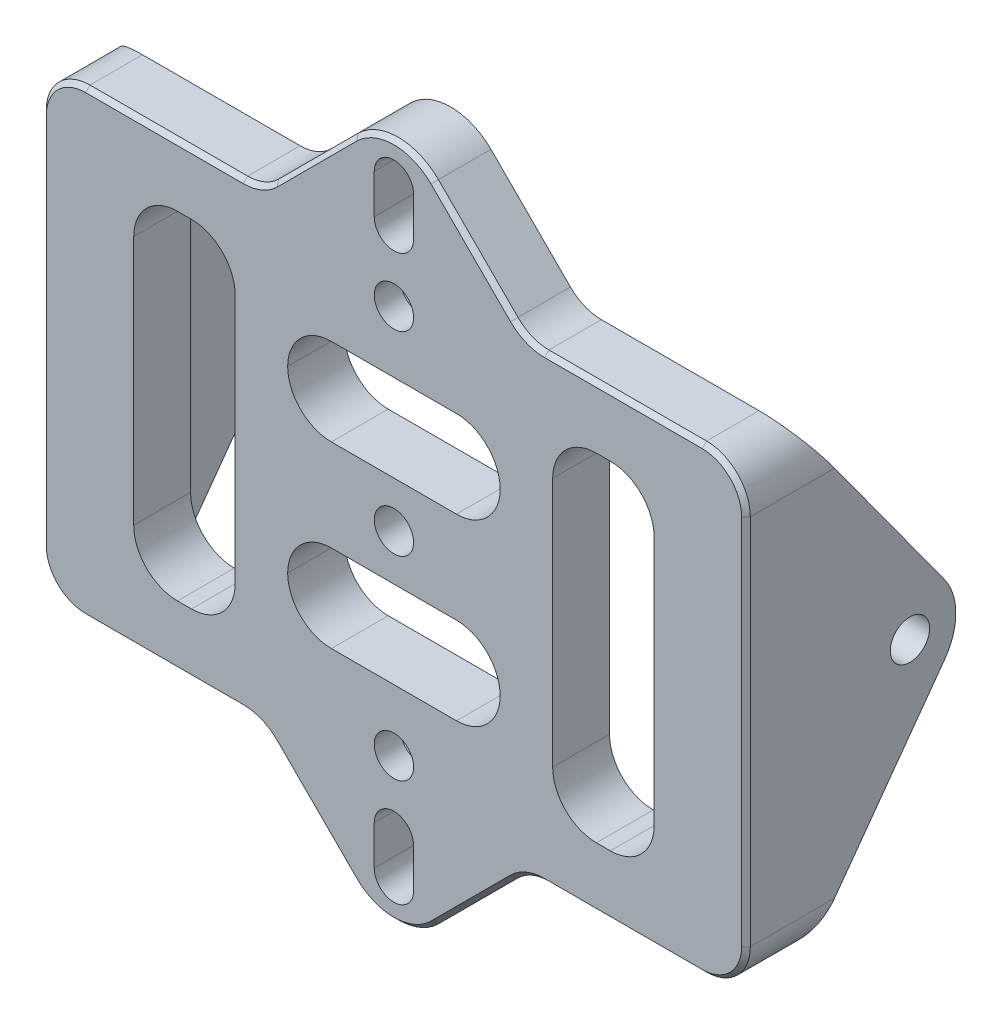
ISO-10303-21;
HEADER;
FILE_DESCRIPTION(('STEP AP214'),'2;1');
FILE_NAME('part.step','',(''),(''),'','','');
FILE_SCHEMA(('AUTOMOTIVE_DESIGN { 1 0 10303 214 1 1 1 1 }'));
ENDSEC;
DATA;
#1=APPLICATION_CONTEXT('core data for automotive mechanical design processes');
#2=APPLICATION_PROTOCOL_DEFINITION('international standard','automotive_design',2000,#1);
#3=PRODUCT_CONTEXT('',#1,'mechanical');
#4=PRODUCT('Part','Part','',(#3));
#5=PRODUCT_RELATED_PRODUCT_CATEGORY('part','',(#4));
#6=PRODUCT_DEFINITION_FORMATION('','',#4);
#7=PRODUCT_DEFINITION_CONTEXT('part definition',#1,'design');
#8=PRODUCT_DEFINITION('design','',#6,#7);
#9=PRODUCT_DEFINITION_SHAPE('','',#8);
#10=(LENGTH_UNIT() NAMED_UNIT(*) SI_UNIT(.MILLI.,.METRE.));
#11=(NAMED_UNIT(*) PLANE_ANGLE_UNIT() SI_UNIT($,.RADIAN.));
#12=(NAMED_UNIT(*) SI_UNIT($,.STERADIAN.) SOLID_ANGLE_UNIT());
#13=UNCERTAINTY_MEASURE_WITH_UNIT(LENGTH_MEASURE(1.E-05),#10,'distance_accuracy_value','');
#14=(GEOMETRIC_REPRESENTATION_CONTEXT(3) GLOBAL_UNCERTAINTY_ASSIGNED_CONTEXT((#13)) GLOBAL_UNIT_ASSIGNED_CONTEXT((#10,
#11,#12)) REPRESENTATION_CONTEXT('',''));
#15=CARTESIAN_POINT('',(0.,0.,0.));
#16=DIRECTION('',(0.,0.,1.));
#17=DIRECTION('',(1.,0.,0.));
#18=AXIS2_PLACEMENT_3D('',#15,#16,#17);
#19=CARTESIAN_POINT('',(-80.5,0.,-7.));
#20=DIRECTION('',(-1.,0.,0.));
#21=DIRECTION('',(0.,0.,1.));
#22=AXIS2_PLACEMENT_3D('',#19,#20,#21);
#23=PLANE('',#22);
#24=CARTESIAN_POINT('',(-80.5,0.,-31.5));
#25=DIRECTION('',(-1.,0.,0.));
#26=DIRECTION('',(0.,0.,1.));
#27=AXIS2_PLACEMENT_3D('',#24,#25,#26);
#28=CIRCLE('',#27,4.5);
#29=CARTESIAN_POINT('',(-80.5,0.,-27.));
#30=VERTEX_POINT('',#29);
#31=EDGE_CURVE('E1173',#30,#30,#28,.T.);
#32=ORIENTED_EDGE('',*,*,#31,.F.);
#33=EDGE_LOOP('',(#32));
#34=FACE_BOUND('',#33,.T.);
#35=DIRECTION('',(0.,0.,1.));
#36=VECTOR('',#35,1.);
#37=CARTESIAN_POINT('',(-80.5,-42.5829037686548,-7.));
#38=LINE('',#37,#36);
#39=CARTESIAN_POINT('',(-80.5,-42.5829037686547,-14.2611166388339));
#40=VERTEX_POINT('',#39);
#41=CARTESIAN_POINT('',(-80.5,-42.5829037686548,4.99999999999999));
#42=VERTEX_POINT('',#41);
#43=EDGE_CURVE('E1054',#40,#42,#38,.T.);
#44=ORIENTED_EDGE('',*,*,#43,.T.);
#45=DIRECTION('',(0.,1.,0.));
#46=VECTOR('',#45,1.);
#47=CARTESIAN_POINT('',(-80.5,0.,4.99999999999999));
#48=LINE('',#47,#46);
#49=CARTESIAN_POINT('',(-80.5,42.5829037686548,4.99999999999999));
#50=VERTEX_POINT('',#49);
#51=EDGE_CURVE('E1226',#42,#50,#48,.T.);
#52=ORIENTED_EDGE('',*,*,#51,.T.);
#53=DIRECTION('',(0.,0.,1.));
#54=VECTOR('',#53,1.);
#55=CARTESIAN_POINT('',(-80.5,42.5829037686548,-7.));
#56=LINE('',#55,#54);
#57=CARTESIAN_POINT('',(-80.5,42.5829037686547,-14.2611166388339));
#58=VERTEX_POINT('',#57);
#59=EDGE_CURVE('E1052',#50,#58,#56,.F.);
#60=ORIENTED_EDGE('',*,*,#59,.T.);
#61=DIRECTION('',(0.,-0.80918275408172,-0.587557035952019));
#62=VECTOR('',#61,1.);
#63=CARTESIAN_POINT('',(-80.5,21.4809291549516,-29.5835065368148));
#64=LINE('',#63,#62);
#65=CARTESIAN_POINT('',(-80.5,7.92594131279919,-39.4259413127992));
#66=VERTEX_POINT('',#65);
#67=EDGE_CURVE('E660',#58,#66,#64,.T.);
#68=ORIENTED_EDGE('',*,*,#67,.T.);
#69=CARTESIAN_POINT('',(-80.5,0.,-28.5103456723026));
#70=DIRECTION('',(-1.,0.,0.));
#71=DIRECTION('',(0.,0.,1.));
#72=AXIS2_PLACEMENT_3D('',#69,#70,#71);
#73=CIRCLE('',#72,13.4896543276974);
#74=CARTESIAN_POINT('',(-80.5,-7.92594131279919,-39.4259413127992));
#75=VERTEX_POINT('',#74);
#76=EDGE_CURVE('E650',#75,#66,#73,.F.);
#77=ORIENTED_EDGE('',*,*,#76,.F.);
#78=DIRECTION('',(0.,0.80918275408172,-0.587557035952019));
#79=VECTOR('',#78,1.);
#80=CARTESIAN_POINT('',(-80.5,-21.4809291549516,-29.5835065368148));
#81=LINE('',#80,#79);
#82=EDGE_CURVE('E648',#40,#75,#81,.T.);
#83=ORIENTED_EDGE('',*,*,#82,.F.);
#84=EDGE_LOOP('',(#44,#52,#60,#68,#77,#83));
#85=FACE_BOUND('',#84,.T.);
#86=ADVANCED_FACE('F89',(#34,#85),#23,.T.);
#87=CARTESIAN_POINT('',(80.5,0.,-7.));
#88=DIRECTION('',(-1.,0.,0.));
#89=DIRECTION('',(0.,0.,1.));
#90=AXIS2_PLACEMENT_3D('',#87,#88,#89);
#91=PLANE('',#90);
#92=CARTESIAN_POINT('',(80.5,0.,-31.5));
#93=DIRECTION('',(-1.,0.,0.));
#94=DIRECTION('',(0.,0.,1.));
#95=AXIS2_PLACEMENT_3D('',#92,#93,#94);
#96=CIRCLE('',#95,4.5);
#97=CARTESIAN_POINT('',(80.5,0.,-27.));
#98=VERTEX_POINT('',#97);
#99=EDGE_CURVE('E970',#98,#98,#96,.F.);
#100=ORIENTED_EDGE('',*,*,#99,.F.);
#101=EDGE_LOOP('',(#100));
#102=FACE_BOUND('',#101,.T.);
#103=DIRECTION('',(0.,0.,1.));
#104=VECTOR('',#103,1.);
#105=CARTESIAN_POINT('',(80.5,42.5829037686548,-7.));
#106=LINE('',#105,#104);
#107=CARTESIAN_POINT('',(80.5,42.5829037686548,-14.2611166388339));
#108=VERTEX_POINT('',#107);
#109=CARTESIAN_POINT('',(80.5,42.5829037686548,4.99999999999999));
#110=VERTEX_POINT('',#109);
#111=EDGE_CURVE('E1073',#108,#110,#106,.T.);
#112=ORIENTED_EDGE('',*,*,#111,.T.);
#113=DIRECTION('',(0.,-1.,0.));
#114=VECTOR('',#113,1.);
#115=CARTESIAN_POINT('',(80.5,-42.5829037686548,4.99999999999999));
#116=LINE('',#115,#114);
#117=CARTESIAN_POINT('',(80.5,-42.5829037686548,4.99999999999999));
#118=VERTEX_POINT('',#117);
#119=EDGE_CURVE('E98',#110,#118,#116,.T.);
#120=ORIENTED_EDGE('',*,*,#119,.T.);
#121=DIRECTION('',(0.,0.,1.));
#122=VECTOR('',#121,1.);
#123=CARTESIAN_POINT('',(80.5,-42.5829037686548,-7.));
#124=LINE('',#123,#122);
#125=CARTESIAN_POINT('',(80.5,-42.5829037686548,-14.2611166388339));
#126=VERTEX_POINT('',#125);
#127=EDGE_CURVE('E647',#118,#126,#124,.F.);
#128=ORIENTED_EDGE('',*,*,#127,.T.);
#129=DIRECTION('',(0.,-0.80918275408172,0.587557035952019));
#130=VECTOR('',#129,1.);
#131=CARTESIAN_POINT('',(80.5,-21.4809291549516,-29.5835065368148));
#132=LINE('',#131,#130);
#133=CARTESIAN_POINT('',(80.5,-7.92594131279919,-39.4259413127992));
#134=VERTEX_POINT('',#133);
#135=EDGE_CURVE('E639',#134,#126,#132,.T.);
#136=ORIENTED_EDGE('',*,*,#135,.F.);
#137=CARTESIAN_POINT('',(80.5,0.,-28.5103456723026));
#138=DIRECTION('',(-1.,0.,0.));
#139=DIRECTION('',(0.,0.,1.));
#140=AXIS2_PLACEMENT_3D('',#137,#138,#139);
#141=CIRCLE('',#140,13.4896543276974);
#142=CARTESIAN_POINT('',(80.5,7.92594131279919,-39.4259413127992));
#143=VERTEX_POINT('',#142);
#144=EDGE_CURVE('E624',#143,#134,#141,.T.);
#145=ORIENTED_EDGE('',*,*,#144,.F.);
#146=DIRECTION('',(0.,0.80918275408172,0.587557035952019));
#147=VECTOR('',#146,1.);
#148=CARTESIAN_POINT('',(80.5,21.4809291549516,-29.5835065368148));
#149=LINE('',#148,#147);
#150=EDGE_CURVE('E633',#143,#108,#149,.T.);
#151=ORIENTED_EDGE('',*,*,#150,.T.);
#152=EDGE_LOOP('',(#112,#120,#128,#136,#145,#151));
#153=FACE_BOUND('',#152,.T.);
#154=ADVANCED_FACE('F646',(#102,#153),#91,.F.);
#155=CARTESIAN_POINT('',(66.5,52.5829037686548,-42.));
#156=DIRECTION('',(1.,0.,0.));
#157=DIRECTION('',(0.,1.,0.));
#158=AXIS2_PLACEMENT_3D('',#155,#156,#157);
#159=PLANE('',#158);
#160=CARTESIAN_POINT('',(66.5,0.,-31.5));
#161=DIRECTION('',(1.,0.,0.));
#162=DIRECTION('',(0.,1.,0.));
#163=AXIS2_PLACEMENT_3D('',#160,#161,#162);
#164=CIRCLE('',#163,4.5);
#165=CARTESIAN_POINT('',(66.5,4.5,-31.5));
#166=VERTEX_POINT('',#165);
#167=EDGE_CURVE('E969',#166,#166,#164,.T.);
#168=ORIENTED_EDGE('',*,*,#167,.T.);
#169=EDGE_LOOP('',(#168));
#170=FACE_BOUND('',#169,.T.);
#171=DIRECTION('',(0.,-0.80918275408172,0.587557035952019));
#172=VECTOR('',#171,1.);
#173=CARTESIAN_POINT('',(66.5,32.9176554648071,-69.082953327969));
#174=LINE('',#173,#172);
#175=CARTESIAN_POINT('',(66.5,-7.92594131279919,-39.4259413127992));
#176=VERTEX_POINT('',#175);
#177=CARTESIAN_POINT('',(66.5,-51.2057051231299,-8.));
#178=VERTEX_POINT('',#177);
#179=EDGE_CURVE('E642',#176,#178,#174,.T.);
#180=ORIENTED_EDGE('',*,*,#179,.T.);
#181=DIRECTION('',(0.,1.,0.));
#182=VECTOR('',#181,1.);
#183=CARTESIAN_POINT('',(66.5,52.5829037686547,-8.));
#184=LINE('',#183,#182);
#185=CARTESIAN_POINT('',(66.5,51.2057051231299,-8.));
#186=VERTEX_POINT('',#185);
#187=EDGE_CURVE('E979',#178,#186,#184,.T.);
#188=ORIENTED_EDGE('',*,*,#187,.T.);
#189=DIRECTION('',(0.,0.80918275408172,0.587557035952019));
#190=VECTOR('',#189,1.);
#191=CARTESIAN_POINT('',(66.5,35.9424680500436,-19.0828144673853));
#192=LINE('',#191,#190);
#193=CARTESIAN_POINT('',(66.5,7.92594131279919,-39.4259413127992));
#194=VERTEX_POINT('',#193);
#195=EDGE_CURVE('E671',#194,#186,#192,.T.);
#196=ORIENTED_EDGE('',*,*,#195,.F.);
#197=CARTESIAN_POINT('',(66.5,0.,-28.5103456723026));
#198=DIRECTION('',(1.,0.,0.));
#199=DIRECTION('',(0.,1.,0.));
#200=AXIS2_PLACEMENT_3D('',#197,#198,#199);
#201=CIRCLE('',#200,13.4896543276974);
#202=EDGE_CURVE('E669',#194,#176,#201,.F.);
#203=ORIENTED_EDGE('',*,*,#202,.T.);
#204=EDGE_LOOP('',(#180,#188,#196,#203));
#205=FACE_BOUND('',#204,.T.);
#206=ADVANCED_FACE('F1411',(#170,#205),#159,.F.);
#207=CARTESIAN_POINT('',(-66.5,52.5829037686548,-42.));
#208=DIRECTION('',(-1.,0.,0.));
#209=DIRECTION('',(0.,-1.,0.));
#210=AXIS2_PLACEMENT_3D('',#207,#208,#209);
#211=PLANE('',#210);
#212=CARTESIAN_POINT('',(-66.5,0.,-31.5));
#213=DIRECTION('',(-1.,0.,0.));
#214=DIRECTION('',(0.,-1.,0.));
#215=AXIS2_PLACEMENT_3D('',#212,#213,#214);
#216=CIRCLE('',#215,4.5);
#217=CARTESIAN_POINT('',(-66.5,-4.5,-31.5));
#218=VERTEX_POINT('',#217);
#219=EDGE_CURVE('E966',#218,#218,#216,.T.);
#220=ORIENTED_EDGE('',*,*,#219,.T.);
#221=EDGE_LOOP('',(#220));
#222=FACE_BOUND('',#221,.T.);
#223=DIRECTION('',(0.,-0.80918275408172,-0.587557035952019));
#224=VECTOR('',#223,1.);
#225=CARTESIAN_POINT('',(-66.5,35.9424680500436,-19.0828144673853));
#226=LINE('',#225,#224);
#227=CARTESIAN_POINT('',(-66.5,51.2057051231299,-8.));
#228=VERTEX_POINT('',#227);
#229=CARTESIAN_POINT('',(-66.5,7.92594131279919,-39.4259413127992));
#230=VERTEX_POINT('',#229);
#231=EDGE_CURVE('E905',#228,#230,#226,.T.);
#232=ORIENTED_EDGE('',*,*,#231,.F.);
#233=DIRECTION('',(0.,-1.,0.));
#234=VECTOR('',#233,1.);
#235=CARTESIAN_POINT('',(-66.5,-52.5829037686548,-8.));
#236=LINE('',#235,#234);
#237=CARTESIAN_POINT('',(-66.5,-51.2057051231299,-8.));
#238=VERTEX_POINT('',#237);
#239=EDGE_CURVE('E965',#228,#238,#236,.T.);
#240=ORIENTED_EDGE('',*,*,#239,.T.);
#241=DIRECTION('',(0.,0.80918275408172,-0.587557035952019));
#242=VECTOR('',#241,1.);
#243=CARTESIAN_POINT('',(-66.5,32.9176554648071,-69.082953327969));
#244=LINE('',#243,#242);
#245=CARTESIAN_POINT('',(-66.5,-7.92594131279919,-39.4259413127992));
#246=VERTEX_POINT('',#245);
#247=EDGE_CURVE('E963',#238,#246,#244,.T.);
#248=ORIENTED_EDGE('',*,*,#247,.T.);
#249=CARTESIAN_POINT('',(-66.5,0.,-28.5103456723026));
#250=DIRECTION('',(-1.,0.,0.));
#251=DIRECTION('',(0.,-1.,0.));
#252=AXIS2_PLACEMENT_3D('',#249,#250,#251);
#253=CIRCLE('',#252,13.4896543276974);
#254=EDGE_CURVE('E632',#246,#230,#253,.F.);
#255=ORIENTED_EDGE('',*,*,#254,.T.);
#256=EDGE_LOOP('',(#232,#240,#248,#255));
#257=FACE_BOUND('',#256,.T.);
#258=ADVANCED_FACE('F1421',(#222,#257),#211,.F.);
#259=CARTESIAN_POINT('',(0.,52.5829037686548,-7.));
#260=DIRECTION('',(0.,-1.,0.));
#261=DIRECTION('',(0.,0.,-1.));
#262=AXIS2_PLACEMENT_3D('',#259,#260,#261);
#263=PLANE('',#262);
#264=DIRECTION('',(0.,0.,1.));
#265=VECTOR('',#264,1.);
#266=CARTESIAN_POINT('',(-70.5,52.5829037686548,6.));
#267=LINE('',#266,#265);
#268=CARTESIAN_POINT('',(-70.5,52.5829037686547,-7.));
#269=VERTEX_POINT('',#268);
#270=CARTESIAN_POINT('',(-70.5,52.5829037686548,4.99999999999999));
#271=VERTEX_POINT('',#270);
#272=EDGE_CURVE('E1080',#269,#271,#267,.T.);
#273=ORIENTED_EDGE('',*,*,#272,.T.);
#274=DIRECTION('',(1.,0.,0.));
#275=VECTOR('',#274,1.);
#276=CARTESIAN_POINT('',(-34.4440081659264,52.5829037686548,4.99999999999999));
#277=LINE('',#276,#275);
#278=CARTESIAN_POINT('',(-34.4440081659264,52.5829037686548,4.99999999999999));
#279=VERTEX_POINT('',#278);
#280=EDGE_CURVE('E1228',#271,#279,#277,.T.);
#281=ORIENTED_EDGE('',*,*,#280,.T.);
#282=DIRECTION('',(0.,0.,1.));
#283=VECTOR('',#282,1.);
#284=CARTESIAN_POINT('',(-34.4440081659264,52.5829037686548,-7.));
#285=LINE('',#284,#283);
#286=CARTESIAN_POINT('',(-34.4440081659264,52.5829037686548,-7.));
#287=VERTEX_POINT('',#286);
#288=EDGE_CURVE('E1078',#279,#287,#285,.F.);
#289=ORIENTED_EDGE('',*,*,#288,.T.);
#290=DIRECTION('',(1.,0.,0.));
#291=VECTOR('',#290,1.);
#292=CARTESIAN_POINT('',(0.,52.5829037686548,-7.));
#293=LINE('',#292,#291);
#294=CARTESIAN_POINT('',(-65.5,52.5829037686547,-7.));
#295=VERTEX_POINT('',#294);
#296=EDGE_CURVE('E852',#295,#287,#293,.T.);
#297=ORIENTED_EDGE('',*,*,#296,.F.);
#298=DIRECTION('',(-1.,0.,0.));
#299=VECTOR('',#298,1.);
#300=CARTESIAN_POINT('',(143.666144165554,52.5829037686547,-7.));
#301=LINE('',#300,#299);
#302=EDGE_CURVE('E665',#295,#269,#301,.T.);
#303=ORIENTED_EDGE('',*,*,#302,.T.);
#304=EDGE_LOOP('',(#273,#281,#289,#297,#303));
#305=FACE_BOUND('',#304,.T.);
#306=ADVANCED_FACE('F1417',(#305),#263,.F.);
#307=CARTESIAN_POINT('',(0.,52.5829037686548,-7.));
#308=DIRECTION('',(0.,-1.,0.));
#309=DIRECTION('',(0.,0.,-1.));
#310=AXIS2_PLACEMENT_3D('',#307,#308,#309);
#311=PLANE('',#310);
#312=DIRECTION('',(0.,0.,1.));
#313=VECTOR('',#312,1.);
#314=CARTESIAN_POINT('',(34.4440081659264,52.5829037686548,-7.));
#315=LINE('',#314,#313);
#316=CARTESIAN_POINT('',(34.4440081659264,52.5829037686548,-7.));
#317=VERTEX_POINT('',#316);
#318=CARTESIAN_POINT('',(34.4440081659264,52.5829037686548,4.99999999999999));
#319=VERTEX_POINT('',#318);
#320=EDGE_CURVE('E1088',#317,#319,#315,.T.);
#321=ORIENTED_EDGE('',*,*,#320,.T.);
#322=DIRECTION('',(1.,0.,0.));
#323=VECTOR('',#322,1.);
#324=CARTESIAN_POINT('',(70.5,52.5829037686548,4.99999999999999));
#325=LINE('',#324,#323);
#326=CARTESIAN_POINT('',(70.5,52.5829037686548,4.99999999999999));
#327=VERTEX_POINT('',#326);
#328=EDGE_CURVE('E1252',#319,#327,#325,.T.);
#329=ORIENTED_EDGE('',*,*,#328,.T.);
#330=DIRECTION('',(0.,0.,1.));
#331=VECTOR('',#330,1.);
#332=CARTESIAN_POINT('',(70.5,52.5829037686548,-7.));
#333=LINE('',#332,#331);
#334=CARTESIAN_POINT('',(70.5,52.5829037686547,-7.));
#335=VERTEX_POINT('',#334);
#336=EDGE_CURVE('E1091',#327,#335,#333,.F.);
#337=ORIENTED_EDGE('',*,*,#336,.T.);
#338=CARTESIAN_POINT('',(65.5,52.5829037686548,-7.));
#339=VERTEX_POINT('',#338);
#340=EDGE_CURVE('E657',#335,#339,#301,.T.);
#341=ORIENTED_EDGE('',*,*,#340,.T.);
#342=DIRECTION('',(1.,0.,0.));
#343=VECTOR('',#342,1.);
#344=CARTESIAN_POINT('',(0.,52.5829037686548,-7.));
#345=LINE('',#344,#343);
#346=EDGE_CURVE('E842',#317,#339,#345,.T.);
#347=ORIENTED_EDGE('',*,*,#346,.F.);
#348=EDGE_LOOP('',(#321,#329,#337,#341,#347));
#349=FACE_BOUND('',#348,.T.);
#350=ADVANCED_FACE('F1420',(#349),#311,.F.);
#351=CARTESIAN_POINT('',(0.,0.,-7.));
#352=DIRECTION('',(0.,0.,1.));
#353=DIRECTION('',(1.,0.,0.));
#354=AXIS2_PLACEMENT_3D('',#351,#352,#353);
#355=PLANE('',#354);
#356=DIRECTION('',(-0.866025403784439,0.5,0.));
#357=VECTOR('',#356,1.);
#358=CARTESIAN_POINT('',(-22.7690652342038,-39.4371778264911,-7.));
#359=LINE('',#358,#357);
#360=CARTESIAN_POINT('',(0.,-52.5829037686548,-7.));
#361=VERTEX_POINT('',#360);
#362=CARTESIAN_POINT('',(-7.00000000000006,-48.5414518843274,-7.));
#363=VERTEX_POINT('',#362);
#364=EDGE_CURVE('E789',#361,#363,#359,.T.);
#365=ORIENTED_EDGE('',*,*,#364,.F.);
#366=DIRECTION('',(-0.866025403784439,-0.5,0.));
#367=VECTOR('',#366,1.);
#368=CARTESIAN_POINT('',(22.7690652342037,-39.437177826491,-7.));
#369=LINE('',#368,#367);
#370=CARTESIAN_POINT('',(6.99999999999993,-48.5414518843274,-7.));
#371=VERTEX_POINT('',#370);
#372=EDGE_CURVE('E786',#371,#361,#369,.T.);
#373=ORIENTED_EDGE('',*,*,#372,.F.);
#374=DIRECTION('',(0.,-1.,0.));
#375=VECTOR('',#374,1.);
#376=CARTESIAN_POINT('',(6.99999999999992,0.,-7.));
#377=LINE('',#376,#375);
#378=CARTESIAN_POINT('',(6.99999999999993,-40.4585481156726,-7.));
#379=VERTEX_POINT('',#378);
#380=EDGE_CURVE('E801',#379,#371,#377,.T.);
#381=ORIENTED_EDGE('',*,*,#380,.F.);
#382=DIRECTION('',(0.866025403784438,-0.500000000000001,0.));
#383=VECTOR('',#382,1.);
#384=CARTESIAN_POINT('',(-15.7690652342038,-27.3128221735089,-7.));
#385=LINE('',#384,#383);
#386=CARTESIAN_POINT('',(0.,-36.4170962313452,-7.));
#387=VERTEX_POINT('',#386);
#388=EDGE_CURVE('E798',#387,#379,#385,.T.);
#389=ORIENTED_EDGE('',*,*,#388,.F.);
#390=DIRECTION('',(0.866025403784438,0.5,0.));
#391=VECTOR('',#390,1.);
#392=CARTESIAN_POINT('',(15.7690652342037,-27.3128221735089,-7.));
#393=LINE('',#392,#391);
#394=CARTESIAN_POINT('',(-7.00000000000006,-40.4585481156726,-7.));
#395=VERTEX_POINT('',#394);
#396=EDGE_CURVE('E795',#395,#387,#393,.T.);
#397=ORIENTED_EDGE('',*,*,#396,.F.);
#398=DIRECTION('',(0.,1.,0.));
#399=VECTOR('',#398,1.);
#400=CARTESIAN_POINT('',(-7.00000000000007,0.,-7.));
#401=LINE('',#400,#399);
#402=EDGE_CURVE('E792',#363,#395,#401,.T.);
#403=ORIENTED_EDGE('',*,*,#402,.F.);
#404=EDGE_LOOP('',(#365,#373,#381,#389,#397,#403));
#405=FACE_BOUND('',#404,.T.);
#406=DIRECTION('',(0.,-1.,0.));
#407=VECTOR('',#406,1.);
#408=CARTESIAN_POINT('',(-4.50000000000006,0.,-7.));
#409=LINE('',#408,#407);
#410=CARTESIAN_POINT('',(-4.50000000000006,-60.,-7.));
#411=VERTEX_POINT('',#410);
#412=CARTESIAN_POINT('',(-4.50000000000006,-69.,-7.));
#413=VERTEX_POINT('',#412);
#414=EDGE_CURVE('E858',#411,#413,#409,.T.);
#415=ORIENTED_EDGE('',*,*,#414,.T.);
#416=CARTESIAN_POINT('',(0.,-69.,-7.));
#417=DIRECTION('',(0.,0.,1.));
#418=DIRECTION('',(1.,0.,0.));
#419=AXIS2_PLACEMENT_3D('',#416,#417,#418);
#420=CIRCLE('',#419,4.5);
#421=CARTESIAN_POINT('',(4.49999999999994,-69.,-7.));
#422=VERTEX_POINT('',#421);
#423=EDGE_CURVE('E866',#413,#422,#420,.T.);
#424=ORIENTED_EDGE('',*,*,#423,.T.);
#425=DIRECTION('',(0.,1.,0.));
#426=VECTOR('',#425,1.);
#427=CARTESIAN_POINT('',(4.49999999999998,0.,-7.));
#428=LINE('',#427,#426);
#429=CARTESIAN_POINT('',(4.49999999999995,-60.,-7.));
#430=VERTEX_POINT('',#429);
#431=EDGE_CURVE('E864',#422,#430,#428,.T.);
#432=ORIENTED_EDGE('',*,*,#431,.T.);
#433=CARTESIAN_POINT('',(0.,-60.,-7.));
#434=DIRECTION('',(0.,0.,1.));
#435=DIRECTION('',(1.,0.,0.));
#436=AXIS2_PLACEMENT_3D('',#433,#434,#435);
#437=CIRCLE('',#436,4.5);
#438=EDGE_CURVE('E861',#411,#430,#437,.F.);
#439=ORIENTED_EDGE('',*,*,#438,.F.);
#440=EDGE_LOOP('',(#415,#424,#432,#439));
#441=FACE_BOUND('',#440,.T.);
#442=DIRECTION('',(1.,0.,0.));
#443=VECTOR('',#442,1.);
#444=CARTESIAN_POINT('',(0.,-52.5829037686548,-7.));
#445=LINE('',#444,#443);
#446=CARTESIAN_POINT('',(-65.5,-52.5829037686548,-7.));
#447=VERTEX_POINT('',#446);
#448=CARTESIAN_POINT('',(-34.4440081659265,-52.5829037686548,-7.));
#449=VERTEX_POINT('',#448);
#450=EDGE_CURVE('E855',#447,#449,#445,.T.);
#451=ORIENTED_EDGE('',*,*,#450,.F.);
#452=DIRECTION('',(0.,-1.,0.));
#453=VECTOR('',#452,1.);
#454=CARTESIAN_POINT('',(-65.5,52.5829037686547,-7.));
#455=LINE('',#454,#453);
#456=EDGE_CURVE('E976',#447,#295,#455,.F.);
#457=ORIENTED_EDGE('',*,*,#456,.T.);
#458=ORIENTED_EDGE('',*,*,#296,.T.);
#459=CARTESIAN_POINT('',(-34.4440081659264,62.5829037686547,-7.));
#460=DIRECTION('',(0.,0.,1.));
#461=DIRECTION('',(1.,0.,0.));
#462=AXIS2_PLACEMENT_3D('',#459,#460,#461);
#463=CIRCLE('',#462,10.);
#464=CARTESIAN_POINT('',(-27.372940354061,55.5118359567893,-7.));
#465=VERTEX_POINT('',#464);
#466=EDGE_CURVE('E1165',#287,#465,#463,.T.);
#467=ORIENTED_EDGE('',*,*,#466,.T.);
#468=DIRECTION('',(-0.707106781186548,-0.707106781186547,0.));
#469=VECTOR('',#468,1.);
#470=CARTESIAN_POINT('',(-41.4423881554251,41.4423881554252,-7.));
#471=LINE('',#470,#469);
#472=CARTESIAN_POINT('',(-9.19238815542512,73.6923881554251,-7.));
#473=VERTEX_POINT('',#472);
#474=EDGE_CURVE('E849',#473,#465,#471,.T.);
#475=ORIENTED_EDGE('',*,*,#474,.F.);
#476=CARTESIAN_POINT('',(0.,64.5,-7.));
#477=DIRECTION('',(0.,0.,1.));
#478=DIRECTION('',(1.,0.,0.));
#479=AXIS2_PLACEMENT_3D('',#476,#477,#478);
#480=CIRCLE('',#479,13.);
#481=CARTESIAN_POINT('',(9.19238815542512,73.6923881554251,-7.));
#482=VERTEX_POINT('',#481);
#483=EDGE_CURVE('E846',#473,#482,#480,.F.);
#484=ORIENTED_EDGE('',*,*,#483,.T.);
#485=DIRECTION('',(-0.707106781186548,0.707106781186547,0.));
#486=VECTOR('',#485,1.);
#487=CARTESIAN_POINT('',(41.4423881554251,41.4423881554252,-7.));
#488=LINE('',#487,#486);
#489=CARTESIAN_POINT('',(27.372940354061,55.5118359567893,-7.));
#490=VERTEX_POINT('',#489);
#491=EDGE_CURVE('E844',#490,#482,#488,.T.);
#492=ORIENTED_EDGE('',*,*,#491,.F.);
#493=CARTESIAN_POINT('',(34.4440081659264,62.5829037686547,-7.));
#494=DIRECTION('',(0.,0.,1.));
#495=DIRECTION('',(1.,0.,0.));
#496=AXIS2_PLACEMENT_3D('',#493,#494,#495);
#497=CIRCLE('',#496,10.);
#498=EDGE_CURVE('E1167',#490,#317,#497,.T.);
#499=ORIENTED_EDGE('',*,*,#498,.T.);
#500=ORIENTED_EDGE('',*,*,#346,.T.);
#501=DIRECTION('',(0.,1.,0.));
#502=VECTOR('',#501,1.);
#503=CARTESIAN_POINT('',(65.5,-52.5829037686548,-7.));
#504=LINE('',#503,#502);
#505=CARTESIAN_POINT('',(65.5,-52.5829037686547,-7.));
#506=VERTEX_POINT('',#505);
#507=EDGE_CURVE('E973',#339,#506,#504,.F.);
#508=ORIENTED_EDGE('',*,*,#507,.T.);
#509=DIRECTION('',(1.,0.,0.));
#510=VECTOR('',#509,1.);
#511=CARTESIAN_POINT('',(0.,-52.5829037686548,-7.));
#512=LINE('',#511,#510);
#513=CARTESIAN_POINT('',(34.4440081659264,-52.5829037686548,-7.));
#514=VERTEX_POINT('',#513);
#515=EDGE_CURVE('E840',#514,#506,#512,.T.);
#516=ORIENTED_EDGE('',*,*,#515,.F.);
#517=CARTESIAN_POINT('',(34.4440081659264,-62.5829037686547,-7.));
#518=DIRECTION('',(0.,0.,1.));
#519=DIRECTION('',(1.,0.,0.));
#520=AXIS2_PLACEMENT_3D('',#517,#518,#519);
#521=CIRCLE('',#520,10.);
#522=CARTESIAN_POINT('',(27.3729403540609,-55.5118359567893,-7.));
#523=VERTEX_POINT('',#522);
#524=EDGE_CURVE('E1163',#514,#523,#521,.T.);
#525=ORIENTED_EDGE('',*,*,#524,.T.);
#526=DIRECTION('',(-0.707106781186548,-0.707106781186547,0.));
#527=VECTOR('',#526,1.);
#528=CARTESIAN_POINT('',(41.4423881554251,-41.4423881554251,-7.));
#529=LINE('',#528,#527);
#530=CARTESIAN_POINT('',(9.19238815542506,-73.6923881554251,-7.));
#531=VERTEX_POINT('',#530);
#532=EDGE_CURVE('E838',#523,#531,#529,.T.);
#533=ORIENTED_EDGE('',*,*,#532,.T.);
#534=CARTESIAN_POINT('',(0.,-64.5,-7.));
#535=DIRECTION('',(0.,0.,1.));
#536=DIRECTION('',(1.,0.,0.));
#537=AXIS2_PLACEMENT_3D('',#534,#535,#536);
#538=CIRCLE('',#537,13.);
#539=CARTESIAN_POINT('',(-9.19238815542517,-73.6923881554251,-7.));
#540=VERTEX_POINT('',#539);
#541=EDGE_CURVE('E835',#540,#531,#538,.T.);
#542=ORIENTED_EDGE('',*,*,#541,.F.);
#543=DIRECTION('',(-0.707106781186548,0.707106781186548,0.));
#544=VECTOR('',#543,1.);
#545=CARTESIAN_POINT('',(-41.4423881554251,-41.4423881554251,-7.));
#546=LINE('',#545,#544);
#547=CARTESIAN_POINT('',(-27.372940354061,-55.5118359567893,-7.));
#548=VERTEX_POINT('',#547);
#549=EDGE_CURVE('E832',#540,#548,#546,.T.);
#550=ORIENTED_EDGE('',*,*,#549,.T.);
#551=CARTESIAN_POINT('',(-34.4440081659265,-62.5829037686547,-7.));
#552=DIRECTION('',(0.,0.,1.));
#553=DIRECTION('',(1.,0.,0.));
#554=AXIS2_PLACEMENT_3D('',#551,#552,#553);
#555=CIRCLE('',#554,10.);
#556=EDGE_CURVE('E1161',#548,#449,#555,.T.);
#557=ORIENTED_EDGE('',*,*,#556,.T.);
#558=EDGE_LOOP('',(#451,#457,#458,#467,#475,#484,#492,#499,#500,#508,#516,#525,#533,#542,#550,#557));
#559=FACE_BOUND('',#558,.T.);
#560=DIRECTION('',(1.,0.,0.));
#561=VECTOR('',#560,1.);
#562=CARTESIAN_POINT('',(0.,38.5829037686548,-7.));
#563=LINE('',#562,#561);
#564=CARTESIAN_POINT('',(46.3018725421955,38.5829037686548,-7.));
#565=VERTEX_POINT('',#564);
#566=CARTESIAN_POINT('',(49.5,38.5829037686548,-7.));
#567=VERTEX_POINT('',#566);
#568=EDGE_CURVE('E762',#565,#567,#563,.T.);
#569=ORIENTED_EDGE('',*,*,#568,.F.);
#570=CARTESIAN_POINT('',(46.3018725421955,28.5829037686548,-7.));
#571=DIRECTION('',(0.,0.,1.));
#572=DIRECTION('',(1.,0.,0.));
#573=AXIS2_PLACEMENT_3D('',#570,#571,#572);
#574=CIRCLE('',#573,10.);
#575=CARTESIAN_POINT('',(36.3018725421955,28.5829037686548,-7.));
#576=VERTEX_POINT('',#575);
#577=EDGE_CURVE('E1155',#565,#576,#574,.T.);
#578=ORIENTED_EDGE('',*,*,#577,.T.);
#579=DIRECTION('',(0.,-1.,0.));
#580=VECTOR('',#579,1.);
#581=CARTESIAN_POINT('',(36.3018725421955,0.,-7.));
#582=LINE('',#581,#580);
#583=CARTESIAN_POINT('',(36.3018725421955,-28.5829037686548,-7.));
#584=VERTEX_POINT('',#583);
#585=EDGE_CURVE('E771',#576,#584,#582,.T.);
#586=ORIENTED_EDGE('',*,*,#585,.T.);
#587=CARTESIAN_POINT('',(46.3018725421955,-28.5829037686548,-7.));
#588=DIRECTION('',(0.,0.,1.));
#589=DIRECTION('',(1.,0.,0.));
#590=AXIS2_PLACEMENT_3D('',#587,#588,#589);
#591=CIRCLE('',#590,10.);
#592=CARTESIAN_POINT('',(46.3018725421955,-38.5829037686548,-7.));
#593=VERTEX_POINT('',#592);
#594=EDGE_CURVE('E1151',#584,#593,#591,.T.);
#595=ORIENTED_EDGE('',*,*,#594,.T.);
#596=DIRECTION('',(1.,0.,0.));
#597=VECTOR('',#596,1.);
#598=CARTESIAN_POINT('',(0.,-38.5829037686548,-7.));
#599=LINE('',#598,#597);
#600=CARTESIAN_POINT('',(49.5,-38.5829037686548,-7.));
#601=VERTEX_POINT('',#600);
#602=EDGE_CURVE('E768',#593,#601,#599,.T.);
#603=ORIENTED_EDGE('',*,*,#602,.T.);
#604=CARTESIAN_POINT('',(49.5,-28.5829037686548,-7.));
#605=DIRECTION('',(0.,0.,1.));
#606=DIRECTION('',(1.,0.,0.));
#607=AXIS2_PLACEMENT_3D('',#604,#605,#606);
#608=CIRCLE('',#607,10.);
#609=CARTESIAN_POINT('',(59.5,-28.5829037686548,-7.));
#610=VERTEX_POINT('',#609);
#611=EDGE_CURVE('E1147',#601,#610,#608,.T.);
#612=ORIENTED_EDGE('',*,*,#611,.T.);
#613=DIRECTION('',(0.,-1.,0.));
#614=VECTOR('',#613,1.);
#615=CARTESIAN_POINT('',(59.5,0.,-7.));
#616=LINE('',#615,#614);
#617=CARTESIAN_POINT('',(59.5,28.5829037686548,-7.));
#618=VERTEX_POINT('',#617);
#619=EDGE_CURVE('E765',#618,#610,#616,.T.);
#620=ORIENTED_EDGE('',*,*,#619,.F.);
#621=CARTESIAN_POINT('',(49.5,28.5829037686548,-7.));
#622=DIRECTION('',(0.,0.,1.));
#623=DIRECTION('',(1.,0.,0.));
#624=AXIS2_PLACEMENT_3D('',#621,#622,#623);
#625=CIRCLE('',#624,10.);
#626=EDGE_CURVE('E1159',#618,#567,#625,.T.);
#627=ORIENTED_EDGE('',*,*,#626,.T.);
#628=EDGE_LOOP('',(#569,#578,#586,#595,#603,#612,#620,#627));
#629=FACE_BOUND('',#628,.T.);
#630=DIRECTION('',(1.,0.,0.));
#631=VECTOR('',#630,1.);
#632=CARTESIAN_POINT('',(0.,-10.5,-7.));
#633=LINE('',#632,#631);
#634=CARTESIAN_POINT('',(-14.3018725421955,-10.5,-7.));
#635=VERTEX_POINT('',#634);
#636=CARTESIAN_POINT('',(14.3018725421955,-10.5,-7.));
#637=VERTEX_POINT('',#636);
#638=EDGE_CURVE('E774',#635,#637,#633,.T.);
#639=ORIENTED_EDGE('',*,*,#638,.F.);
#640=CARTESIAN_POINT('',(-14.3018725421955,-20.5,-7.));
#641=DIRECTION('',(0.,0.,1.));
#642=DIRECTION('',(1.,0.,0.));
#643=AXIS2_PLACEMENT_3D('',#640,#641,#642);
#644=CIRCLE('',#643,10.);
#645=CARTESIAN_POINT('',(-24.3017866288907,-20.4585481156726,-7.));
#646=VERTEX_POINT('',#645);
#647=EDGE_CURVE('E1123',#635,#646,#644,.T.);
#648=ORIENTED_EDGE('',*,*,#647,.T.);
#649=CARTESIAN_POINT('',(-14.3018725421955,-20.4170962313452,-7.));
#650=DIRECTION('',(0.,0.,1.));
#651=DIRECTION('',(1.,0.,0.));
#652=AXIS2_PLACEMENT_3D('',#649,#650,#651);
#653=CIRCLE('',#652,10.);
#654=CARTESIAN_POINT('',(-14.3018725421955,-30.4170962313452,-7.));
#655=VERTEX_POINT('',#654);
#656=EDGE_CURVE('E1119',#646,#655,#653,.T.);
#657=ORIENTED_EDGE('',*,*,#656,.T.);
#658=DIRECTION('',(1.,0.,0.));
#659=VECTOR('',#658,1.);
#660=CARTESIAN_POINT('',(0.,-30.4170962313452,-7.));
#661=LINE('',#660,#659);
#662=CARTESIAN_POINT('',(14.3018725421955,-30.4170962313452,-7.));
#663=VERTEX_POINT('',#662);
#664=EDGE_CURVE('E777',#655,#663,#661,.T.);
#665=ORIENTED_EDGE('',*,*,#664,.T.);
#666=CARTESIAN_POINT('',(14.3018725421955,-20.4170962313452,-7.));
#667=DIRECTION('',(0.,0.,1.));
#668=DIRECTION('',(1.,0.,0.));
#669=AXIS2_PLACEMENT_3D('',#666,#667,#668);
#670=CIRCLE('',#669,10.);
#671=CARTESIAN_POINT('',(24.3017866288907,-20.4585481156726,-7.));
#672=VERTEX_POINT('',#671);
#673=EDGE_CURVE('E1115',#663,#672,#670,.T.);
#674=ORIENTED_EDGE('',*,*,#673,.T.);
#675=CARTESIAN_POINT('',(14.3018725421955,-20.5,-7.));
#676=DIRECTION('',(0.,0.,1.));
#677=DIRECTION('',(1.,0.,0.));
#678=AXIS2_PLACEMENT_3D('',#675,#676,#677);
#679=CIRCLE('',#678,10.);
#680=EDGE_CURVE('E1127',#672,#637,#679,.T.);
#681=ORIENTED_EDGE('',*,*,#680,.T.);
#682=EDGE_LOOP('',(#639,#648,#657,#665,#674,#681));
#683=FACE_BOUND('',#682,.T.);
#684=DIRECTION('',(1.,0.,0.));
#685=VECTOR('',#684,1.);
#686=CARTESIAN_POINT('',(0.,30.4170962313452,-7.));
#687=LINE('',#686,#685);
#688=CARTESIAN_POINT('',(-14.3018725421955,30.4170962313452,-7.));
#689=VERTEX_POINT('',#688);
#690=CARTESIAN_POINT('',(14.3018725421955,30.4170962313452,-7.));
#691=VERTEX_POINT('',#690);
#692=EDGE_CURVE('E780',#689,#691,#687,.T.);
#693=ORIENTED_EDGE('',*,*,#692,.F.);
#694=CARTESIAN_POINT('',(-14.3018725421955,20.4170962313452,-7.));
#695=DIRECTION('',(0.,0.,1.));
#696=DIRECTION('',(1.,0.,0.));
#697=AXIS2_PLACEMENT_3D('',#694,#695,#696);
#698=CIRCLE('',#697,10.);
#699=CARTESIAN_POINT('',(-24.3017866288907,20.4585481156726,-7.));
#700=VERTEX_POINT('',#699);
#701=EDGE_CURVE('E1139',#689,#700,#698,.T.);
#702=ORIENTED_EDGE('',*,*,#701,.T.);
#703=CARTESIAN_POINT('',(-14.3018725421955,20.5,-7.));
#704=DIRECTION('',(0.,0.,1.));
#705=DIRECTION('',(1.,0.,0.));
#706=AXIS2_PLACEMENT_3D('',#703,#704,#705);
#707=CIRCLE('',#706,10.);
#708=CARTESIAN_POINT('',(-14.3018725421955,10.5,-7.));
#709=VERTEX_POINT('',#708);
#710=EDGE_CURVE('E1135',#700,#709,#707,.T.);
#711=ORIENTED_EDGE('',*,*,#710,.T.);
#712=DIRECTION('',(1.,0.,0.));
#713=VECTOR('',#712,1.);
#714=CARTESIAN_POINT('',(0.,10.5,-7.));
#715=LINE('',#714,#713);
#716=CARTESIAN_POINT('',(14.3018725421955,10.5,-7.));
#717=VERTEX_POINT('',#716);
#718=EDGE_CURVE('E783',#709,#717,#715,.T.);
#719=ORIENTED_EDGE('',*,*,#718,.T.);
#720=CARTESIAN_POINT('',(14.3018725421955,20.5,-7.));
#721=DIRECTION('',(0.,0.,1.));
#722=DIRECTION('',(1.,0.,0.));
#723=AXIS2_PLACEMENT_3D('',#720,#721,#722);
#724=CIRCLE('',#723,10.);
#725=CARTESIAN_POINT('',(24.3017866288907,20.4585481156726,-7.));
#726=VERTEX_POINT('',#725);
#727=EDGE_CURVE('E1131',#717,#726,#724,.T.);
#728=ORIENTED_EDGE('',*,*,#727,.T.);
#729=CARTESIAN_POINT('',(14.3018725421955,20.4170962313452,-7.));
#730=DIRECTION('',(0.,0.,1.));
#731=DIRECTION('',(1.,0.,0.));
#732=AXIS2_PLACEMENT_3D('',#729,#730,#731);
#733=CIRCLE('',#732,10.);
#734=EDGE_CURVE('E1143',#726,#691,#733,.T.);
#735=ORIENTED_EDGE('',*,*,#734,.T.);
#736=EDGE_LOOP('',(#693,#702,#711,#719,#728,#735));
#737=FACE_BOUND('',#736,.T.);
#738=DIRECTION('',(-1.,0.,0.));
#739=VECTOR('',#738,1.);
#740=CARTESIAN_POINT('',(0.,38.5829037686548,-7.));
#741=LINE('',#740,#739);
#742=CARTESIAN_POINT('',(-46.3018725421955,38.5829037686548,-7.));
#743=VERTEX_POINT('',#742);
#744=CARTESIAN_POINT('',(-49.5,38.5829037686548,-7.));
#745=VERTEX_POINT('',#744);
#746=EDGE_CURVE('E820',#743,#745,#741,.T.);
#747=ORIENTED_EDGE('',*,*,#746,.T.);
#748=CARTESIAN_POINT('',(-49.5,28.5829037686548,-7.));
#749=DIRECTION('',(0.,0.,1.));
#750=DIRECTION('',(1.,0.,0.));
#751=AXIS2_PLACEMENT_3D('',#748,#749,#750);
#752=CIRCLE('',#751,10.);
#753=CARTESIAN_POINT('',(-59.5,28.5829037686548,-7.));
#754=VERTEX_POINT('',#753);
#755=EDGE_CURVE('E1099',#745,#754,#752,.T.);
#756=ORIENTED_EDGE('',*,*,#755,.T.);
#757=DIRECTION('',(0.,-1.,0.));
#758=VECTOR('',#757,1.);
#759=CARTESIAN_POINT('',(-59.5,0.,-7.));
#760=LINE('',#759,#758);
#761=CARTESIAN_POINT('',(-59.5,-28.5829037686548,-7.));
#762=VERTEX_POINT('',#761);
#763=EDGE_CURVE('E817',#754,#762,#760,.T.);
#764=ORIENTED_EDGE('',*,*,#763,.T.);
#765=CARTESIAN_POINT('',(-49.5,-28.5829037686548,-7.));
#766=DIRECTION('',(0.,0.,1.));
#767=DIRECTION('',(1.,0.,0.));
#768=AXIS2_PLACEMENT_3D('',#765,#766,#767);
#769=CIRCLE('',#768,10.);
#770=CARTESIAN_POINT('',(-49.5,-38.5829037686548,-7.));
#771=VERTEX_POINT('',#770);
#772=EDGE_CURVE('E1107',#762,#771,#769,.T.);
#773=ORIENTED_EDGE('',*,*,#772,.T.);
#774=DIRECTION('',(-1.,0.,0.));
#775=VECTOR('',#774,1.);
#776=CARTESIAN_POINT('',(0.,-38.5829037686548,-7.));
#777=LINE('',#776,#775);
#778=CARTESIAN_POINT('',(-46.3018725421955,-38.5829037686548,-7.));
#779=VERTEX_POINT('',#778);
#780=EDGE_CURVE('E826',#779,#771,#777,.T.);
#781=ORIENTED_EDGE('',*,*,#780,.F.);
#782=CARTESIAN_POINT('',(-46.3018725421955,-28.5829037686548,-7.));
#783=DIRECTION('',(0.,0.,1.));
#784=DIRECTION('',(1.,0.,0.));
#785=AXIS2_PLACEMENT_3D('',#782,#783,#784);
#786=CIRCLE('',#785,10.);
#787=CARTESIAN_POINT('',(-36.3018725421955,-28.5829037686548,-7.));
#788=VERTEX_POINT('',#787);
#789=EDGE_CURVE('E1103',#779,#788,#786,.T.);
#790=ORIENTED_EDGE('',*,*,#789,.T.);
#791=DIRECTION('',(0.,-1.,0.));
#792=VECTOR('',#791,1.);
#793=CARTESIAN_POINT('',(-36.3018725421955,0.,-7.));
#794=LINE('',#793,#792);
#795=CARTESIAN_POINT('',(-36.3018725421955,28.5829037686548,-7.));
#796=VERTEX_POINT('',#795);
#797=EDGE_CURVE('E823',#796,#788,#794,.T.);
#798=ORIENTED_EDGE('',*,*,#797,.F.);
#799=CARTESIAN_POINT('',(-46.3018725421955,28.5829037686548,-7.));
#800=DIRECTION('',(0.,0.,1.));
#801=DIRECTION('',(1.,0.,0.));
#802=AXIS2_PLACEMENT_3D('',#799,#800,#801);
#803=CIRCLE('',#802,10.);
#804=EDGE_CURVE('E1111',#796,#743,#803,.T.);
#805=ORIENTED_EDGE('',*,*,#804,.T.);
#806=EDGE_LOOP('',(#747,#756,#764,#773,#781,#790,#798,#805));
#807=FACE_BOUND('',#806,.T.);
#808=CARTESIAN_POINT('',(0.,0.,-7.));
#809=DIRECTION('',(0.,0.,1.));
#810=DIRECTION('',(1.,0.,0.));
#811=AXIS2_PLACEMENT_3D('',#808,#809,#810);
#812=CIRCLE('',#811,4.5);
#813=CARTESIAN_POINT('',(4.5,0.,-7.));
#814=VERTEX_POINT('',#813);
#815=EDGE_CURVE('E829',#814,#814,#812,.T.);
#816=ORIENTED_EDGE('',*,*,#815,.T.);
#817=EDGE_LOOP('',(#816));
#818=FACE_BOUND('',#817,.T.);
#819=DIRECTION('',(0.,1.,0.));
#820=VECTOR('',#819,1.);
#821=CARTESIAN_POINT('',(-4.5,0.,-7.));
#822=LINE('',#821,#820);
#823=CARTESIAN_POINT('',(-4.5,60.,-7.));
#824=VERTEX_POINT('',#823);
#825=CARTESIAN_POINT('',(-4.5,69.,-7.));
#826=VERTEX_POINT('',#825);
#827=EDGE_CURVE('E750',#824,#826,#822,.T.);
#828=ORIENTED_EDGE('',*,*,#827,.F.);
#829=CARTESIAN_POINT('',(0.,60.,-7.));
#830=DIRECTION('',(0.,0.,1.));
#831=DIRECTION('',(1.,0.,0.));
#832=AXIS2_PLACEMENT_3D('',#829,#830,#831);
#833=CIRCLE('',#832,4.5);
#834=CARTESIAN_POINT('',(4.5,60.,-7.));
#835=VERTEX_POINT('',#834);
#836=EDGE_CURVE('E760',#824,#835,#833,.T.);
#837=ORIENTED_EDGE('',*,*,#836,.T.);
#838=DIRECTION('',(0.,-1.,0.));
#839=VECTOR('',#838,1.);
#840=CARTESIAN_POINT('',(4.50000000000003,0.,-7.));
#841=LINE('',#840,#839);
#842=CARTESIAN_POINT('',(4.5,69.,-7.));
#843=VERTEX_POINT('',#842);
#844=EDGE_CURVE('E757',#843,#835,#841,.T.);
#845=ORIENTED_EDGE('',*,*,#844,.F.);
#846=CARTESIAN_POINT('',(0.,69.,-7.));
#847=DIRECTION('',(0.,0.,1.));
#848=DIRECTION('',(1.,0.,0.));
#849=AXIS2_PLACEMENT_3D('',#846,#847,#848);
#850=CIRCLE('',#849,4.5);
#851=EDGE_CURVE('E753',#826,#843,#850,.F.);
#852=ORIENTED_EDGE('',*,*,#851,.F.);
#853=EDGE_LOOP('',(#828,#837,#845,#852));
#854=FACE_BOUND('',#853,.T.);
#855=DIRECTION('',(-0.866025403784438,0.500000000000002,0.));
#856=VECTOR('',#855,1.);
#857=CARTESIAN_POINT('',(22.7690652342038,39.437177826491,-7.));
#858=LINE('',#857,#856);
#859=CARTESIAN_POINT('',(6.99999999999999,48.5414518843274,-7.));
#860=VERTEX_POINT('',#859);
#861=CARTESIAN_POINT('',(0.,52.5829037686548,-7.));
#862=VERTEX_POINT('',#861);
#863=EDGE_CURVE('E804',#860,#862,#858,.T.);
#864=ORIENTED_EDGE('',*,*,#863,.T.);
#865=DIRECTION('',(-0.866025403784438,-0.5,0.));
#866=VECTOR('',#865,1.);
#867=CARTESIAN_POINT('',(-22.7690652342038,39.4371778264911,-7.));
#868=LINE('',#867,#866);
#869=CARTESIAN_POINT('',(-7.00000000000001,48.5414518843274,-7.));
#870=VERTEX_POINT('',#869);
#871=EDGE_CURVE('E815',#862,#870,#868,.T.);
#872=ORIENTED_EDGE('',*,*,#871,.T.);
#873=DIRECTION('',(0.,-1.,0.));
#874=VECTOR('',#873,1.);
#875=CARTESIAN_POINT('',(-6.99999999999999,0.,-7.));
#876=LINE('',#875,#874);
#877=CARTESIAN_POINT('',(-7.00000000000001,40.4585481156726,-7.));
#878=VERTEX_POINT('',#877);
#879=EDGE_CURVE('E813',#870,#878,#876,.T.);
#880=ORIENTED_EDGE('',*,*,#879,.T.);
#881=DIRECTION('',(0.866025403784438,-0.5,0.));
#882=VECTOR('',#881,1.);
#883=CARTESIAN_POINT('',(15.7690652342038,27.3128221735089,-7.));
#884=LINE('',#883,#882);
#885=CARTESIAN_POINT('',(0.,36.4170962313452,-7.));
#886=VERTEX_POINT('',#885);
#887=EDGE_CURVE('E811',#878,#886,#884,.T.);
#888=ORIENTED_EDGE('',*,*,#887,.T.);
#889=DIRECTION('',(0.866025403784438,0.500000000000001,0.));
#890=VECTOR('',#889,1.);
#891=CARTESIAN_POINT('',(-15.7690652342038,27.3128221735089,-7.));
#892=LINE('',#891,#890);
#893=CARTESIAN_POINT('',(6.99999999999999,40.4585481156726,-7.));
#894=VERTEX_POINT('',#893);
#895=EDGE_CURVE('E809',#886,#894,#892,.T.);
#896=ORIENTED_EDGE('',*,*,#895,.T.);
#897=DIRECTION('',(0.,1.,0.));
#898=VECTOR('',#897,1.);
#899=CARTESIAN_POINT('',(6.99999999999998,0.,-7.));
#900=LINE('',#899,#898);
#901=EDGE_CURVE('E807',#894,#860,#900,.T.);
#902=ORIENTED_EDGE('',*,*,#901,.T.);
#903=EDGE_LOOP('',(#864,#872,#880,#888,#896,#902));
#904=FACE_BOUND('',#903,.T.);
#905=ADVANCED_FACE('F1341',(#405,#441,#559,#629,#683,#737,#807,#818,#854,#904),#355,.F.);
#906=CARTESIAN_POINT('',(-4.50000000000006,0.,-7.));
#907=DIRECTION('',(-1.,0.,0.));
#908=DIRECTION('',(0.,0.,1.));
#909=AXIS2_PLACEMENT_3D('',#906,#907,#908);
#910=PLANE('',#909);
#911=DIRECTION('',(0.,0.,1.));
#912=VECTOR('',#911,1.);
#913=CARTESIAN_POINT('',(-4.50000000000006,-60.,-7.));
#914=LINE('',#913,#912);
#915=CARTESIAN_POINT('',(-4.50000000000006,-60.,6.));
#916=VERTEX_POINT('',#915);
#917=EDGE_CURVE('E910',#411,#916,#914,.T.);
#918=ORIENTED_EDGE('',*,*,#917,.T.);
#919=DIRECTION('',(0.,-1.,0.));
#920=VECTOR('',#919,1.);
#921=CARTESIAN_POINT('',(-4.50000000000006,0.,6.));
#922=LINE('',#921,#920);
#923=CARTESIAN_POINT('',(-4.50000000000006,-69.,6.));
#924=VERTEX_POINT('',#923);
#925=EDGE_CURVE('E727',#916,#924,#922,.T.);
#926=ORIENTED_EDGE('',*,*,#925,.T.);
#927=DIRECTION('',(0.,0.,1.));
#928=VECTOR('',#927,1.);
#929=CARTESIAN_POINT('',(-4.50000000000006,-69.,-7.));
#930=LINE('',#929,#928);
#931=EDGE_CURVE('E903',#413,#924,#930,.T.);
#932=ORIENTED_EDGE('',*,*,#931,.F.);
#933=ORIENTED_EDGE('',*,*,#414,.F.);
#934=EDGE_LOOP('',(#918,#926,#932,#933));
#935=FACE_BOUND('',#934,.T.);
#936=ADVANCED_FACE('F2100',(#935),#910,.F.);
#937=CARTESIAN_POINT('',(0.,-69.,-7.));
#938=DIRECTION('',(0.,0.,1.));
#939=DIRECTION('',(1.,0.,0.));
#940=AXIS2_PLACEMENT_3D('',#937,#938,#939);
#941=CYLINDRICAL_SURFACE('',#940,4.5);
#942=ORIENTED_EDGE('',*,*,#931,.T.);
#943=CARTESIAN_POINT('',(0.,-69.,6.));
#944=DIRECTION('',(0.,0.,1.));
#945=DIRECTION('',(1.,0.,0.));
#946=AXIS2_PLACEMENT_3D('',#943,#944,#945);
#947=CIRCLE('',#946,4.5);
#948=CARTESIAN_POINT('',(4.49999999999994,-69.,6.));
#949=VERTEX_POINT('',#948);
#950=EDGE_CURVE('E736',#924,#949,#947,.T.);
#951=ORIENTED_EDGE('',*,*,#950,.T.);
#952=DIRECTION('',(0.,0.,1.));
#953=VECTOR('',#952,1.);
#954=CARTESIAN_POINT('',(4.49999999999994,-69.,-7.));
#955=LINE('',#954,#953);
#956=EDGE_CURVE('E906',#422,#949,#955,.T.);
#957=ORIENTED_EDGE('',*,*,#956,.F.);
#958=ORIENTED_EDGE('',*,*,#423,.F.);
#959=EDGE_LOOP('',(#942,#951,#957,#958));
#960=FACE_BOUND('',#959,.T.);
#961=ADVANCED_FACE('F2092',(#960),#941,.F.);
#962=CARTESIAN_POINT('',(4.49999999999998,0.,-7.));
#963=DIRECTION('',(1.,0.,0.));
#964=DIRECTION('',(0.,1.,0.));
#965=AXIS2_PLACEMENT_3D('',#962,#963,#964);
#966=PLANE('',#965);
#967=ORIENTED_EDGE('',*,*,#956,.T.);
#968=DIRECTION('',(0.,1.,0.));
#969=VECTOR('',#968,1.);
#970=CARTESIAN_POINT('',(4.49999999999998,0.,6.));
#971=LINE('',#970,#969);
#972=CARTESIAN_POINT('',(4.49999999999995,-60.,6.));
#973=VERTEX_POINT('',#972);
#974=EDGE_CURVE('E733',#949,#973,#971,.T.);
#975=ORIENTED_EDGE('',*,*,#974,.T.);
#976=DIRECTION('',(0.,0.,1.));
#977=VECTOR('',#976,1.);
#978=CARTESIAN_POINT('',(4.49999999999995,-60.,-7.));
#979=LINE('',#978,#977);
#980=EDGE_CURVE('E908',#430,#973,#979,.T.);
#981=ORIENTED_EDGE('',*,*,#980,.F.);
#982=ORIENTED_EDGE('',*,*,#431,.F.);
#983=EDGE_LOOP('',(#967,#975,#981,#982));
#984=FACE_BOUND('',#983,.T.);
#985=ADVANCED_FACE('F1450',(#984),#966,.F.);
#986=CARTESIAN_POINT('',(-41.4423881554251,-41.4423881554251,-7.));
#987=DIRECTION('',(0.707106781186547,0.707106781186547,0.));
#988=DIRECTION('',(-0.707106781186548,0.707106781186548,0.));
#989=AXIS2_PLACEMENT_3D('',#986,#987,#988);
#990=PLANE('',#989);
#991=DIRECTION('',(0.,0.,1.));
#992=VECTOR('',#991,1.);
#993=CARTESIAN_POINT('',(-9.19238815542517,-73.6923881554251,-7.));
#994=LINE('',#993,#992);
#995=CARTESIAN_POINT('',(-9.19238815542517,-73.6923881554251,4.99999999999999));
#996=VERTEX_POINT('',#995);
#997=EDGE_CURVE('E921',#540,#996,#994,.T.);
#998=ORIENTED_EDGE('',*,*,#997,.T.);
#999=DIRECTION('',(-0.707106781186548,0.707106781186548,0.));
#1000=VECTOR('',#999,1.);
#1001=CARTESIAN_POINT('',(-27.372940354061,-55.5118359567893,4.99999999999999));
#1002=LINE('',#1001,#1000);
#1003=CARTESIAN_POINT('',(-27.372940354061,-55.5118359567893,4.99999999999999));
#1004=VERTEX_POINT('',#1003);
#1005=EDGE_CURVE('E1242',#996,#1004,#1002,.T.);
#1006=ORIENTED_EDGE('',*,*,#1005,.T.);
#1007=DIRECTION('',(0.,0.,1.));
#1008=VECTOR('',#1007,1.);
#1009=CARTESIAN_POINT('',(-27.372940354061,-55.5118359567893,-7.));
#1010=LINE('',#1009,#1008);
#1011=EDGE_CURVE('E1064',#1004,#548,#1010,.F.);
#1012=ORIENTED_EDGE('',*,*,#1011,.T.);
#1013=ORIENTED_EDGE('',*,*,#549,.F.);
#1014=EDGE_LOOP('',(#998,#1006,#1012,#1013));
#1015=FACE_BOUND('',#1014,.T.);
#1016=ADVANCED_FACE('F1447',(#1015),#990,.F.);
#1017=CARTESIAN_POINT('',(0.,-52.5829037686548,-7.));
#1018=DIRECTION('',(0.,-1.,0.));
#1019=DIRECTION('',(0.,0.,-1.));
#1020=AXIS2_PLACEMENT_3D('',#1017,#1018,#1019);
#1021=PLANE('',#1020);
#1022=DIRECTION('',(0.,0.,1.));
#1023=VECTOR('',#1022,1.);
#1024=CARTESIAN_POINT('',(-34.4440081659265,-52.5829037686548,-7.));
#1025=LINE('',#1024,#1023);
#1026=CARTESIAN_POINT('',(-34.4440081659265,-52.5829037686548,4.99999999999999));
#1027=VERTEX_POINT('',#1026);
#1028=EDGE_CURVE('E1057',#449,#1027,#1025,.T.);
#1029=ORIENTED_EDGE('',*,*,#1028,.T.);
#1030=DIRECTION('',(-1.,0.,0.));
#1031=VECTOR('',#1030,1.);
#1032=CARTESIAN_POINT('',(0.,-52.5829037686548,4.99999999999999));
#1033=LINE('',#1032,#1031);
#1034=CARTESIAN_POINT('',(-70.5,-52.5829037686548,4.99999999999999));
#1035=VERTEX_POINT('',#1034);
#1036=EDGE_CURVE('E1234',#1027,#1035,#1033,.T.);
#1037=ORIENTED_EDGE('',*,*,#1036,.T.);
#1038=DIRECTION('',(0.,0.,1.));
#1039=VECTOR('',#1038,1.);
#1040=CARTESIAN_POINT('',(-70.5,-52.5829037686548,-7.));
#1041=LINE('',#1040,#1039);
#1042=CARTESIAN_POINT('',(-70.5,-52.5829037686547,-7.));
#1043=VERTEX_POINT('',#1042);
#1044=EDGE_CURVE('E1060',#1035,#1043,#1041,.F.);
#1045=ORIENTED_EDGE('',*,*,#1044,.T.);
#1046=DIRECTION('',(-1.,0.,0.));
#1047=VECTOR('',#1046,1.);
#1048=CARTESIAN_POINT('',(143.666144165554,-52.5829037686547,-7.));
#1049=LINE('',#1048,#1047);
#1050=EDGE_CURVE('E643',#447,#1043,#1049,.T.);
#1051=ORIENTED_EDGE('',*,*,#1050,.F.);
#1052=ORIENTED_EDGE('',*,*,#450,.T.);
#1053=EDGE_LOOP('',(#1029,#1037,#1045,#1051,#1052));
#1054=FACE_BOUND('',#1053,.T.);
#1055=ADVANCED_FACE('F1363',(#1054),#1021,.T.);
#1056=CARTESIAN_POINT('',(-41.4423881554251,41.4423881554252,-7.));
#1057=DIRECTION('',(-0.707106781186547,0.707106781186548,0.));
#1058=DIRECTION('',(-0.707106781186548,-0.707106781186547,0.));
#1059=AXIS2_PLACEMENT_3D('',#1056,#1057,#1058);
#1060=PLANE('',#1059);
#1061=DIRECTION('',(0.,0.,1.));
#1062=VECTOR('',#1061,1.);
#1063=CARTESIAN_POINT('',(-27.372940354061,55.5118359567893,-7.));
#1064=LINE('',#1063,#1062);
#1065=CARTESIAN_POINT('',(-27.372940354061,55.5118359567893,4.99999999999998));
#1066=VERTEX_POINT('',#1065);
#1067=EDGE_CURVE('E1085',#465,#1066,#1064,.T.);
#1068=ORIENTED_EDGE('',*,*,#1067,.T.);
#1069=DIRECTION('',(0.707106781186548,0.707106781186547,0.));
#1070=VECTOR('',#1069,1.);
#1071=CARTESIAN_POINT('',(-41.4423881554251,41.4423881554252,4.99999999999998));
#1072=LINE('',#1071,#1070);
#1073=CARTESIAN_POINT('',(-9.19238815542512,73.6923881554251,4.99999999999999));
#1074=VERTEX_POINT('',#1073);
#1075=EDGE_CURVE('E1236',#1066,#1074,#1072,.T.);
#1076=ORIENTED_EDGE('',*,*,#1075,.T.);
#1077=DIRECTION('',(0.,0.,1.));
#1078=VECTOR('',#1077,1.);
#1079=CARTESIAN_POINT('',(-9.19238815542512,73.6923881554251,-7.));
#1080=LINE('',#1079,#1078);
#1081=EDGE_CURVE('E912',#473,#1074,#1080,.T.);
#1082=ORIENTED_EDGE('',*,*,#1081,.F.);
#1083=ORIENTED_EDGE('',*,*,#474,.T.);
#1084=EDGE_LOOP('',(#1068,#1076,#1082,#1083));
#1085=FACE_BOUND('',#1084,.T.);
#1086=ADVANCED_FACE('F1423',(#1085),#1060,.T.);
#1087=CARTESIAN_POINT('',(0.,64.5,-7.));
#1088=DIRECTION('',(0.,0.,1.));
#1089=DIRECTION('',(1.,0.,0.));
#1090=AXIS2_PLACEMENT_3D('',#1087,#1088,#1089);
#1091=CYLINDRICAL_SURFACE('',#1090,13.);
#1092=ORIENTED_EDGE('',*,*,#1081,.T.);
#1093=CARTESIAN_POINT('',(0.,64.5,4.99999999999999));
#1094=DIRECTION('',(0.,0.,1.));
#1095=DIRECTION('',(1.,0.,0.));
#1096=AXIS2_PLACEMENT_3D('',#1093,#1094,#1095);
#1097=CIRCLE('',#1096,13.);
#1098=CARTESIAN_POINT('',(9.19238815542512,73.6923881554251,4.99999999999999));
#1099=VERTEX_POINT('',#1098);
#1100=EDGE_CURVE('E1240',#1074,#1099,#1097,.F.);
#1101=ORIENTED_EDGE('',*,*,#1100,.T.);
#1102=DIRECTION('',(0.,0.,1.));
#1103=VECTOR('',#1102,1.);
#1104=CARTESIAN_POINT('',(9.19238815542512,73.6923881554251,-7.));
#1105=LINE('',#1104,#1103);
#1106=EDGE_CURVE('E915',#482,#1099,#1105,.T.);
#1107=ORIENTED_EDGE('',*,*,#1106,.F.);
#1108=ORIENTED_EDGE('',*,*,#483,.F.);
#1109=EDGE_LOOP('',(#1092,#1101,#1107,#1108));
#1110=FACE_BOUND('',#1109,.T.);
#1111=ADVANCED_FACE('F1426',(#1110),#1091,.T.);
#1112=CARTESIAN_POINT('',(41.4423881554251,41.4423881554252,-7.));
#1113=DIRECTION('',(0.707106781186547,0.707106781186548,0.));
#1114=DIRECTION('',(-0.707106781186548,0.707106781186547,0.));
#1115=AXIS2_PLACEMENT_3D('',#1112,#1113,#1114);
#1116=PLANE('',#1115);
#1117=ORIENTED_EDGE('',*,*,#1106,.T.);
#1118=DIRECTION('',(0.707106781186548,-0.707106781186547,0.));
#1119=VECTOR('',#1118,1.);
#1120=CARTESIAN_POINT('',(41.4423881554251,41.4423881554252,4.99999999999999));
#1121=LINE('',#1120,#1119);
#1122=CARTESIAN_POINT('',(27.372940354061,55.5118359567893,4.99999999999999));
#1123=VERTEX_POINT('',#1122);
#1124=EDGE_CURVE('E1244',#1099,#1123,#1121,.T.);
#1125=ORIENTED_EDGE('',*,*,#1124,.T.);
#1126=DIRECTION('',(0.,0.,1.));
#1127=VECTOR('',#1126,1.);
#1128=CARTESIAN_POINT('',(27.372940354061,55.5118359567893,-7.));
#1129=LINE('',#1128,#1127);
#1130=EDGE_CURVE('E1095',#1123,#490,#1129,.F.);
#1131=ORIENTED_EDGE('',*,*,#1130,.T.);
#1132=ORIENTED_EDGE('',*,*,#491,.T.);
#1133=EDGE_LOOP('',(#1117,#1125,#1131,#1132));
#1134=FACE_BOUND('',#1133,.T.);
#1135=ADVANCED_FACE('F1430',(#1134),#1116,.T.);
#1136=CARTESIAN_POINT('',(0.,-52.5829037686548,-7.));
#1137=DIRECTION('',(0.,-1.,0.));
#1138=DIRECTION('',(0.,0.,-1.));
#1139=AXIS2_PLACEMENT_3D('',#1136,#1137,#1138);
#1140=PLANE('',#1139);
#1141=DIRECTION('',(0.,0.,1.));
#1142=VECTOR('',#1141,1.);
#1143=CARTESIAN_POINT('',(70.5,-52.5829037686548,6.));
#1144=LINE('',#1143,#1142);
#1145=CARTESIAN_POINT('',(70.5,-52.5829037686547,-7.));
#1146=VERTEX_POINT('',#1145);
#1147=CARTESIAN_POINT('',(70.5,-52.5829037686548,4.99999999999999));
#1148=VERTEX_POINT('',#1147);
#1149=EDGE_CURVE('E1069',#1146,#1148,#1144,.T.);
#1150=ORIENTED_EDGE('',*,*,#1149,.T.);
#1151=DIRECTION('',(-1.,0.,0.));
#1152=VECTOR('',#1151,1.);
#1153=CARTESIAN_POINT('',(0.,-52.5829037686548,4.99999999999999));
#1154=LINE('',#1153,#1152);
#1155=CARTESIAN_POINT('',(34.4440081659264,-52.5829037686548,4.99999999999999));
#1156=VERTEX_POINT('',#1155);
#1157=EDGE_CURVE('E1258',#1148,#1156,#1154,.T.);
#1158=ORIENTED_EDGE('',*,*,#1157,.T.);
#1159=DIRECTION('',(0.,0.,1.));
#1160=VECTOR('',#1159,1.);
#1161=CARTESIAN_POINT('',(34.4440081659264,-52.5829037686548,-7.));
#1162=LINE('',#1161,#1160);
#1163=EDGE_CURVE('E1071',#1156,#514,#1162,.F.);
#1164=ORIENTED_EDGE('',*,*,#1163,.T.);
#1165=ORIENTED_EDGE('',*,*,#515,.T.);
#1166=EDGE_CURVE('E652',#1146,#506,#1049,.T.);
#1167=ORIENTED_EDGE('',*,*,#1166,.F.);
#1168=EDGE_LOOP('',(#1150,#1158,#1164,#1165,#1167));
#1169=FACE_BOUND('',#1168,.T.);
#1170=ADVANCED_FACE('F1331',(#1169),#1140,.T.);
#1171=CARTESIAN_POINT('',(41.4423881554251,-41.4423881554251,-7.));
#1172=DIRECTION('',(-0.707106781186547,0.707106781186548,0.));
#1173=DIRECTION('',(-0.707106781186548,-0.707106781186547,0.));
#1174=AXIS2_PLACEMENT_3D('',#1171,#1172,#1173);
#1175=PLANE('',#1174);
#1176=DIRECTION('',(0.,0.,1.));
#1177=VECTOR('',#1176,1.);
#1178=CARTESIAN_POINT('',(27.3729403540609,-55.5118359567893,-7.));
#1179=LINE('',#1178,#1177);
#1180=CARTESIAN_POINT('',(27.3729403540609,-55.5118359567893,4.99999999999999));
#1181=VERTEX_POINT('',#1180);
#1182=EDGE_CURVE('E1066',#523,#1181,#1179,.T.);
#1183=ORIENTED_EDGE('',*,*,#1182,.T.);
#1184=DIRECTION('',(-0.707106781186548,-0.707106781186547,0.));
#1185=VECTOR('',#1184,1.);
#1186=CARTESIAN_POINT('',(9.19238815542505,-73.6923881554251,4.99999999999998));
#1187=LINE('',#1186,#1185);
#1188=CARTESIAN_POINT('',(9.19238815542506,-73.6923881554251,4.99999999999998));
#1189=VERTEX_POINT('',#1188);
#1190=EDGE_CURVE('E1250',#1181,#1189,#1187,.T.);
#1191=ORIENTED_EDGE('',*,*,#1190,.T.);
#1192=DIRECTION('',(0.,0.,1.));
#1193=VECTOR('',#1192,1.);
#1194=CARTESIAN_POINT('',(9.19238815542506,-73.6923881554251,-7.));
#1195=LINE('',#1194,#1193);
#1196=EDGE_CURVE('E918',#531,#1189,#1195,.T.);
#1197=ORIENTED_EDGE('',*,*,#1196,.F.);
#1198=ORIENTED_EDGE('',*,*,#532,.F.);
#1199=EDGE_LOOP('',(#1183,#1191,#1197,#1198));
#1200=FACE_BOUND('',#1199,.T.);
#1201=ADVANCED_FACE('F1346',(#1200),#1175,.F.);
#1202=CARTESIAN_POINT('',(-59.5,0.,-7.));
#1203=DIRECTION('',(-1.,0.,0.));
#1204=DIRECTION('',(0.,0.,1.));
#1205=AXIS2_PLACEMENT_3D('',#1202,#1203,#1204);
#1206=PLANE('',#1205);
#1207=ORIENTED_EDGE('',*,*,#763,.F.);
#1208=DIRECTION('',(0.,0.,1.));
#1209=VECTOR('',#1208,1.);
#1210=CARTESIAN_POINT('',(-59.5,28.5829037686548,6.));
#1211=LINE('',#1210,#1209);
#1212=CARTESIAN_POINT('',(-59.5,28.5829037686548,6.));
#1213=VERTEX_POINT('',#1212);
#1214=EDGE_CURVE('E994',#754,#1213,#1211,.T.);
#1215=ORIENTED_EDGE('',*,*,#1214,.T.);
#1216=DIRECTION('',(0.,-1.,0.));
#1217=VECTOR('',#1216,1.);
#1218=CARTESIAN_POINT('',(-59.5,0.,6.));
#1219=LINE('',#1218,#1217);
#1220=CARTESIAN_POINT('',(-59.5,-28.5829037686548,6.));
#1221=VERTEX_POINT('',#1220);
#1222=EDGE_CURVE('E712',#1213,#1221,#1219,.T.);
#1223=ORIENTED_EDGE('',*,*,#1222,.T.);
#1224=DIRECTION('',(0.,0.,1.));
#1225=VECTOR('',#1224,1.);
#1226=CARTESIAN_POINT('',(-59.5,-28.5829037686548,-7.));
#1227=LINE('',#1226,#1225);
#1228=EDGE_CURVE('E992',#1221,#762,#1227,.F.);
#1229=ORIENTED_EDGE('',*,*,#1228,.T.);
#1230=EDGE_LOOP('',(#1207,#1215,#1223,#1229));
#1231=FACE_BOUND('',#1230,.T.);
#1232=ADVANCED_FACE('F1442',(#1231),#1206,.F.);
#1233=CARTESIAN_POINT('',(0.,-38.5829037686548,-7.));
#1234=DIRECTION('',(0.,1.,0.));
#1235=DIRECTION('',(-1.,0.,0.));
#1236=AXIS2_PLACEMENT_3D('',#1233,#1234,#1235);
#1237=PLANE('',#1236);
#1238=DIRECTION('',(-1.,0.,0.));
#1239=VECTOR('',#1238,1.);
#1240=CARTESIAN_POINT('',(0.,-38.5829037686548,6.));
#1241=LINE('',#1240,#1239);
#1242=CARTESIAN_POINT('',(-46.3018725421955,-38.5829037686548,6.));
#1243=VERTEX_POINT('',#1242);
#1244=CARTESIAN_POINT('',(-49.5,-38.5829037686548,6.));
#1245=VERTEX_POINT('',#1244);
#1246=EDGE_CURVE('E721',#1243,#1245,#1241,.T.);
#1247=ORIENTED_EDGE('',*,*,#1246,.F.);
#1248=DIRECTION('',(0.,0.,1.));
#1249=VECTOR('',#1248,1.);
#1250=CARTESIAN_POINT('',(-46.3018725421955,-38.5829037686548,-7.));
#1251=LINE('',#1250,#1249);
#1252=EDGE_CURVE('E1010',#1243,#779,#1251,.F.);
#1253=ORIENTED_EDGE('',*,*,#1252,.T.);
#1254=ORIENTED_EDGE('',*,*,#780,.T.);
#1255=DIRECTION('',(0.,0.,1.));
#1256=VECTOR('',#1255,1.);
#1257=CARTESIAN_POINT('',(-49.5,-38.5829037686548,-7.));
#1258=LINE('',#1257,#1256);
#1259=EDGE_CURVE('E1007',#771,#1245,#1258,.T.);
#1260=ORIENTED_EDGE('',*,*,#1259,.T.);
#1261=EDGE_LOOP('',(#1247,#1253,#1254,#1260));
#1262=FACE_BOUND('',#1261,.T.);
#1263=ADVANCED_FACE('F1455',(#1262),#1237,.T.);
#1264=CARTESIAN_POINT('',(-36.3018725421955,0.,-7.));
#1265=DIRECTION('',(-1.,0.,0.));
#1266=DIRECTION('',(0.,0.,1.));
#1267=AXIS2_PLACEMENT_3D('',#1264,#1265,#1266);
#1268=PLANE('',#1267);
#1269=ORIENTED_EDGE('',*,*,#797,.T.);
#1270=DIRECTION('',(0.,0.,1.));
#1271=VECTOR('',#1270,1.);
#1272=CARTESIAN_POINT('',(-36.3018725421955,-28.5829037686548,6.));
#1273=LINE('',#1272,#1271);
#1274=CARTESIAN_POINT('',(-36.3018725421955,-28.5829037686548,6.));
#1275=VERTEX_POINT('',#1274);
#1276=EDGE_CURVE('E1004',#788,#1275,#1273,.T.);
#1277=ORIENTED_EDGE('',*,*,#1276,.T.);
#1278=DIRECTION('',(0.,-1.,0.));
#1279=VECTOR('',#1278,1.);
#1280=CARTESIAN_POINT('',(-36.3018725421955,0.,6.));
#1281=LINE('',#1280,#1279);
#1282=CARTESIAN_POINT('',(-36.3018725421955,28.5829037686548,6.));
#1283=VERTEX_POINT('',#1282);
#1284=EDGE_CURVE('E718',#1283,#1275,#1281,.T.);
#1285=ORIENTED_EDGE('',*,*,#1284,.F.);
#1286=DIRECTION('',(0.,0.,1.));
#1287=VECTOR('',#1286,1.);
#1288=CARTESIAN_POINT('',(-36.3018725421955,28.5829037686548,-7.));
#1289=LINE('',#1288,#1287);
#1290=EDGE_CURVE('E1002',#1283,#796,#1289,.F.);
#1291=ORIENTED_EDGE('',*,*,#1290,.T.);
#1292=EDGE_LOOP('',(#1269,#1277,#1285,#1291));
#1293=FACE_BOUND('',#1292,.T.);
#1294=ADVANCED_FACE('F1458',(#1293),#1268,.T.);
#1295=CARTESIAN_POINT('',(22.7690652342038,39.437177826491,-7.));
#1296=DIRECTION('',(0.500000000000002,0.866025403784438,0.));
#1297=DIRECTION('',(-0.866025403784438,0.500000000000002,0.));
#1298=AXIS2_PLACEMENT_3D('',#1295,#1296,#1297);
#1299=PLANE('',#1298);
#1300=DIRECTION('',(-0.866025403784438,0.500000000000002,0.));
#1301=VECTOR('',#1300,1.);
#1302=CARTESIAN_POINT('',(22.7690652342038,39.437177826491,0.));
#1303=LINE('',#1302,#1301);
#1304=CARTESIAN_POINT('',(6.99999999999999,48.5414518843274,0.));
#1305=VERTEX_POINT('',#1304);
#1306=CARTESIAN_POINT('',(0.,52.5829037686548,0.));
#1307=VERTEX_POINT('',#1306);
#1308=EDGE_CURVE('E886',#1305,#1307,#1303,.T.);
#1309=ORIENTED_EDGE('',*,*,#1308,.T.);
#1310=DIRECTION('',(0.,0.,1.));
#1311=VECTOR('',#1310,1.);
#1312=CARTESIAN_POINT('',(0.,52.5829037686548,-7.));
#1313=LINE('',#1312,#1311);
#1314=EDGE_CURVE('E924',#862,#1307,#1313,.T.);
#1315=ORIENTED_EDGE('',*,*,#1314,.F.);
#1316=ORIENTED_EDGE('',*,*,#863,.F.);
#1317=DIRECTION('',(0.,0.,1.));
#1318=VECTOR('',#1317,1.);
#1319=CARTESIAN_POINT('',(6.99999999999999,48.5414518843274,-7.));
#1320=LINE('',#1319,#1318);
#1321=EDGE_CURVE('E939',#860,#1305,#1320,.T.);
#1322=ORIENTED_EDGE('',*,*,#1321,.T.);
#1323=EDGE_LOOP('',(#1309,#1315,#1316,#1322));
#1324=FACE_BOUND('',#1323,.T.);
#1325=ADVANCED_FACE('F1462',(#1324),#1299,.F.);
#1326=CARTESIAN_POINT('',(-22.7690652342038,39.4371778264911,-7.));
#1327=DIRECTION('',(-0.5,0.866025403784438,0.));
#1328=DIRECTION('',(-0.866025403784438,-0.5,0.));
#1329=AXIS2_PLACEMENT_3D('',#1326,#1327,#1328);
#1330=PLANE('',#1329);
#1331=DIRECTION('',(-0.866025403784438,-0.5,0.));
#1332=VECTOR('',#1331,1.);
#1333=CARTESIAN_POINT('',(-22.7690652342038,39.4371778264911,0.));
#1334=LINE('',#1333,#1332);
#1335=CARTESIAN_POINT('',(-7.00000000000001,48.5414518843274,0.));
#1336=VERTEX_POINT('',#1335);
#1337=EDGE_CURVE('E754',#1307,#1336,#1334,.T.);
#1338=ORIENTED_EDGE('',*,*,#1337,.T.);
#1339=DIRECTION('',(0.,0.,1.));
#1340=VECTOR('',#1339,1.);
#1341=CARTESIAN_POINT('',(-7.00000000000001,48.5414518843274,-7.));
#1342=LINE('',#1341,#1340);
#1343=EDGE_CURVE('E927',#870,#1336,#1342,.T.);
#1344=ORIENTED_EDGE('',*,*,#1343,.F.);
#1345=ORIENTED_EDGE('',*,*,#871,.F.);
#1346=ORIENTED_EDGE('',*,*,#1314,.T.);
#1347=EDGE_LOOP('',(#1338,#1344,#1345,#1346));
#1348=FACE_BOUND('',#1347,.T.);
#1349=ADVANCED_FACE('F1471',(#1348),#1330,.F.);
#1350=CARTESIAN_POINT('',(-6.99999999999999,0.,-7.));
#1351=DIRECTION('',(-1.,0.,0.));
#1352=DIRECTION('',(0.,-1.,0.));
#1353=AXIS2_PLACEMENT_3D('',#1350,#1351,#1352);
#1354=PLANE('',#1353);
#1355=DIRECTION('',(0.,-1.,0.));
#1356=VECTOR('',#1355,1.);
#1357=CARTESIAN_POINT('',(-6.99999999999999,0.,0.));
#1358=LINE('',#1357,#1356);
#1359=CARTESIAN_POINT('',(-7.00000000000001,40.4585481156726,0.));
#1360=VERTEX_POINT('',#1359);
#1361=EDGE_CURVE('E898',#1336,#1360,#1358,.T.);
#1362=ORIENTED_EDGE('',*,*,#1361,.T.);
#1363=DIRECTION('',(0.,0.,1.));
#1364=VECTOR('',#1363,1.);
#1365=CARTESIAN_POINT('',(-7.00000000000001,40.4585481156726,-7.));
#1366=LINE('',#1365,#1364);
#1367=EDGE_CURVE('E930',#878,#1360,#1366,.T.);
#1368=ORIENTED_EDGE('',*,*,#1367,.F.);
#1369=ORIENTED_EDGE('',*,*,#879,.F.);
#1370=ORIENTED_EDGE('',*,*,#1343,.T.);
#1371=EDGE_LOOP('',(#1362,#1368,#1369,#1370));
#1372=FACE_BOUND('',#1371,.T.);
#1373=ADVANCED_FACE('F1474',(#1372),#1354,.F.);
#1374=CARTESIAN_POINT('',(15.7690652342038,27.3128221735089,-7.));
#1375=DIRECTION('',(-0.5,-0.866025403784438,0.));
#1376=DIRECTION('',(0.866025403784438,-0.5,0.));
#1377=AXIS2_PLACEMENT_3D('',#1374,#1375,#1376);
#1378=PLANE('',#1377);
#1379=DIRECTION('',(0.866025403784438,-0.5,0.));
#1380=VECTOR('',#1379,1.);
#1381=CARTESIAN_POINT('',(15.7690652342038,27.3128221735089,0.));
#1382=LINE('',#1381,#1380);
#1383=CARTESIAN_POINT('',(0.,36.4170962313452,0.));
#1384=VERTEX_POINT('',#1383);
#1385=EDGE_CURVE('E895',#1360,#1384,#1382,.T.);
#1386=ORIENTED_EDGE('',*,*,#1385,.T.);
#1387=DIRECTION('',(0.,0.,1.));
#1388=VECTOR('',#1387,1.);
#1389=CARTESIAN_POINT('',(0.,36.4170962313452,-7.));
#1390=LINE('',#1389,#1388);
#1391=EDGE_CURVE('E933',#886,#1384,#1390,.T.);
#1392=ORIENTED_EDGE('',*,*,#1391,.F.);
#1393=ORIENTED_EDGE('',*,*,#887,.F.);
#1394=ORIENTED_EDGE('',*,*,#1367,.T.);
#1395=EDGE_LOOP('',(#1386,#1392,#1393,#1394));
#1396=FACE_BOUND('',#1395,.T.);
#1397=ADVANCED_FACE('F1478',(#1396),#1378,.F.);
#1398=CARTESIAN_POINT('',(-15.7690652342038,27.3128221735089,-7.));
#1399=DIRECTION('',(0.500000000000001,-0.866025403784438,0.));
#1400=DIRECTION('',(0.866025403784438,0.500000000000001,0.));
#1401=AXIS2_PLACEMENT_3D('',#1398,#1399,#1400);
#1402=PLANE('',#1401);
#1403=DIRECTION('',(0.866025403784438,0.500000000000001,0.));
#1404=VECTOR('',#1403,1.);
#1405=CARTESIAN_POINT('',(-15.7690652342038,27.3128221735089,0.));
#1406=LINE('',#1405,#1404);
#1407=CARTESIAN_POINT('',(6.99999999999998,40.4585481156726,0.));
#1408=VERTEX_POINT('',#1407);
#1409=EDGE_CURVE('E892',#1384,#1408,#1406,.T.);
#1410=ORIENTED_EDGE('',*,*,#1409,.T.);
#1411=DIRECTION('',(0.,0.,1.));
#1412=VECTOR('',#1411,1.);
#1413=CARTESIAN_POINT('',(6.99999999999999,40.4585481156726,-7.));
#1414=LINE('',#1413,#1412);
#1415=EDGE_CURVE('E936',#894,#1408,#1414,.T.);
#1416=ORIENTED_EDGE('',*,*,#1415,.F.);
#1417=ORIENTED_EDGE('',*,*,#895,.F.);
#1418=ORIENTED_EDGE('',*,*,#1391,.T.);
#1419=EDGE_LOOP('',(#1410,#1416,#1417,#1418));
#1420=FACE_BOUND('',#1419,.T.);
#1421=ADVANCED_FACE('F1482',(#1420),#1402,.F.);
#1422=CARTESIAN_POINT('',(22.7690652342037,-39.437177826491,-7.));
#1423=DIRECTION('',(-0.5,0.866025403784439,0.));
#1424=DIRECTION('',(-0.866025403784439,-0.5,0.));
#1425=AXIS2_PLACEMENT_3D('',#1422,#1423,#1424);
#1426=PLANE('',#1425);
#1427=DIRECTION('',(-0.866025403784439,-0.5,0.));
#1428=VECTOR('',#1427,1.);
#1429=CARTESIAN_POINT('',(22.7690652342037,-39.437177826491,0.));
#1430=LINE('',#1429,#1428);
#1431=CARTESIAN_POINT('',(6.99999999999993,-48.5414518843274,0.));
#1432=VERTEX_POINT('',#1431);
#1433=CARTESIAN_POINT('',(0.,-52.5829037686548,0.));
#1434=VERTEX_POINT('',#1433);
#1435=EDGE_CURVE('E745',#1432,#1434,#1430,.T.);
#1436=ORIENTED_EDGE('',*,*,#1435,.F.);
#1437=DIRECTION('',(0.,0.,1.));
#1438=VECTOR('',#1437,1.);
#1439=CARTESIAN_POINT('',(6.99999999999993,-48.5414518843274,-7.));
#1440=LINE('',#1439,#1438);
#1441=EDGE_CURVE('E942',#371,#1432,#1440,.T.);
#1442=ORIENTED_EDGE('',*,*,#1441,.F.);
#1443=ORIENTED_EDGE('',*,*,#372,.T.);
#1444=DIRECTION('',(0.,0.,1.));
#1445=VECTOR('',#1444,1.);
#1446=CARTESIAN_POINT('',(0.,-52.5829037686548,-7.));
#1447=LINE('',#1446,#1445);
#1448=EDGE_CURVE('E953',#361,#1434,#1447,.T.);
#1449=ORIENTED_EDGE('',*,*,#1448,.T.);
#1450=EDGE_LOOP('',(#1436,#1442,#1443,#1449));
#1451=FACE_BOUND('',#1450,.T.);
#1452=ADVANCED_FACE('F1486',(#1451),#1426,.T.);
#1453=CARTESIAN_POINT('',(6.99999999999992,0.,-7.));
#1454=DIRECTION('',(-1.,0.,0.));
#1455=DIRECTION('',(0.,-1.,0.));
#1456=AXIS2_PLACEMENT_3D('',#1453,#1454,#1455);
#1457=PLANE('',#1456);
#1458=DIRECTION('',(0.,-1.,0.));
#1459=VECTOR('',#1458,1.);
#1460=CARTESIAN_POINT('',(6.99999999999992,0.,0.));
#1461=LINE('',#1460,#1459);
#1462=CARTESIAN_POINT('',(6.99999999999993,-40.4585481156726,0.));
#1463=VERTEX_POINT('',#1462);
#1464=EDGE_CURVE('E883',#1463,#1432,#1461,.T.);
#1465=ORIENTED_EDGE('',*,*,#1464,.F.);
#1466=DIRECTION('',(0.,0.,1.));
#1467=VECTOR('',#1466,1.);
#1468=CARTESIAN_POINT('',(6.99999999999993,-40.4585481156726,-7.));
#1469=LINE('',#1468,#1467);
#1470=EDGE_CURVE('E944',#379,#1463,#1469,.T.);
#1471=ORIENTED_EDGE('',*,*,#1470,.F.);
#1472=ORIENTED_EDGE('',*,*,#380,.T.);
#1473=ORIENTED_EDGE('',*,*,#1441,.T.);
#1474=EDGE_LOOP('',(#1465,#1471,#1472,#1473));
#1475=FACE_BOUND('',#1474,.T.);
#1476=ADVANCED_FACE('F1495',(#1475),#1457,.T.);
#1477=CARTESIAN_POINT('',(-15.7690652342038,-27.3128221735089,-7.));
#1478=DIRECTION('',(-0.500000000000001,-0.866025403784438,0.));
#1479=DIRECTION('',(0.866025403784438,-0.500000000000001,0.));
#1480=AXIS2_PLACEMENT_3D('',#1477,#1478,#1479);
#1481=PLANE('',#1480);
#1482=DIRECTION('',(0.866025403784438,-0.500000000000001,0.));
#1483=VECTOR('',#1482,1.);
#1484=CARTESIAN_POINT('',(-15.7690652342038,-27.3128221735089,0.));
#1485=LINE('',#1484,#1483);
#1486=CARTESIAN_POINT('',(0.,-36.4170962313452,0.));
#1487=VERTEX_POINT('',#1486);
#1488=EDGE_CURVE('E880',#1487,#1463,#1485,.T.);
#1489=ORIENTED_EDGE('',*,*,#1488,.F.);
#1490=DIRECTION('',(0.,0.,1.));
#1491=VECTOR('',#1490,1.);
#1492=CARTESIAN_POINT('',(0.,-36.4170962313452,-7.));
#1493=LINE('',#1492,#1491);
#1494=EDGE_CURVE('E946',#387,#1487,#1493,.T.);
#1495=ORIENTED_EDGE('',*,*,#1494,.F.);
#1496=ORIENTED_EDGE('',*,*,#388,.T.);
#1497=ORIENTED_EDGE('',*,*,#1470,.T.);
#1498=EDGE_LOOP('',(#1489,#1495,#1496,#1497));
#1499=FACE_BOUND('',#1498,.T.);
#1500=ADVANCED_FACE('F1498',(#1499),#1481,.T.);
#1501=CARTESIAN_POINT('',(15.7690652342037,-27.3128221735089,-7.));
#1502=DIRECTION('',(0.5,-0.866025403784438,0.));
#1503=DIRECTION('',(0.866025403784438,0.5,0.));
#1504=AXIS2_PLACEMENT_3D('',#1501,#1502,#1503);
#1505=PLANE('',#1504);
#1506=DIRECTION('',(0.866025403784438,0.5,0.));
#1507=VECTOR('',#1506,1.);
#1508=CARTESIAN_POINT('',(15.7690652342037,-27.3128221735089,0.));
#1509=LINE('',#1508,#1507);
#1510=CARTESIAN_POINT('',(-7.00000000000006,-40.4585481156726,0.));
#1511=VERTEX_POINT('',#1510);
#1512=EDGE_CURVE('E877',#1511,#1487,#1509,.T.);
#1513=ORIENTED_EDGE('',*,*,#1512,.F.);
#1514=DIRECTION('',(0.,0.,1.));
#1515=VECTOR('',#1514,1.);
#1516=CARTESIAN_POINT('',(-7.00000000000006,-40.4585481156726,-7.));
#1517=LINE('',#1516,#1515);
#1518=EDGE_CURVE('E948',#395,#1511,#1517,.T.);
#1519=ORIENTED_EDGE('',*,*,#1518,.F.);
#1520=ORIENTED_EDGE('',*,*,#396,.T.);
#1521=ORIENTED_EDGE('',*,*,#1494,.T.);
#1522=EDGE_LOOP('',(#1513,#1519,#1520,#1521));
#1523=FACE_BOUND('',#1522,.T.);
#1524=ADVANCED_FACE('F1502',(#1523),#1505,.T.);
#1525=CARTESIAN_POINT('',(-7.00000000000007,0.,-7.));
#1526=DIRECTION('',(1.,0.,0.));
#1527=DIRECTION('',(0.,1.,0.));
#1528=AXIS2_PLACEMENT_3D('',#1525,#1526,#1527);
#1529=PLANE('',#1528);
#1530=DIRECTION('',(0.,1.,0.));
#1531=VECTOR('',#1530,1.);
#1532=CARTESIAN_POINT('',(-7.00000000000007,0.,0.));
#1533=LINE('',#1532,#1531);
#1534=CARTESIAN_POINT('',(-7.00000000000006,-48.5414518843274,0.));
#1535=VERTEX_POINT('',#1534);
#1536=EDGE_CURVE('E874',#1535,#1511,#1533,.T.);
#1537=ORIENTED_EDGE('',*,*,#1536,.F.);
#1538=DIRECTION('',(0.,0.,1.));
#1539=VECTOR('',#1538,1.);
#1540=CARTESIAN_POINT('',(-7.00000000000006,-48.5414518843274,-7.));
#1541=LINE('',#1540,#1539);
#1542=EDGE_CURVE('E950',#363,#1535,#1541,.T.);
#1543=ORIENTED_EDGE('',*,*,#1542,.F.);
#1544=ORIENTED_EDGE('',*,*,#402,.T.);
#1545=ORIENTED_EDGE('',*,*,#1518,.T.);
#1546=EDGE_LOOP('',(#1537,#1543,#1544,#1545));
#1547=FACE_BOUND('',#1546,.T.);
#1548=ADVANCED_FACE('F1506',(#1547),#1529,.T.);
#1549=CARTESIAN_POINT('',(0.,30.4170962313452,-7.));
#1550=DIRECTION('',(0.,-1.,0.));
#1551=DIRECTION('',(1.,0.,0.));
#1552=AXIS2_PLACEMENT_3D('',#1549,#1550,#1551);
#1553=PLANE('',#1552);
#1554=DIRECTION('',(1.,0.,0.));
#1555=VECTOR('',#1554,1.);
#1556=CARTESIAN_POINT('',(0.,30.4170962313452,6.));
#1557=LINE('',#1556,#1555);
#1558=CARTESIAN_POINT('',(-14.3018725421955,30.4170962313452,6.));
#1559=VERTEX_POINT('',#1558);
#1560=CARTESIAN_POINT('',(14.3018725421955,30.4170962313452,6.));
#1561=VERTEX_POINT('',#1560);
#1562=EDGE_CURVE('E706',#1559,#1561,#1557,.T.);
#1563=ORIENTED_EDGE('',*,*,#1562,.F.);
#1564=DIRECTION('',(0.,0.,1.));
#1565=VECTOR('',#1564,1.);
#1566=CARTESIAN_POINT('',(-14.3018725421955,30.4170962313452,-7.));
#1567=LINE('',#1566,#1565);
#1568=EDGE_CURVE('E1030',#1559,#689,#1567,.F.);
#1569=ORIENTED_EDGE('',*,*,#1568,.T.);
#1570=ORIENTED_EDGE('',*,*,#692,.T.);
#1571=DIRECTION('',(0.,0.,1.));
#1572=VECTOR('',#1571,1.);
#1573=CARTESIAN_POINT('',(14.3018725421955,30.4170962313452,6.));
#1574=LINE('',#1573,#1572);
#1575=EDGE_CURVE('E1028',#691,#1561,#1574,.T.);
#1576=ORIENTED_EDGE('',*,*,#1575,.T.);
#1577=EDGE_LOOP('',(#1563,#1569,#1570,#1576));
#1578=FACE_BOUND('',#1577,.T.);
#1579=ADVANCED_FACE('F1510',(#1578),#1553,.T.);
#1580=CARTESIAN_POINT('',(0.,10.5,-7.));
#1581=DIRECTION('',(0.,-1.,0.));
#1582=DIRECTION('',(1.,0.,0.));
#1583=AXIS2_PLACEMENT_3D('',#1580,#1581,#1582);
#1584=PLANE('',#1583);
#1585=DIRECTION('',(1.,0.,0.));
#1586=VECTOR('',#1585,1.);
#1587=CARTESIAN_POINT('',(0.,10.5,6.));
#1588=LINE('',#1587,#1586);
#1589=CARTESIAN_POINT('',(-14.3018725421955,10.5,6.));
#1590=VERTEX_POINT('',#1589);
#1591=CARTESIAN_POINT('',(14.3018725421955,10.5,6.));
#1592=VERTEX_POINT('',#1591);
#1593=EDGE_CURVE('E709',#1590,#1592,#1588,.T.);
#1594=ORIENTED_EDGE('',*,*,#1593,.T.);
#1595=DIRECTION('',(0.,0.,1.));
#1596=VECTOR('',#1595,1.);
#1597=CARTESIAN_POINT('',(14.3018725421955,10.5,-7.));
#1598=LINE('',#1597,#1596);
#1599=EDGE_CURVE('E1025',#1592,#717,#1598,.F.);
#1600=ORIENTED_EDGE('',*,*,#1599,.T.);
#1601=ORIENTED_EDGE('',*,*,#718,.F.);
#1602=DIRECTION('',(0.,0.,1.));
#1603=VECTOR('',#1602,1.);
#1604=CARTESIAN_POINT('',(-14.3018725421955,10.5,6.));
#1605=LINE('',#1604,#1603);
#1606=EDGE_CURVE('E1022',#709,#1590,#1605,.T.);
#1607=ORIENTED_EDGE('',*,*,#1606,.T.);
#1608=EDGE_LOOP('',(#1594,#1600,#1601,#1607));
#1609=FACE_BOUND('',#1608,.T.);
#1610=ADVANCED_FACE('F1519',(#1609),#1584,.F.);
#1611=CARTESIAN_POINT('',(0.,-10.5,-7.));
#1612=DIRECTION('',(0.,-1.,0.));
#1613=DIRECTION('',(1.,0.,0.));
#1614=AXIS2_PLACEMENT_3D('',#1611,#1612,#1613);
#1615=PLANE('',#1614);
#1616=DIRECTION('',(1.,0.,0.));
#1617=VECTOR('',#1616,1.);
#1618=CARTESIAN_POINT('',(0.,-10.5,6.));
#1619=LINE('',#1618,#1617);
#1620=CARTESIAN_POINT('',(-14.3018725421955,-10.5,6.));
#1621=VERTEX_POINT('',#1620);
#1622=CARTESIAN_POINT('',(14.3018725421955,-10.5,6.));
#1623=VERTEX_POINT('',#1622);
#1624=EDGE_CURVE('E700',#1621,#1623,#1619,.T.);
#1625=ORIENTED_EDGE('',*,*,#1624,.F.);
#1626=DIRECTION('',(0.,0.,1.));
#1627=VECTOR('',#1626,1.);
#1628=CARTESIAN_POINT('',(-14.3018725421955,-10.5,-7.));
#1629=LINE('',#1628,#1627);
#1630=EDGE_CURVE('E1020',#1621,#635,#1629,.F.);
#1631=ORIENTED_EDGE('',*,*,#1630,.T.);
#1632=ORIENTED_EDGE('',*,*,#638,.T.);
#1633=DIRECTION('',(0.,0.,1.));
#1634=VECTOR('',#1633,1.);
#1635=CARTESIAN_POINT('',(14.3018725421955,-10.5,6.));
#1636=LINE('',#1635,#1634);
#1637=EDGE_CURVE('E1018',#637,#1623,#1636,.T.);
#1638=ORIENTED_EDGE('',*,*,#1637,.T.);
#1639=EDGE_LOOP('',(#1625,#1631,#1632,#1638));
#1640=FACE_BOUND('',#1639,.T.);
#1641=ADVANCED_FACE('F1522',(#1640),#1615,.T.);
#1642=CARTESIAN_POINT('',(0.,-30.4170962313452,-7.));
#1643=DIRECTION('',(0.,-1.,0.));
#1644=DIRECTION('',(1.,0.,0.));
#1645=AXIS2_PLACEMENT_3D('',#1642,#1643,#1644);
#1646=PLANE('',#1645);
#1647=DIRECTION('',(1.,0.,0.));
#1648=VECTOR('',#1647,1.);
#1649=CARTESIAN_POINT('',(0.,-30.4170962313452,6.));
#1650=LINE('',#1649,#1648);
#1651=CARTESIAN_POINT('',(-14.3018725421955,-30.4170962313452,6.));
#1652=VERTEX_POINT('',#1651);
#1653=CARTESIAN_POINT('',(14.3018725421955,-30.4170962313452,6.));
#1654=VERTEX_POINT('',#1653);
#1655=EDGE_CURVE('E703',#1652,#1654,#1650,.T.);
#1656=ORIENTED_EDGE('',*,*,#1655,.T.);
#1657=DIRECTION('',(0.,0.,1.));
#1658=VECTOR('',#1657,1.);
#1659=CARTESIAN_POINT('',(14.3018725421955,-30.4170962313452,-7.));
#1660=LINE('',#1659,#1658);
#1661=EDGE_CURVE('E1015',#1654,#663,#1660,.F.);
#1662=ORIENTED_EDGE('',*,*,#1661,.T.);
#1663=ORIENTED_EDGE('',*,*,#664,.F.);
#1664=DIRECTION('',(0.,0.,1.));
#1665=VECTOR('',#1664,1.);
#1666=CARTESIAN_POINT('',(-14.3018725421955,-30.4170962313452,6.));
#1667=LINE('',#1666,#1665);
#1668=EDGE_CURVE('E1012',#655,#1652,#1667,.T.);
#1669=ORIENTED_EDGE('',*,*,#1668,.T.);
#1670=EDGE_LOOP('',(#1656,#1662,#1663,#1669));
#1671=FACE_BOUND('',#1670,.T.);
#1672=ADVANCED_FACE('F1527',(#1671),#1646,.F.);
#1673=CARTESIAN_POINT('',(0.,38.5829037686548,-7.));
#1674=DIRECTION('',(0.,-1.,0.));
#1675=DIRECTION('',(1.,0.,0.));
#1676=AXIS2_PLACEMENT_3D('',#1673,#1674,#1675);
#1677=PLANE('',#1676);
#1678=DIRECTION('',(1.,0.,0.));
#1679=VECTOR('',#1678,1.);
#1680=CARTESIAN_POINT('',(0.,38.5829037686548,6.));
#1681=LINE('',#1680,#1679);
#1682=CARTESIAN_POINT('',(46.3018725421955,38.5829037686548,6.));
#1683=VERTEX_POINT('',#1682);
#1684=CARTESIAN_POINT('',(49.5,38.5829037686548,6.));
#1685=VERTEX_POINT('',#1684);
#1686=EDGE_CURVE('E688',#1683,#1685,#1681,.T.);
#1687=ORIENTED_EDGE('',*,*,#1686,.F.);
#1688=DIRECTION('',(0.,0.,1.));
#1689=VECTOR('',#1688,1.);
#1690=CARTESIAN_POINT('',(46.3018725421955,38.5829037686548,-7.));
#1691=LINE('',#1690,#1689);
#1692=EDGE_CURVE('E1050',#1683,#565,#1691,.F.);
#1693=ORIENTED_EDGE('',*,*,#1692,.T.);
#1694=ORIENTED_EDGE('',*,*,#568,.T.);
#1695=DIRECTION('',(0.,0.,1.));
#1696=VECTOR('',#1695,1.);
#1697=CARTESIAN_POINT('',(49.5,38.5829037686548,6.));
#1698=LINE('',#1697,#1696);
#1699=EDGE_CURVE('E1047',#567,#1685,#1698,.T.);
#1700=ORIENTED_EDGE('',*,*,#1699,.T.);
#1701=EDGE_LOOP('',(#1687,#1693,#1694,#1700));
#1702=FACE_BOUND('',#1701,.T.);
#1703=ADVANCED_FACE('F1530',(#1702),#1677,.T.);
#1704=CARTESIAN_POINT('',(36.3018725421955,0.,-7.));
#1705=DIRECTION('',(-1.,0.,0.));
#1706=DIRECTION('',(0.,0.,1.));
#1707=AXIS2_PLACEMENT_3D('',#1704,#1705,#1706);
#1708=PLANE('',#1707);
#1709=DIRECTION('',(0.,-1.,0.));
#1710=VECTOR('',#1709,1.);
#1711=CARTESIAN_POINT('',(36.3018725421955,0.,6.));
#1712=LINE('',#1711,#1710);
#1713=CARTESIAN_POINT('',(36.3018725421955,28.5829037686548,6.));
#1714=VERTEX_POINT('',#1713);
#1715=CARTESIAN_POINT('',(36.3018725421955,-28.5829037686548,6.));
#1716=VERTEX_POINT('',#1715);
#1717=EDGE_CURVE('E697',#1714,#1716,#1712,.T.);
#1718=ORIENTED_EDGE('',*,*,#1717,.T.);
#1719=DIRECTION('',(0.,0.,1.));
#1720=VECTOR('',#1719,1.);
#1721=CARTESIAN_POINT('',(36.3018725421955,-28.5829037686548,-7.));
#1722=LINE('',#1721,#1720);
#1723=EDGE_CURVE('E1045',#1716,#584,#1722,.F.);
#1724=ORIENTED_EDGE('',*,*,#1723,.T.);
#1725=ORIENTED_EDGE('',*,*,#585,.F.);
#1726=DIRECTION('',(0.,0.,1.));
#1727=VECTOR('',#1726,1.);
#1728=CARTESIAN_POINT('',(36.3018725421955,28.5829037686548,-7.));
#1729=LINE('',#1728,#1727);
#1730=EDGE_CURVE('E1042',#576,#1714,#1729,.T.);
#1731=ORIENTED_EDGE('',*,*,#1730,.T.);
#1732=EDGE_LOOP('',(#1718,#1724,#1725,#1731));
#1733=FACE_BOUND('',#1732,.T.);
#1734=ADVANCED_FACE('F1535',(#1733),#1708,.F.);
#1735=CARTESIAN_POINT('',(0.,-38.5829037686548,-7.));
#1736=DIRECTION('',(0.,-1.,0.));
#1737=DIRECTION('',(1.,0.,0.));
#1738=AXIS2_PLACEMENT_3D('',#1735,#1736,#1737);
#1739=PLANE('',#1738);
#1740=DIRECTION('',(1.,0.,0.));
#1741=VECTOR('',#1740,1.);
#1742=CARTESIAN_POINT('',(0.,-38.5829037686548,6.));
#1743=LINE('',#1742,#1741);
#1744=CARTESIAN_POINT('',(46.3018725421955,-38.5829037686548,6.));
#1745=VERTEX_POINT('',#1744);
#1746=CARTESIAN_POINT('',(49.5,-38.5829037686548,6.));
#1747=VERTEX_POINT('',#1746);
#1748=EDGE_CURVE('E694',#1745,#1747,#1743,.T.);
#1749=ORIENTED_EDGE('',*,*,#1748,.T.);
#1750=DIRECTION('',(0.,0.,1.));
#1751=VECTOR('',#1750,1.);
#1752=CARTESIAN_POINT('',(49.5,-38.5829037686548,-7.));
#1753=LINE('',#1752,#1751);
#1754=EDGE_CURVE('E1040',#1747,#601,#1753,.F.);
#1755=ORIENTED_EDGE('',*,*,#1754,.T.);
#1756=ORIENTED_EDGE('',*,*,#602,.F.);
#1757=DIRECTION('',(0.,0.,1.));
#1758=VECTOR('',#1757,1.);
#1759=CARTESIAN_POINT('',(46.3018725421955,-38.5829037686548,6.));
#1760=LINE('',#1759,#1758);
#1761=EDGE_CURVE('E1037',#593,#1745,#1760,.T.);
#1762=ORIENTED_EDGE('',*,*,#1761,.T.);
#1763=EDGE_LOOP('',(#1749,#1755,#1756,#1762));
#1764=FACE_BOUND('',#1763,.T.);
#1765=ADVANCED_FACE('F1538',(#1764),#1739,.F.);
#1766=CARTESIAN_POINT('',(-4.5,0.,-7.));
#1767=DIRECTION('',(1.,0.,0.));
#1768=DIRECTION('',(0.,0.,-1.));
#1769=AXIS2_PLACEMENT_3D('',#1766,#1767,#1768);
#1770=PLANE('',#1769);
#1771=DIRECTION('',(0.,0.,1.));
#1772=VECTOR('',#1771,1.);
#1773=CARTESIAN_POINT('',(-4.5,69.,-7.));
#1774=LINE('',#1773,#1772);
#1775=CARTESIAN_POINT('',(-4.5,69.,6.));
#1776=VERTEX_POINT('',#1775);
#1777=EDGE_CURVE('E868',#826,#1776,#1774,.T.);
#1778=ORIENTED_EDGE('',*,*,#1777,.T.);
#1779=DIRECTION('',(0.,1.,0.));
#1780=VECTOR('',#1779,1.);
#1781=CARTESIAN_POINT('',(-4.5,0.,6.));
#1782=LINE('',#1781,#1780);
#1783=CARTESIAN_POINT('',(-4.5,60.,6.));
#1784=VERTEX_POINT('',#1783);
#1785=EDGE_CURVE('E675',#1784,#1776,#1782,.T.);
#1786=ORIENTED_EDGE('',*,*,#1785,.F.);
#1787=DIRECTION('',(0.,0.,1.));
#1788=VECTOR('',#1787,1.);
#1789=CARTESIAN_POINT('',(-4.5,60.,-7.));
#1790=LINE('',#1789,#1788);
#1791=EDGE_CURVE('E955',#824,#1784,#1790,.T.);
#1792=ORIENTED_EDGE('',*,*,#1791,.F.);
#1793=ORIENTED_EDGE('',*,*,#827,.T.);
#1794=EDGE_LOOP('',(#1778,#1786,#1792,#1793));
#1795=FACE_BOUND('',#1794,.T.);
#1796=ADVANCED_FACE('F1542',(#1795),#1770,.T.);
#1797=CARTESIAN_POINT('',(0.,60.,-7.));
#1798=DIRECTION('',(0.,0.,1.));
#1799=DIRECTION('',(1.,0.,0.));
#1800=AXIS2_PLACEMENT_3D('',#1797,#1798,#1799);
#1801=CYLINDRICAL_SURFACE('',#1800,4.5);
#1802=ORIENTED_EDGE('',*,*,#1791,.T.);
#1803=CARTESIAN_POINT('',(0.,60.,6.));
#1804=DIRECTION('',(0.,0.,1.));
#1805=DIRECTION('',(1.,0.,0.));
#1806=AXIS2_PLACEMENT_3D('',#1803,#1804,#1805);
#1807=CIRCLE('',#1806,4.5);
#1808=CARTESIAN_POINT('',(4.5,60.,6.));
#1809=VERTEX_POINT('',#1808);
#1810=EDGE_CURVE('E685',#1784,#1809,#1807,.T.);
#1811=ORIENTED_EDGE('',*,*,#1810,.T.);
#1812=DIRECTION('',(0.,0.,1.));
#1813=VECTOR('',#1812,1.);
#1814=CARTESIAN_POINT('',(4.5,60.,-7.));
#1815=LINE('',#1814,#1813);
#1816=EDGE_CURVE('E957',#835,#1809,#1815,.T.);
#1817=ORIENTED_EDGE('',*,*,#1816,.F.);
#1818=ORIENTED_EDGE('',*,*,#836,.F.);
#1819=EDGE_LOOP('',(#1802,#1811,#1817,#1818));
#1820=FACE_BOUND('',#1819,.T.);
#1821=ADVANCED_FACE('F1551',(#1820),#1801,.F.);
#1822=CARTESIAN_POINT('',(4.50000000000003,0.,-7.));
#1823=DIRECTION('',(-1.,0.,0.));
#1824=DIRECTION('',(0.,-1.,0.));
#1825=AXIS2_PLACEMENT_3D('',#1822,#1823,#1824);
#1826=PLANE('',#1825);
#1827=ORIENTED_EDGE('',*,*,#1816,.T.);
#1828=DIRECTION('',(0.,-1.,0.));
#1829=VECTOR('',#1828,1.);
#1830=CARTESIAN_POINT('',(4.50000000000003,0.,6.));
#1831=LINE('',#1830,#1829);
#1832=CARTESIAN_POINT('',(4.5,69.,6.));
#1833=VERTEX_POINT('',#1832);
#1834=EDGE_CURVE('E682',#1833,#1809,#1831,.T.);
#1835=ORIENTED_EDGE('',*,*,#1834,.F.);
#1836=DIRECTION('',(0.,0.,1.));
#1837=VECTOR('',#1836,1.);
#1838=CARTESIAN_POINT('',(4.5,69.,-7.));
#1839=LINE('',#1838,#1837);
#1840=EDGE_CURVE('E959',#843,#1833,#1839,.T.);
#1841=ORIENTED_EDGE('',*,*,#1840,.F.);
#1842=ORIENTED_EDGE('',*,*,#844,.T.);
#1843=EDGE_LOOP('',(#1827,#1835,#1841,#1842));
#1844=FACE_BOUND('',#1843,.T.);
#1845=ADVANCED_FACE('F1446',(#1844),#1826,.T.);
#1846=CARTESIAN_POINT('',(0.,-64.5,-7.));
#1847=DIRECTION('',(0.,0.,1.));
#1848=DIRECTION('',(1.,0.,0.));
#1849=AXIS2_PLACEMENT_3D('',#1846,#1847,#1848);
#1850=CYLINDRICAL_SURFACE('',#1849,13.);
#1851=ORIENTED_EDGE('',*,*,#1196,.T.);
#1852=CARTESIAN_POINT('',(0.,-64.5,4.99999999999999));
#1853=DIRECTION('',(0.,0.,1.));
#1854=DIRECTION('',(1.,0.,0.));
#1855=AXIS2_PLACEMENT_3D('',#1852,#1853,#1854);
#1856=CIRCLE('',#1855,13.);
#1857=EDGE_CURVE('E1246',#1189,#996,#1856,.F.);
#1858=ORIENTED_EDGE('',*,*,#1857,.T.);
#1859=ORIENTED_EDGE('',*,*,#997,.F.);
#1860=ORIENTED_EDGE('',*,*,#541,.T.);
#1861=EDGE_LOOP('',(#1851,#1858,#1859,#1860));
#1862=FACE_BOUND('',#1861,.T.);
#1863=ADVANCED_FACE('F1351',(#1862),#1850,.T.);
#1864=CARTESIAN_POINT('',(0.,0.,-7.));
#1865=DIRECTION('',(0.,0.,1.));
#1866=DIRECTION('',(1.,0.,0.));
#1867=AXIS2_PLACEMENT_3D('',#1864,#1865,#1866);
#1868=CYLINDRICAL_SURFACE('',#1867,4.5);
#1869=ORIENTED_EDGE('',*,*,#815,.F.);
#1870=EDGE_LOOP('',(#1869));
#1871=FACE_BOUND('',#1870,.T.);
#1872=CARTESIAN_POINT('',(0.,0.,6.));
#1873=DIRECTION('',(0.,0.,1.));
#1874=DIRECTION('',(1.,0.,0.));
#1875=AXIS2_PLACEMENT_3D('',#1872,#1873,#1874);
#1876=CIRCLE('',#1875,4.5);
#1877=CARTESIAN_POINT('',(4.5,0.,6.));
#1878=VERTEX_POINT('',#1877);
#1879=EDGE_CURVE('E724',#1878,#1878,#1876,.T.);
#1880=ORIENTED_EDGE('',*,*,#1879,.T.);
#1881=EDGE_LOOP('',(#1880));
#1882=FACE_BOUND('',#1881,.T.);
#1883=ADVANCED_FACE('F1445',(#1871,#1882),#1868,.F.);
#1884=CARTESIAN_POINT('',(0.,38.5829037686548,-7.));
#1885=DIRECTION('',(0.,1.,0.));
#1886=DIRECTION('',(-1.,0.,0.));
#1887=AXIS2_PLACEMENT_3D('',#1884,#1885,#1886);
#1888=PLANE('',#1887);
#1889=DIRECTION('',(-1.,0.,0.));
#1890=VECTOR('',#1889,1.);
#1891=CARTESIAN_POINT('',(0.,38.5829037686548,6.));
#1892=LINE('',#1891,#1890);
#1893=CARTESIAN_POINT('',(-46.3018725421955,38.5829037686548,6.));
#1894=VERTEX_POINT('',#1893);
#1895=CARTESIAN_POINT('',(-49.5,38.5829037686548,6.));
#1896=VERTEX_POINT('',#1895);
#1897=EDGE_CURVE('E715',#1894,#1896,#1892,.T.);
#1898=ORIENTED_EDGE('',*,*,#1897,.T.);
#1899=DIRECTION('',(0.,0.,1.));
#1900=VECTOR('',#1899,1.);
#1901=CARTESIAN_POINT('',(-49.5,38.5829037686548,-7.));
#1902=LINE('',#1901,#1900);
#1903=EDGE_CURVE('E1000',#1896,#745,#1902,.F.);
#1904=ORIENTED_EDGE('',*,*,#1903,.T.);
#1905=ORIENTED_EDGE('',*,*,#746,.F.);
#1906=DIRECTION('',(0.,0.,1.));
#1907=VECTOR('',#1906,1.);
#1908=CARTESIAN_POINT('',(-46.3018725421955,38.5829037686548,-7.));
#1909=LINE('',#1908,#1907);
#1910=EDGE_CURVE('E997',#743,#1894,#1909,.T.);
#1911=ORIENTED_EDGE('',*,*,#1910,.T.);
#1912=EDGE_LOOP('',(#1898,#1904,#1905,#1911));
#1913=FACE_BOUND('',#1912,.T.);
#1914=ADVANCED_FACE('F1453',(#1913),#1888,.F.);
#1915=CARTESIAN_POINT('',(6.99999999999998,0.,-7.));
#1916=DIRECTION('',(1.,0.,0.));
#1917=DIRECTION('',(0.,1.,0.));
#1918=AXIS2_PLACEMENT_3D('',#1915,#1916,#1917);
#1919=PLANE('',#1918);
#1920=DIRECTION('',(0.,1.,0.));
#1921=VECTOR('',#1920,1.);
#1922=CARTESIAN_POINT('',(6.99999999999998,0.,0.));
#1923=LINE('',#1922,#1921);
#1924=EDGE_CURVE('E889',#1408,#1305,#1923,.T.);
#1925=ORIENTED_EDGE('',*,*,#1924,.T.);
#1926=ORIENTED_EDGE('',*,*,#1321,.F.);
#1927=ORIENTED_EDGE('',*,*,#901,.F.);
#1928=ORIENTED_EDGE('',*,*,#1415,.T.);
#1929=EDGE_LOOP('',(#1925,#1926,#1927,#1928));
#1930=FACE_BOUND('',#1929,.T.);
#1931=ADVANCED_FACE('F1466',(#1930),#1919,.F.);
#1932=CARTESIAN_POINT('',(-22.7690652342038,-39.4371778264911,-7.));
#1933=DIRECTION('',(0.5,0.866025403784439,0.));
#1934=DIRECTION('',(-0.866025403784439,0.5,0.));
#1935=AXIS2_PLACEMENT_3D('',#1932,#1933,#1934);
#1936=PLANE('',#1935);
#1937=DIRECTION('',(-0.866025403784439,0.5,0.));
#1938=VECTOR('',#1937,1.);
#1939=CARTESIAN_POINT('',(-22.7690652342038,-39.4371778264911,0.));
#1940=LINE('',#1939,#1938);
#1941=EDGE_CURVE('E871',#1434,#1535,#1940,.T.);
#1942=ORIENTED_EDGE('',*,*,#1941,.F.);
#1943=ORIENTED_EDGE('',*,*,#1448,.F.);
#1944=ORIENTED_EDGE('',*,*,#364,.T.);
#1945=ORIENTED_EDGE('',*,*,#1542,.T.);
#1946=EDGE_LOOP('',(#1942,#1943,#1944,#1945));
#1947=FACE_BOUND('',#1946,.T.);
#1948=ADVANCED_FACE('F1490',(#1947),#1936,.T.);
#1949=CARTESIAN_POINT('',(59.5,0.,-7.));
#1950=DIRECTION('',(-1.,0.,0.));
#1951=DIRECTION('',(0.,0.,1.));
#1952=AXIS2_PLACEMENT_3D('',#1949,#1950,#1951);
#1953=PLANE('',#1952);
#1954=ORIENTED_EDGE('',*,*,#619,.T.);
#1955=DIRECTION('',(0.,0.,1.));
#1956=VECTOR('',#1955,1.);
#1957=CARTESIAN_POINT('',(59.5,-28.5829037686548,-7.));
#1958=LINE('',#1957,#1956);
#1959=CARTESIAN_POINT('',(59.5,-28.5829037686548,6.));
#1960=VERTEX_POINT('',#1959);
#1961=EDGE_CURVE('E1034',#610,#1960,#1958,.T.);
#1962=ORIENTED_EDGE('',*,*,#1961,.T.);
#1963=DIRECTION('',(0.,-1.,0.));
#1964=VECTOR('',#1963,1.);
#1965=CARTESIAN_POINT('',(59.5,0.,6.));
#1966=LINE('',#1965,#1964);
#1967=CARTESIAN_POINT('',(59.5,28.5829037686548,6.));
#1968=VERTEX_POINT('',#1967);
#1969=EDGE_CURVE('E691',#1968,#1960,#1966,.T.);
#1970=ORIENTED_EDGE('',*,*,#1969,.F.);
#1971=DIRECTION('',(0.,0.,1.));
#1972=VECTOR('',#1971,1.);
#1973=CARTESIAN_POINT('',(59.5,28.5829037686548,-7.));
#1974=LINE('',#1973,#1972);
#1975=EDGE_CURVE('E1032',#1968,#618,#1974,.F.);
#1976=ORIENTED_EDGE('',*,*,#1975,.T.);
#1977=EDGE_LOOP('',(#1954,#1962,#1970,#1976));
#1978=FACE_BOUND('',#1977,.T.);
#1979=ADVANCED_FACE('F1514',(#1978),#1953,.T.);
#1980=CARTESIAN_POINT('',(0.,69.,-7.));
#1981=DIRECTION('',(0.,0.,1.));
#1982=DIRECTION('',(1.,0.,0.));
#1983=AXIS2_PLACEMENT_3D('',#1980,#1981,#1982);
#1984=CYLINDRICAL_SURFACE('',#1983,4.5);
#1985=ORIENTED_EDGE('',*,*,#1840,.T.);
#1986=CARTESIAN_POINT('',(0.,69.,6.));
#1987=DIRECTION('',(0.,0.,1.));
#1988=DIRECTION('',(1.,0.,0.));
#1989=AXIS2_PLACEMENT_3D('',#1986,#1987,#1988);
#1990=CIRCLE('',#1989,4.5);
#1991=EDGE_CURVE('E678',#1776,#1833,#1990,.F.);
#1992=ORIENTED_EDGE('',*,*,#1991,.F.);
#1993=ORIENTED_EDGE('',*,*,#1777,.F.);
#1994=ORIENTED_EDGE('',*,*,#851,.T.);
#1995=EDGE_LOOP('',(#1985,#1992,#1993,#1994));
#1996=FACE_BOUND('',#1995,.T.);
#1997=ADVANCED_FACE('F1546',(#1996),#1984,.F.);
#1998=CARTESIAN_POINT('',(0.,-60.,-7.));
#1999=DIRECTION('',(0.,0.,1.));
#2000=DIRECTION('',(1.,0.,0.));
#2001=AXIS2_PLACEMENT_3D('',#1998,#1999,#2000);
#2002=CYLINDRICAL_SURFACE('',#2001,4.5);
#2003=ORIENTED_EDGE('',*,*,#980,.T.);
#2004=CARTESIAN_POINT('',(0.,-60.,6.));
#2005=DIRECTION('',(0.,0.,1.));
#2006=DIRECTION('',(1.,0.,0.));
#2007=AXIS2_PLACEMENT_3D('',#2004,#2005,#2006);
#2008=CIRCLE('',#2007,4.5);
#2009=EDGE_CURVE('E730',#916,#973,#2008,.F.);
#2010=ORIENTED_EDGE('',*,*,#2009,.F.);
#2011=ORIENTED_EDGE('',*,*,#917,.F.);
#2012=ORIENTED_EDGE('',*,*,#438,.T.);
#2013=EDGE_LOOP('',(#2003,#2010,#2011,#2012));
#2014=FACE_BOUND('',#2013,.T.);
#2015=ADVANCED_FACE('F1560',(#2014),#2002,.F.);
#2016=CARTESIAN_POINT('',(0.,0.,0.));
#2017=DIRECTION('',(0.,0.,1.));
#2018=DIRECTION('',(1.,0.,0.));
#2019=AXIS2_PLACEMENT_3D('',#2016,#2017,#2018);
#2020=PLANE('',#2019);
#2021=CARTESIAN_POINT('',(0.,44.5,0.));
#2022=DIRECTION('',(0.,0.,1.));
#2023=DIRECTION('',(1.,0.,0.));
#2024=AXIS2_PLACEMENT_3D('',#2021,#2022,#2023);
#2025=CIRCLE('',#2024,4.5);
#2026=CARTESIAN_POINT('',(4.5,44.5,0.));
#2027=VERTEX_POINT('',#2026);
#2028=EDGE_CURVE('E674',#2027,#2027,#2025,.T.);
#2029=ORIENTED_EDGE('',*,*,#2028,.T.);
#2030=EDGE_LOOP('',(#2029));
#2031=FACE_BOUND('',#2030,.T.);
#2032=ORIENTED_EDGE('',*,*,#1337,.F.);
#2033=ORIENTED_EDGE('',*,*,#1308,.F.);
#2034=ORIENTED_EDGE('',*,*,#1924,.F.);
#2035=ORIENTED_EDGE('',*,*,#1409,.F.);
#2036=ORIENTED_EDGE('',*,*,#1385,.F.);
#2037=ORIENTED_EDGE('',*,*,#1361,.F.);
#2038=EDGE_LOOP('',(#2032,#2033,#2034,#2035,#2036,#2037));
#2039=FACE_BOUND('',#2038,.T.);
#2040=ADVANCED_FACE('F1902',(#2031,#2039),#2020,.F.);
#2041=CARTESIAN_POINT('',(0.,44.5,6.));
#2042=DIRECTION('',(0.,0.,-1.));
#2043=DIRECTION('',(-1.,0.,0.));
#2044=AXIS2_PLACEMENT_3D('',#2041,#2042,#2043);
#2045=CYLINDRICAL_SURFACE('',#2044,4.5);
#2046=CARTESIAN_POINT('',(0.,44.5,6.));
#2047=DIRECTION('',(0.,0.,1.));
#2048=DIRECTION('',(1.,0.,0.));
#2049=AXIS2_PLACEMENT_3D('',#2046,#2047,#2048);
#2050=CIRCLE('',#2049,4.5);
#2051=CARTESIAN_POINT('',(4.5,44.5,6.));
#2052=VERTEX_POINT('',#2051);
#2053=EDGE_CURVE('E739',#2052,#2052,#2050,.T.);
#2054=ORIENTED_EDGE('',*,*,#2053,.T.);
#2055=EDGE_LOOP('',(#2054));
#2056=FACE_BOUND('',#2055,.T.);
#2057=ORIENTED_EDGE('',*,*,#2028,.F.);
#2058=EDGE_LOOP('',(#2057));
#2059=FACE_BOUND('',#2058,.T.);
#2060=ADVANCED_FACE('F1916',(#2056,#2059),#2045,.F.);
#2061=CARTESIAN_POINT('',(0.,-44.5,6.));
#2062=DIRECTION('',(0.,0.,-1.));
#2063=DIRECTION('',(-1.,0.,0.));
#2064=AXIS2_PLACEMENT_3D('',#2061,#2062,#2063);
#2065=CYLINDRICAL_SURFACE('',#2064,4.5);
#2066=CARTESIAN_POINT('',(0.,-44.5,6.));
#2067=DIRECTION('',(0.,0.,1.));
#2068=DIRECTION('',(1.,0.,0.));
#2069=AXIS2_PLACEMENT_3D('',#2066,#2067,#2068);
#2070=CIRCLE('',#2069,4.5);
#2071=CARTESIAN_POINT('',(4.49999999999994,-44.5,6.));
#2072=VERTEX_POINT('',#2071);
#2073=EDGE_CURVE('E742',#2072,#2072,#2070,.F.);
#2074=ORIENTED_EDGE('',*,*,#2073,.F.);
#2075=EDGE_LOOP('',(#2074));
#2076=FACE_BOUND('',#2075,.T.);
#2077=CARTESIAN_POINT('',(0.,-44.5,0.));
#2078=DIRECTION('',(0.,0.,1.));
#2079=DIRECTION('',(1.,0.,0.));
#2080=AXIS2_PLACEMENT_3D('',#2077,#2078,#2079);
#2081=CIRCLE('',#2080,4.5);
#2082=CARTESIAN_POINT('',(4.49999999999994,-44.5,0.));
#2083=VERTEX_POINT('',#2082);
#2084=EDGE_CURVE('E679',#2083,#2083,#2081,.F.);
#2085=ORIENTED_EDGE('',*,*,#2084,.T.);
#2086=EDGE_LOOP('',(#2085));
#2087=FACE_BOUND('',#2086,.T.);
#2088=ADVANCED_FACE('F1908',(#2076,#2087),#2065,.F.);
#2089=CARTESIAN_POINT('',(0.,0.,6.));
#2090=DIRECTION('',(0.,0.,1.));
#2091=DIRECTION('',(1.,0.,0.));
#2092=AXIS2_PLACEMENT_3D('',#2089,#2090,#2091);
#2093=PLANE('',#2092);
#2094=DIRECTION('',(-1.,0.,0.));
#2095=VECTOR('',#2094,1.);
#2096=CARTESIAN_POINT('',(-70.5,51.5829037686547,6.));
#2097=LINE('',#2096,#2095);
#2098=CARTESIAN_POINT('',(-34.4440081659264,51.5829037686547,6.));
#2099=VERTEX_POINT('',#2098);
#2100=CARTESIAN_POINT('',(-70.5,51.5829037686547,6.));
#2101=VERTEX_POINT('',#2100);
#2102=EDGE_CURVE('E1216',#2099,#2101,#2097,.T.);
#2103=ORIENTED_EDGE('',*,*,#2102,.T.);
#2104=CARTESIAN_POINT('',(-70.5,42.5829037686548,6.));
#2105=DIRECTION('',(0.,0.,1.));
#2106=DIRECTION('',(1.,0.,0.));
#2107=AXIS2_PLACEMENT_3D('',#2104,#2105,#2106);
#2108=CIRCLE('',#2107,8.99999999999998);
#2109=CARTESIAN_POINT('',(-79.5,42.5829037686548,6.));
#2110=VERTEX_POINT('',#2109);
#2111=EDGE_CURVE('E1220',#2101,#2110,#2108,.T.);
#2112=ORIENTED_EDGE('',*,*,#2111,.T.);
#2113=DIRECTION('',(0.,-1.,0.));
#2114=VECTOR('',#2113,1.);
#2115=CARTESIAN_POINT('',(-79.5,0.,6.));
#2116=LINE('',#2115,#2114);
#2117=CARTESIAN_POINT('',(-79.5,-42.5829037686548,6.));
#2118=VERTEX_POINT('',#2117);
#2119=EDGE_CURVE('E1218',#2110,#2118,#2116,.T.);
#2120=ORIENTED_EDGE('',*,*,#2119,.T.);
#2121=CARTESIAN_POINT('',(-70.5,-42.5829037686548,6.));
#2122=DIRECTION('',(0.,0.,1.));
#2123=DIRECTION('',(1.,0.,0.));
#2124=AXIS2_PLACEMENT_3D('',#2121,#2122,#2123);
#2125=CIRCLE('',#2124,8.99999999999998);
#2126=CARTESIAN_POINT('',(-70.5,-51.5829037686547,6.));
#2127=VERTEX_POINT('',#2126);
#2128=EDGE_CURVE('E1214',#2118,#2127,#2125,.T.);
#2129=ORIENTED_EDGE('',*,*,#2128,.T.);
#2130=DIRECTION('',(1.,0.,0.));
#2131=VECTOR('',#2130,1.);
#2132=CARTESIAN_POINT('',(0.,-51.5829037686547,6.));
#2133=LINE('',#2132,#2131);
#2134=CARTESIAN_POINT('',(-34.4440081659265,-51.5829037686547,6.));
#2135=VERTEX_POINT('',#2134);
#2136=EDGE_CURVE('E1210',#2127,#2135,#2133,.T.);
#2137=ORIENTED_EDGE('',*,*,#2136,.T.);
#2138=CARTESIAN_POINT('',(-34.4440081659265,-62.5829037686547,6.));
#2139=DIRECTION('',(0.,0.,1.));
#2140=DIRECTION('',(1.,0.,0.));
#2141=AXIS2_PLACEMENT_3D('',#2138,#2139,#2140);
#2142=CIRCLE('',#2141,11.);
#2143=CARTESIAN_POINT('',(-26.6658335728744,-54.8047291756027,6.));
#2144=VERTEX_POINT('',#2143);
#2145=EDGE_CURVE('E1206',#2135,#2144,#2142,.F.);
#2146=ORIENTED_EDGE('',*,*,#2145,.T.);
#2147=DIRECTION('',(0.707106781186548,-0.707106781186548,0.));
#2148=VECTOR('',#2147,1.);
#2149=CARTESIAN_POINT('',(-8.48528137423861,-72.9852813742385,6.));
#2150=LINE('',#2149,#2148);
#2151=CARTESIAN_POINT('',(-8.48528137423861,-72.9852813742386,6.));
#2152=VERTEX_POINT('',#2151);
#2153=EDGE_CURVE('E1202',#2144,#2152,#2150,.T.);
#2154=ORIENTED_EDGE('',*,*,#2153,.T.);
#2155=CARTESIAN_POINT('',(0.,-64.5,6.));
#2156=DIRECTION('',(0.,0.,1.));
#2157=DIRECTION('',(1.,0.,0.));
#2158=AXIS2_PLACEMENT_3D('',#2155,#2156,#2157);
#2159=CIRCLE('',#2158,12.);
#2160=CARTESIAN_POINT('',(8.48528137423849,-72.9852813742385,6.));
#2161=VERTEX_POINT('',#2160);
#2162=EDGE_CURVE('E1198',#2152,#2161,#2159,.T.);
#2163=ORIENTED_EDGE('',*,*,#2162,.T.);
#2164=DIRECTION('',(0.707106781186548,0.707106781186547,0.));
#2165=VECTOR('',#2164,1.);
#2166=CARTESIAN_POINT('',(26.6658335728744,-54.8047291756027,6.));
#2167=LINE('',#2166,#2165);
#2168=CARTESIAN_POINT('',(26.6658335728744,-54.8047291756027,6.));
#2169=VERTEX_POINT('',#2168);
#2170=EDGE_CURVE('E1194',#2161,#2169,#2167,.T.);
#2171=ORIENTED_EDGE('',*,*,#2170,.T.);
#2172=CARTESIAN_POINT('',(34.4440081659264,-62.5829037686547,6.));
#2173=DIRECTION('',(0.,0.,1.));
#2174=DIRECTION('',(1.,0.,0.));
#2175=AXIS2_PLACEMENT_3D('',#2172,#2173,#2174);
#2176=CIRCLE('',#2175,11.);
#2177=CARTESIAN_POINT('',(34.4440081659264,-51.5829037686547,6.));
#2178=VERTEX_POINT('',#2177);
#2179=EDGE_CURVE('E1190',#2169,#2178,#2176,.F.);
#2180=ORIENTED_EDGE('',*,*,#2179,.T.);
#2181=DIRECTION('',(1.,0.,0.));
#2182=VECTOR('',#2181,1.);
#2183=CARTESIAN_POINT('',(0.,-51.5829037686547,6.));
#2184=LINE('',#2183,#2182);
#2185=CARTESIAN_POINT('',(70.5,-51.5829037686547,6.));
#2186=VERTEX_POINT('',#2185);
#2187=EDGE_CURVE('E1186',#2178,#2186,#2184,.T.);
#2188=ORIENTED_EDGE('',*,*,#2187,.T.);
#2189=CARTESIAN_POINT('',(70.5,-42.5829037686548,6.));
#2190=DIRECTION('',(0.,0.,1.));
#2191=DIRECTION('',(1.,0.,0.));
#2192=AXIS2_PLACEMENT_3D('',#2189,#2190,#2191);
#2193=CIRCLE('',#2192,8.99999999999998);
#2194=CARTESIAN_POINT('',(79.5,-42.5829037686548,6.));
#2195=VERTEX_POINT('',#2194);
#2196=EDGE_CURVE('E1169',#2186,#2195,#2193,.T.);
#2197=ORIENTED_EDGE('',*,*,#2196,.T.);
#2198=DIRECTION('',(0.,1.,0.));
#2199=VECTOR('',#2198,1.);
#2200=CARTESIAN_POINT('',(79.5,42.5829037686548,6.));
#2201=LINE('',#2200,#2199);
#2202=CARTESIAN_POINT('',(79.5,42.5829037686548,6.));
#2203=VERTEX_POINT('',#2202);
#2204=EDGE_CURVE('E1184',#2195,#2203,#2201,.T.);
#2205=ORIENTED_EDGE('',*,*,#2204,.T.);
#2206=CARTESIAN_POINT('',(70.5,42.5829037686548,6.));
#2207=DIRECTION('',(0.,0.,1.));
#2208=DIRECTION('',(1.,0.,0.));
#2209=AXIS2_PLACEMENT_3D('',#2206,#2207,#2208);
#2210=CIRCLE('',#2209,8.99999999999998);
#2211=CARTESIAN_POINT('',(70.5,51.5829037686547,6.));
#2212=VERTEX_POINT('',#2211);
#2213=EDGE_CURVE('E1188',#2203,#2212,#2210,.T.);
#2214=ORIENTED_EDGE('',*,*,#2213,.T.);
#2215=DIRECTION('',(-1.,0.,0.));
#2216=VECTOR('',#2215,1.);
#2217=CARTESIAN_POINT('',(34.4440081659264,51.5829037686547,6.));
#2218=LINE('',#2217,#2216);
#2219=CARTESIAN_POINT('',(34.4440081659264,51.5829037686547,6.));
#2220=VERTEX_POINT('',#2219);
#2221=EDGE_CURVE('E1192',#2212,#2220,#2218,.T.);
#2222=ORIENTED_EDGE('',*,*,#2221,.T.);
#2223=CARTESIAN_POINT('',(34.4440081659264,62.5829037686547,6.));
#2224=DIRECTION('',(0.,0.,1.));
#2225=DIRECTION('',(1.,0.,0.));
#2226=AXIS2_PLACEMENT_3D('',#2223,#2224,#2225);
#2227=CIRCLE('',#2226,11.);
#2228=CARTESIAN_POINT('',(26.6658335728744,54.8047291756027,6.));
#2229=VERTEX_POINT('',#2228);
#2230=EDGE_CURVE('E1196',#2220,#2229,#2227,.F.);
#2231=ORIENTED_EDGE('',*,*,#2230,.T.);
#2232=DIRECTION('',(-0.707106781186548,0.707106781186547,0.));
#2233=VECTOR('',#2232,1.);
#2234=CARTESIAN_POINT('',(40.7352813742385,40.7352813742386,6.));
#2235=LINE('',#2234,#2233);
#2236=CARTESIAN_POINT('',(8.48528137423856,72.9852813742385,6.));
#2237=VERTEX_POINT('',#2236);
#2238=EDGE_CURVE('E1200',#2229,#2237,#2235,.T.);
#2239=ORIENTED_EDGE('',*,*,#2238,.T.);
#2240=CARTESIAN_POINT('',(0.,64.5,6.));
#2241=DIRECTION('',(0.,0.,1.));
#2242=DIRECTION('',(1.,0.,0.));
#2243=AXIS2_PLACEMENT_3D('',#2240,#2241,#2242);
#2244=CIRCLE('',#2243,12.);
#2245=CARTESIAN_POINT('',(-8.48528137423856,72.9852813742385,6.));
#2246=VERTEX_POINT('',#2245);
#2247=EDGE_CURVE('E1204',#2237,#2246,#2244,.T.);
#2248=ORIENTED_EDGE('',*,*,#2247,.T.);
#2249=DIRECTION('',(-0.707106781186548,-0.707106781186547,0.));
#2250=VECTOR('',#2249,1.);
#2251=CARTESIAN_POINT('',(-40.7352813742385,40.7352813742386,6.));
#2252=LINE('',#2251,#2250);
#2253=CARTESIAN_POINT('',(-26.6658335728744,54.8047291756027,6.));
#2254=VERTEX_POINT('',#2253);
#2255=EDGE_CURVE('E1208',#2246,#2254,#2252,.T.);
#2256=ORIENTED_EDGE('',*,*,#2255,.T.);
#2257=CARTESIAN_POINT('',(-34.4440081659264,62.5829037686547,6.));
#2258=DIRECTION('',(0.,0.,1.));
#2259=DIRECTION('',(1.,0.,0.));
#2260=AXIS2_PLACEMENT_3D('',#2257,#2258,#2259);
#2261=CIRCLE('',#2260,11.);
#2262=EDGE_CURVE('E1212',#2254,#2099,#2261,.F.);
#2263=ORIENTED_EDGE('',*,*,#2262,.T.);
#2264=EDGE_LOOP('',(#2103,#2112,#2120,#2129,#2137,#2146,#2154,#2163,#2171,#2180,#2188,#2197,
#2205,#2214,#2222,#2231,#2239,#2248,#2256,#2263));
#2265=FACE_BOUND('',#2264,.T.);
#2266=ORIENTED_EDGE('',*,*,#1785,.T.);
#2267=ORIENTED_EDGE('',*,*,#1991,.T.);
#2268=ORIENTED_EDGE('',*,*,#1834,.T.);
#2269=ORIENTED_EDGE('',*,*,#1810,.F.);
#2270=EDGE_LOOP('',(#2266,#2267,#2268,#2269));
#2271=FACE_BOUND('',#2270,.T.);
#2272=ORIENTED_EDGE('',*,*,#1717,.F.);
#2273=CARTESIAN_POINT('',(46.3018725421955,28.5829037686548,6.));
#2274=DIRECTION('',(0.,0.,1.));
#2275=DIRECTION('',(1.,0.,0.));
#2276=AXIS2_PLACEMENT_3D('',#2273,#2274,#2275);
#2277=CIRCLE('',#2276,10.);
#2278=EDGE_CURVE('E1153',#1714,#1683,#2277,.F.);
#2279=ORIENTED_EDGE('',*,*,#2278,.T.);
#2280=ORIENTED_EDGE('',*,*,#1686,.T.);
#2281=CARTESIAN_POINT('',(49.5,28.5829037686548,6.));
#2282=DIRECTION('',(0.,0.,1.));
#2283=DIRECTION('',(1.,0.,0.));
#2284=AXIS2_PLACEMENT_3D('',#2281,#2282,#2283);
#2285=CIRCLE('',#2284,10.);
#2286=EDGE_CURVE('E1157',#1685,#1968,#2285,.F.);
#2287=ORIENTED_EDGE('',*,*,#2286,.T.);
#2288=ORIENTED_EDGE('',*,*,#1969,.T.);
#2289=CARTESIAN_POINT('',(49.5,-28.5829037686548,6.));
#2290=DIRECTION('',(0.,0.,1.));
#2291=DIRECTION('',(1.,0.,0.));
#2292=AXIS2_PLACEMENT_3D('',#2289,#2290,#2291);
#2293=CIRCLE('',#2292,10.);
#2294=EDGE_CURVE('E1145',#1960,#1747,#2293,.F.);
#2295=ORIENTED_EDGE('',*,*,#2294,.T.);
#2296=ORIENTED_EDGE('',*,*,#1748,.F.);
#2297=CARTESIAN_POINT('',(46.3018725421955,-28.5829037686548,6.));
#2298=DIRECTION('',(0.,0.,1.));
#2299=DIRECTION('',(1.,0.,0.));
#2300=AXIS2_PLACEMENT_3D('',#2297,#2298,#2299);
#2301=CIRCLE('',#2300,10.);
#2302=EDGE_CURVE('E1149',#1745,#1716,#2301,.F.);
#2303=ORIENTED_EDGE('',*,*,#2302,.T.);
#2304=EDGE_LOOP('',(#2272,#2279,#2280,#2287,#2288,#2295,#2296,#2303));
#2305=FACE_BOUND('',#2304,.T.);
#2306=CARTESIAN_POINT('',(-14.3018725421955,-20.4170962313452,6.));
#2307=DIRECTION('',(0.,0.,1.));
#2308=DIRECTION('',(1.,0.,0.));
#2309=AXIS2_PLACEMENT_3D('',#2306,#2307,#2308);
#2310=CIRCLE('',#2309,10.);
#2311=CARTESIAN_POINT('',(-24.3017866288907,-20.4585481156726,6.));
#2312=VERTEX_POINT('',#2311);
#2313=EDGE_CURVE('E1117',#1652,#2312,#2310,.F.);
#2314=ORIENTED_EDGE('',*,*,#2313,.T.);
#2315=CARTESIAN_POINT('',(-14.3018725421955,-20.5,6.));
#2316=DIRECTION('',(0.,0.,1.));
#2317=DIRECTION('',(1.,0.,0.));
#2318=AXIS2_PLACEMENT_3D('',#2315,#2316,#2317);
#2319=CIRCLE('',#2318,10.);
#2320=EDGE_CURVE('E1121',#2312,#1621,#2319,.F.);
#2321=ORIENTED_EDGE('',*,*,#2320,.T.);
#2322=ORIENTED_EDGE('',*,*,#1624,.T.);
#2323=CARTESIAN_POINT('',(14.3018725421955,-20.5,6.));
#2324=DIRECTION('',(0.,0.,1.));
#2325=DIRECTION('',(1.,0.,0.));
#2326=AXIS2_PLACEMENT_3D('',#2323,#2324,#2325);
#2327=CIRCLE('',#2326,10.);
#2328=CARTESIAN_POINT('',(24.3017866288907,-20.4585481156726,6.));
#2329=VERTEX_POINT('',#2328);
#2330=EDGE_CURVE('E1125',#1623,#2329,#2327,.F.);
#2331=ORIENTED_EDGE('',*,*,#2330,.T.);
#2332=CARTESIAN_POINT('',(14.3018725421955,-20.4170962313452,6.));
#2333=DIRECTION('',(0.,0.,1.));
#2334=DIRECTION('',(1.,0.,0.));
#2335=AXIS2_PLACEMENT_3D('',#2332,#2333,#2334);
#2336=CIRCLE('',#2335,10.);
#2337=EDGE_CURVE('E1113',#2329,#1654,#2336,.F.);
#2338=ORIENTED_EDGE('',*,*,#2337,.T.);
#2339=ORIENTED_EDGE('',*,*,#1655,.F.);
#2340=EDGE_LOOP('',(#2314,#2321,#2322,#2331,#2338,#2339));
#2341=FACE_BOUND('',#2340,.T.);
#2342=CARTESIAN_POINT('',(-14.3018725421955,20.5,6.));
#2343=DIRECTION('',(0.,0.,1.));
#2344=DIRECTION('',(1.,0.,0.));
#2345=AXIS2_PLACEMENT_3D('',#2342,#2343,#2344);
#2346=CIRCLE('',#2345,10.);
#2347=CARTESIAN_POINT('',(-24.3017866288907,20.4585481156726,6.));
#2348=VERTEX_POINT('',#2347);
#2349=EDGE_CURVE('E1133',#1590,#2348,#2346,.F.);
#2350=ORIENTED_EDGE('',*,*,#2349,.T.);
#2351=CARTESIAN_POINT('',(-14.3018725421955,20.4170962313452,6.));
#2352=DIRECTION('',(0.,0.,1.));
#2353=DIRECTION('',(1.,0.,0.));
#2354=AXIS2_PLACEMENT_3D('',#2351,#2352,#2353);
#2355=CIRCLE('',#2354,10.);
#2356=EDGE_CURVE('E1137',#2348,#1559,#2355,.F.);
#2357=ORIENTED_EDGE('',*,*,#2356,.T.);
#2358=ORIENTED_EDGE('',*,*,#1562,.T.);
#2359=CARTESIAN_POINT('',(14.3018725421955,20.4170962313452,6.));
#2360=DIRECTION('',(0.,0.,1.));
#2361=DIRECTION('',(1.,0.,0.));
#2362=AXIS2_PLACEMENT_3D('',#2359,#2360,#2361);
#2363=CIRCLE('',#2362,10.);
#2364=CARTESIAN_POINT('',(24.3017866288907,20.4585481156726,6.));
#2365=VERTEX_POINT('',#2364);
#2366=EDGE_CURVE('E1141',#1561,#2365,#2363,.F.);
#2367=ORIENTED_EDGE('',*,*,#2366,.T.);
#2368=CARTESIAN_POINT('',(14.3018725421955,20.5,6.));
#2369=DIRECTION('',(0.,0.,1.));
#2370=DIRECTION('',(1.,0.,0.));
#2371=AXIS2_PLACEMENT_3D('',#2368,#2369,#2370);
#2372=CIRCLE('',#2371,10.);
#2373=EDGE_CURVE('E1129',#2365,#1592,#2372,.F.);
#2374=ORIENTED_EDGE('',*,*,#2373,.T.);
#2375=ORIENTED_EDGE('',*,*,#1593,.F.);
#2376=EDGE_LOOP('',(#2350,#2357,#2358,#2367,#2374,#2375));
#2377=FACE_BOUND('',#2376,.T.);
#2378=ORIENTED_EDGE('',*,*,#1222,.F.);
#2379=CARTESIAN_POINT('',(-49.5,28.5829037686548,6.));
#2380=DIRECTION('',(0.,0.,1.));
#2381=DIRECTION('',(1.,0.,0.));
#2382=AXIS2_PLACEMENT_3D('',#2379,#2380,#2381);
#2383=CIRCLE('',#2382,10.);
#2384=EDGE_CURVE('E1097',#1213,#1896,#2383,.F.);
#2385=ORIENTED_EDGE('',*,*,#2384,.T.);
#2386=ORIENTED_EDGE('',*,*,#1897,.F.);
#2387=CARTESIAN_POINT('',(-46.3018725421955,28.5829037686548,6.));
#2388=DIRECTION('',(0.,0.,1.));
#2389=DIRECTION('',(1.,0.,0.));
#2390=AXIS2_PLACEMENT_3D('',#2387,#2388,#2389);
#2391=CIRCLE('',#2390,10.);
#2392=EDGE_CURVE('E1109',#1894,#1283,#2391,.F.);
#2393=ORIENTED_EDGE('',*,*,#2392,.T.);
#2394=ORIENTED_EDGE('',*,*,#1284,.T.);
#2395=CARTESIAN_POINT('',(-46.3018725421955,-28.5829037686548,6.));
#2396=DIRECTION('',(0.,0.,1.));
#2397=DIRECTION('',(1.,0.,0.));
#2398=AXIS2_PLACEMENT_3D('',#2395,#2396,#2397);
#2399=CIRCLE('',#2398,10.);
#2400=EDGE_CURVE('E1101',#1275,#1243,#2399,.F.);
#2401=ORIENTED_EDGE('',*,*,#2400,.T.);
#2402=ORIENTED_EDGE('',*,*,#1246,.T.);
#2403=CARTESIAN_POINT('',(-49.5,-28.5829037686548,6.));
#2404=DIRECTION('',(0.,0.,1.));
#2405=DIRECTION('',(1.,0.,0.));
#2406=AXIS2_PLACEMENT_3D('',#2403,#2404,#2405);
#2407=CIRCLE('',#2406,10.);
#2408=EDGE_CURVE('E1105',#1245,#1221,#2407,.F.);
#2409=ORIENTED_EDGE('',*,*,#2408,.T.);
#2410=EDGE_LOOP('',(#2378,#2385,#2386,#2393,#2394,#2401,#2402,#2409));
#2411=FACE_BOUND('',#2410,.T.);
#2412=ORIENTED_EDGE('',*,*,#1879,.F.);
#2413=EDGE_LOOP('',(#2412));
#2414=FACE_BOUND('',#2413,.T.);
#2415=ORIENTED_EDGE('',*,*,#925,.F.);
#2416=ORIENTED_EDGE('',*,*,#2009,.T.);
#2417=ORIENTED_EDGE('',*,*,#974,.F.);
#2418=ORIENTED_EDGE('',*,*,#950,.F.);
#2419=EDGE_LOOP('',(#2415,#2416,#2417,#2418));
#2420=FACE_BOUND('',#2419,.T.);
#2421=ORIENTED_EDGE('',*,*,#2053,.F.);
#2422=EDGE_LOOP('',(#2421));
#2423=FACE_BOUND('',#2422,.T.);
#2424=ORIENTED_EDGE('',*,*,#2073,.T.);
#2425=EDGE_LOOP('',(#2424));
#2426=FACE_BOUND('',#2425,.T.);
#2427=ADVANCED_FACE('F1899',(#2265,#2271,#2305,#2341,#2377,#2411,#2414,#2420,#2423,#2426),#2093,.T.);
#2428=ORIENTED_EDGE('',*,*,#1435,.T.);
#2429=ORIENTED_EDGE('',*,*,#1941,.T.);
#2430=ORIENTED_EDGE('',*,*,#1536,.T.);
#2431=ORIENTED_EDGE('',*,*,#1512,.T.);
#2432=ORIENTED_EDGE('',*,*,#1488,.T.);
#2433=ORIENTED_EDGE('',*,*,#1464,.T.);
#2434=EDGE_LOOP('',(#2428,#2429,#2430,#2431,#2432,#2433));
#2435=FACE_BOUND('',#2434,.T.);
#2436=ORIENTED_EDGE('',*,*,#2084,.F.);
#2437=EDGE_LOOP('',(#2436));
#2438=FACE_BOUND('',#2437,.T.);
#2439=ADVANCED_FACE('F1892',(#2435,#2438),#2020,.F.);
#2440=CARTESIAN_POINT('',(143.666144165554,0.,-28.5103456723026));
#2441=DIRECTION('',(-1.,0.,0.));
#2442=DIRECTION('',(0.,0.,1.));
#2443=AXIS2_PLACEMENT_3D('',#2440,#2441,#2442);
#2444=CYLINDRICAL_SURFACE('',#2443,13.4896543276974);
#2445=ORIENTED_EDGE('',*,*,#254,.F.);
#2446=DIRECTION('',(-1.,0.,0.));
#2447=VECTOR('',#2446,1.);
#2448=CARTESIAN_POINT('',(143.666144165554,-7.92594131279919,-39.4259413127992));
#2449=LINE('',#2448,#2447);
#2450=EDGE_CURVE('E644',#246,#75,#2449,.T.);
#2451=ORIENTED_EDGE('',*,*,#2450,.T.);
#2452=ORIENTED_EDGE('',*,*,#76,.T.);
#2453=DIRECTION('',(-1.,0.,0.));
#2454=VECTOR('',#2453,1.);
#2455=CARTESIAN_POINT('',(143.666144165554,7.92594131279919,-39.4259413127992));
#2456=LINE('',#2455,#2454);
#2457=EDGE_CURVE('E662',#230,#66,#2456,.T.);
#2458=ORIENTED_EDGE('',*,*,#2457,.F.);
#2459=EDGE_LOOP('',(#2445,#2451,#2452,#2458));
#2460=FACE_BOUND('',#2459,.T.);
#2461=ADVANCED_FACE('F1872',(#2460),#2444,.T.);
#2462=CARTESIAN_POINT('',(143.666144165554,21.4809291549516,-29.5835065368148));
#2463=DIRECTION('',(0.,0.587557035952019,-0.80918275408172));
#2464=DIRECTION('',(0.,0.80918275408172,0.587557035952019));
#2465=AXIS2_PLACEMENT_3D('',#2462,#2463,#2464);
#2466=PLANE('',#2465);
#2467=ORIENTED_EDGE('',*,*,#67,.F.);
#2468=CARTESIAN_POINT('',(-70.5,42.5829037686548,-14.2611166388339));
#2469=DIRECTION('',(0.,0.587557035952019,-0.80918275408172));
#2470=DIRECTION('',(0.,-0.80918275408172,-0.587557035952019));
#2471=AXIS2_PLACEMENT_3D('',#2468,#2469,#2470);
#2472=ELLIPSE('',#2471,12.3581477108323,10.);
#2473=EDGE_CURVE('E1083',#58,#269,#2472,.T.);
#2474=ORIENTED_EDGE('',*,*,#2473,.T.);
#2475=ORIENTED_EDGE('',*,*,#302,.F.);
#2476=CARTESIAN_POINT('',(-65.5,51.2057051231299,-8.));
#2477=DIRECTION('',(0.,0.587557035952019,-0.80918275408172));
#2478=DIRECTION('',(0.,0.80918275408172,0.587557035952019));
#2479=AXIS2_PLACEMENT_3D('',#2476,#2477,#2478);
#2480=ELLIPSE('',#2479,1.70196242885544,1.);
#2481=EDGE_CURVE('E985',#295,#228,#2480,.F.);
#2482=ORIENTED_EDGE('',*,*,#2481,.T.);
#2483=ORIENTED_EDGE('',*,*,#231,.T.);
#2484=ORIENTED_EDGE('',*,*,#2457,.T.);
#2485=EDGE_LOOP('',(#2467,#2474,#2475,#2482,#2483,#2484));
#2486=FACE_BOUND('',#2485,.T.);
#2487=ADVANCED_FACE('F1878',(#2486),#2466,.T.);
#2488=ORIENTED_EDGE('',*,*,#340,.F.);
#2489=CARTESIAN_POINT('',(70.5,42.5829037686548,-14.2611166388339));
#2490=DIRECTION('',(0.,0.587557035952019,-0.80918275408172));
#2491=DIRECTION('',(0.,0.80918275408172,0.587557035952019));
#2492=AXIS2_PLACEMENT_3D('',#2489,#2490,#2491);
#2493=ELLIPSE('',#2492,12.3581477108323,10.);
#2494=EDGE_CURVE('E1093',#335,#108,#2493,.T.);
#2495=ORIENTED_EDGE('',*,*,#2494,.T.);
#2496=ORIENTED_EDGE('',*,*,#150,.F.);
#2497=EDGE_CURVE('E629',#143,#194,#2456,.T.);
#2498=ORIENTED_EDGE('',*,*,#2497,.T.);
#2499=ORIENTED_EDGE('',*,*,#195,.T.);
#2500=CARTESIAN_POINT('',(65.5,51.2057051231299,-8.));
#2501=DIRECTION('',(0.,0.587557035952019,-0.80918275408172));
#2502=DIRECTION('',(0.,-0.80918275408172,-0.587557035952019));
#2503=AXIS2_PLACEMENT_3D('',#2500,#2501,#2502);
#2504=ELLIPSE('',#2503,1.70196242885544,1.);
#2505=EDGE_CURVE('E987',#186,#339,#2504,.F.);
#2506=ORIENTED_EDGE('',*,*,#2505,.T.);
#2507=EDGE_LOOP('',(#2488,#2495,#2496,#2498,#2499,#2506));
#2508=FACE_BOUND('',#2507,.T.);
#2509=ADVANCED_FACE('F1870',(#2508),#2466,.T.);
#2510=ORIENTED_EDGE('',*,*,#2497,.F.);
#2511=ORIENTED_EDGE('',*,*,#144,.T.);
#2512=EDGE_CURVE('E627',#134,#176,#2449,.T.);
#2513=ORIENTED_EDGE('',*,*,#2512,.T.);
#2514=ORIENTED_EDGE('',*,*,#202,.F.);
#2515=EDGE_LOOP('',(#2510,#2511,#2513,#2514));
#2516=FACE_BOUND('',#2515,.T.);
#2517=ADVANCED_FACE('F626',(#2516),#2444,.T.);
#2518=CARTESIAN_POINT('',(143.666144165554,-21.4809291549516,-29.5835065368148));
#2519=DIRECTION('',(0.,0.587557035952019,0.80918275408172));
#2520=DIRECTION('',(0.,-0.80918275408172,0.587557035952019));
#2521=AXIS2_PLACEMENT_3D('',#2518,#2519,#2520);
#2522=PLANE('',#2521);
#2523=ORIENTED_EDGE('',*,*,#135,.T.);
#2524=CARTESIAN_POINT('',(70.5,-42.5829037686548,-14.2611166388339));
#2525=DIRECTION('',(0.,0.587557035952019,0.80918275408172));
#2526=DIRECTION('',(0.,0.80918275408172,-0.587557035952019));
#2527=AXIS2_PLACEMENT_3D('',#2524,#2525,#2526);
#2528=ELLIPSE('',#2527,12.3581477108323,10.);
#2529=EDGE_CURVE('E1076',#126,#1146,#2528,.F.);
#2530=ORIENTED_EDGE('',*,*,#2529,.T.);
#2531=ORIENTED_EDGE('',*,*,#1166,.T.);
#2532=CARTESIAN_POINT('',(65.5,-51.2057051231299,-8.));
#2533=DIRECTION('',(0.,0.587557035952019,0.80918275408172));
#2534=DIRECTION('',(0.,-0.80918275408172,0.587557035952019));
#2535=AXIS2_PLACEMENT_3D('',#2532,#2533,#2534);
#2536=ELLIPSE('',#2535,1.70196242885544,1.);
#2537=EDGE_CURVE('E990',#506,#178,#2536,.T.);
#2538=ORIENTED_EDGE('',*,*,#2537,.T.);
#2539=ORIENTED_EDGE('',*,*,#179,.F.);
#2540=ORIENTED_EDGE('',*,*,#2512,.F.);
#2541=EDGE_LOOP('',(#2523,#2530,#2531,#2538,#2539,#2540));
#2542=FACE_BOUND('',#2541,.T.);
#2543=ADVANCED_FACE('F638',(#2542),#2522,.F.);
#2544=ORIENTED_EDGE('',*,*,#1050,.T.);
#2545=CARTESIAN_POINT('',(-70.5,-42.5829037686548,-14.2611166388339));
#2546=DIRECTION('',(0.,0.587557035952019,0.80918275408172));
#2547=DIRECTION('',(0.,-0.80918275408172,0.587557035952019));
#2548=AXIS2_PLACEMENT_3D('',#2545,#2546,#2547);
#2549=ELLIPSE('',#2548,12.3581477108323,10.);
#2550=EDGE_CURVE('E1062',#1043,#40,#2549,.F.);
#2551=ORIENTED_EDGE('',*,*,#2550,.T.);
#2552=ORIENTED_EDGE('',*,*,#82,.T.);
#2553=ORIENTED_EDGE('',*,*,#2450,.F.);
#2554=ORIENTED_EDGE('',*,*,#247,.F.);
#2555=CARTESIAN_POINT('',(-65.5,-51.2057051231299,-8.));
#2556=DIRECTION('',(0.,0.587557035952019,0.80918275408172));
#2557=DIRECTION('',(0.,0.80918275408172,-0.587557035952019));
#2558=AXIS2_PLACEMENT_3D('',#2555,#2556,#2557);
#2559=ELLIPSE('',#2558,1.70196242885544,1.);
#2560=EDGE_CURVE('E982',#238,#447,#2559,.T.);
#2561=ORIENTED_EDGE('',*,*,#2560,.T.);
#2562=EDGE_LOOP('',(#2544,#2551,#2552,#2553,#2554,#2561));
#2563=FACE_BOUND('',#2562,.T.);
#2564=ADVANCED_FACE('F1391',(#2563),#2522,.F.);
#2565=CARTESIAN_POINT('',(143.666144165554,0.,-31.5));
#2566=DIRECTION('',(-1.,0.,0.));
#2567=DIRECTION('',(0.,0.,1.));
#2568=AXIS2_PLACEMENT_3D('',#2565,#2566,#2567);
#2569=CYLINDRICAL_SURFACE('',#2568,4.5);
#2570=ORIENTED_EDGE('',*,*,#31,.T.);
#2571=EDGE_LOOP('',(#2570));
#2572=FACE_BOUND('',#2571,.T.);
#2573=ORIENTED_EDGE('',*,*,#219,.F.);
#2574=EDGE_LOOP('',(#2573));
#2575=FACE_BOUND('',#2574,.T.);
#2576=ADVANCED_FACE('F1403',(#2572,#2575),#2569,.F.);
#2577=ORIENTED_EDGE('',*,*,#99,.T.);
#2578=EDGE_LOOP('',(#2577));
#2579=FACE_BOUND('',#2578,.T.);
#2580=ORIENTED_EDGE('',*,*,#167,.F.);
#2581=EDGE_LOOP('',(#2580));
#2582=FACE_BOUND('',#2581,.T.);
#2583=ADVANCED_FACE('F1569',(#2579,#2582),#2569,.F.);
#2584=CARTESIAN_POINT('',(-65.5,52.5829037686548,-8.));
#2585=DIRECTION('',(0.,1.,0.));
#2586=DIRECTION('',(-1.,0.,0.));
#2587=AXIS2_PLACEMENT_3D('',#2584,#2585,#2586);
#2588=CYLINDRICAL_SURFACE('',#2587,1.);
#2589=ORIENTED_EDGE('',*,*,#2481,.F.);
#2590=ORIENTED_EDGE('',*,*,#456,.F.);
#2591=ORIENTED_EDGE('',*,*,#2560,.F.);
#2592=ORIENTED_EDGE('',*,*,#239,.F.);
#2593=EDGE_LOOP('',(#2589,#2590,#2591,#2592));
#2594=FACE_BOUND('',#2593,.T.);
#2595=ADVANCED_FACE('F1565',(#2594),#2588,.F.);
#2596=CARTESIAN_POINT('',(65.5,52.5829037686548,-8.));
#2597=DIRECTION('',(0.,-1.,0.));
#2598=DIRECTION('',(1.,0.,0.));
#2599=AXIS2_PLACEMENT_3D('',#2596,#2597,#2598);
#2600=CYLINDRICAL_SURFACE('',#2599,1.);
#2601=ORIENTED_EDGE('',*,*,#2537,.F.);
#2602=ORIENTED_EDGE('',*,*,#507,.F.);
#2603=ORIENTED_EDGE('',*,*,#2505,.F.);
#2604=ORIENTED_EDGE('',*,*,#187,.F.);
#2605=EDGE_LOOP('',(#2601,#2602,#2603,#2604));
#2606=FACE_BOUND('',#2605,.T.);
#2607=ADVANCED_FACE('F1568',(#2606),#2600,.F.);
#2608=CARTESIAN_POINT('',(-49.5,28.5829037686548,-7.));
#2609=DIRECTION('',(0.,0.,-1.));
#2610=DIRECTION('',(-1.,0.,0.));
#2611=AXIS2_PLACEMENT_3D('',#2608,#2609,#2610);
#2612=CYLINDRICAL_SURFACE('',#2611,10.);
#2613=ORIENTED_EDGE('',*,*,#755,.F.);
#2614=ORIENTED_EDGE('',*,*,#1903,.F.);
#2615=ORIENTED_EDGE('',*,*,#2384,.F.);
#2616=ORIENTED_EDGE('',*,*,#1214,.F.);
#2617=EDGE_LOOP('',(#2613,#2614,#2615,#2616));
#2618=FACE_BOUND('',#2617,.T.);
#2619=ADVANCED_FACE('F1573',(#2618),#2612,.F.);
#2620=CARTESIAN_POINT('',(-46.3018725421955,-28.5829037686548,-7.));
#2621=DIRECTION('',(0.,0.,-1.));
#2622=DIRECTION('',(-1.,0.,0.));
#2623=AXIS2_PLACEMENT_3D('',#2620,#2621,#2622);
#2624=CYLINDRICAL_SURFACE('',#2623,10.);
#2625=ORIENTED_EDGE('',*,*,#789,.F.);
#2626=ORIENTED_EDGE('',*,*,#1252,.F.);
#2627=ORIENTED_EDGE('',*,*,#2400,.F.);
#2628=ORIENTED_EDGE('',*,*,#1276,.F.);
#2629=EDGE_LOOP('',(#2625,#2626,#2627,#2628));
#2630=FACE_BOUND('',#2629,.T.);
#2631=ADVANCED_FACE('F1577',(#2630),#2624,.F.);
#2632=CARTESIAN_POINT('',(-49.5,-28.5829037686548,-7.));
#2633=DIRECTION('',(0.,0.,1.));
#2634=DIRECTION('',(1.,0.,0.));
#2635=AXIS2_PLACEMENT_3D('',#2632,#2633,#2634);
#2636=CYLINDRICAL_SURFACE('',#2635,10.);
#2637=ORIENTED_EDGE('',*,*,#772,.F.);
#2638=ORIENTED_EDGE('',*,*,#1228,.F.);
#2639=ORIENTED_EDGE('',*,*,#2408,.F.);
#2640=ORIENTED_EDGE('',*,*,#1259,.F.);
#2641=EDGE_LOOP('',(#2637,#2638,#2639,#2640));
#2642=FACE_BOUND('',#2641,.T.);
#2643=ADVANCED_FACE('F1581',(#2642),#2636,.F.);
#2644=CARTESIAN_POINT('',(-46.3018725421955,28.5829037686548,-7.));
#2645=DIRECTION('',(0.,0.,1.));
#2646=DIRECTION('',(1.,0.,0.));
#2647=AXIS2_PLACEMENT_3D('',#2644,#2645,#2646);
#2648=CYLINDRICAL_SURFACE('',#2647,10.);
#2649=ORIENTED_EDGE('',*,*,#804,.F.);
#2650=ORIENTED_EDGE('',*,*,#1290,.F.);
#2651=ORIENTED_EDGE('',*,*,#2392,.F.);
#2652=ORIENTED_EDGE('',*,*,#1910,.F.);
#2653=EDGE_LOOP('',(#2649,#2650,#2651,#2652));
#2654=FACE_BOUND('',#2653,.T.);
#2655=ADVANCED_FACE('F1585',(#2654),#2648,.F.);
#2656=CARTESIAN_POINT('',(14.3018725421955,-20.5,-7.));
#2657=DIRECTION('',(0.,0.,-1.));
#2658=DIRECTION('',(-1.,0.,0.));
#2659=AXIS2_PLACEMENT_3D('',#2656,#2657,#2658);
#2660=CYLINDRICAL_SURFACE('',#2659,10.);
#2661=ORIENTED_EDGE('',*,*,#1637,.F.);
#2662=ORIENTED_EDGE('',*,*,#680,.F.);
#2663=DIRECTION('',(0.,0.,-1.));
#2664=VECTOR('',#2663,1.);
#2665=CARTESIAN_POINT('',(24.3017866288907,-20.4585481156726,-0.5));
#2666=LINE('',#2665,#2664);
#2667=EDGE_CURVE('E1170',#2329,#672,#2666,.T.);
#2668=ORIENTED_EDGE('',*,*,#2667,.F.);
#2669=ORIENTED_EDGE('',*,*,#2330,.F.);
#2670=EDGE_LOOP('',(#2661,#2662,#2668,#2669));
#2671=FACE_BOUND('',#2670,.T.);
#2672=ADVANCED_FACE('F1589',(#2671),#2660,.F.);
#2673=CARTESIAN_POINT('',(14.3018725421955,-20.4170962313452,-7.));
#2674=DIRECTION('',(0.,0.,1.));
#2675=DIRECTION('',(1.,0.,0.));
#2676=AXIS2_PLACEMENT_3D('',#2673,#2674,#2675);
#2677=CYLINDRICAL_SURFACE('',#2676,10.);
#2678=ORIENTED_EDGE('',*,*,#673,.F.);
#2679=ORIENTED_EDGE('',*,*,#1661,.F.);
#2680=ORIENTED_EDGE('',*,*,#2337,.F.);
#2681=ORIENTED_EDGE('',*,*,#2667,.T.);
#2682=EDGE_LOOP('',(#2678,#2679,#2680,#2681));
#2683=FACE_BOUND('',#2682,.T.);
#2684=ADVANCED_FACE('F1591',(#2683),#2677,.F.);
#2685=CARTESIAN_POINT('',(-14.3018725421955,-20.5,-7.));
#2686=DIRECTION('',(0.,0.,1.));
#2687=DIRECTION('',(1.,0.,0.));
#2688=AXIS2_PLACEMENT_3D('',#2685,#2686,#2687);
#2689=CYLINDRICAL_SURFACE('',#2688,10.);
#2690=DIRECTION('',(0.,0.,1.));
#2691=VECTOR('',#2690,1.);
#2692=CARTESIAN_POINT('',(-24.3017866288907,-20.4585481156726,-0.5));
#2693=LINE('',#2692,#2691);
#2694=EDGE_CURVE('E1174',#646,#2312,#2693,.T.);
#2695=ORIENTED_EDGE('',*,*,#2694,.F.);
#2696=ORIENTED_EDGE('',*,*,#647,.F.);
#2697=ORIENTED_EDGE('',*,*,#1630,.F.);
#2698=ORIENTED_EDGE('',*,*,#2320,.F.);
#2699=EDGE_LOOP('',(#2695,#2696,#2697,#2698));
#2700=FACE_BOUND('',#2699,.T.);
#2701=ADVANCED_FACE('F1594',(#2700),#2689,.F.);
#2702=CARTESIAN_POINT('',(-14.3018725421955,-20.4170962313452,-7.));
#2703=DIRECTION('',(0.,0.,-1.));
#2704=DIRECTION('',(-1.,0.,0.));
#2705=AXIS2_PLACEMENT_3D('',#2702,#2703,#2704);
#2706=CYLINDRICAL_SURFACE('',#2705,10.);
#2707=ORIENTED_EDGE('',*,*,#656,.F.);
#2708=ORIENTED_EDGE('',*,*,#2694,.T.);
#2709=ORIENTED_EDGE('',*,*,#2313,.F.);
#2710=ORIENTED_EDGE('',*,*,#1668,.F.);
#2711=EDGE_LOOP('',(#2707,#2708,#2709,#2710));
#2712=FACE_BOUND('',#2711,.T.);
#2713=ADVANCED_FACE('F1599',(#2712),#2706,.F.);
#2714=CARTESIAN_POINT('',(14.3018725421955,20.4170962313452,-7.));
#2715=DIRECTION('',(0.,0.,-1.));
#2716=DIRECTION('',(-1.,0.,0.));
#2717=AXIS2_PLACEMENT_3D('',#2714,#2715,#2716);
#2718=CYLINDRICAL_SURFACE('',#2717,10.);
#2719=ORIENTED_EDGE('',*,*,#1575,.F.);
#2720=ORIENTED_EDGE('',*,*,#734,.F.);
#2721=DIRECTION('',(0.,0.,-1.));
#2722=VECTOR('',#2721,1.);
#2723=CARTESIAN_POINT('',(24.3017866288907,20.4585481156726,-0.5));
#2724=LINE('',#2723,#2722);
#2725=EDGE_CURVE('E1177',#2365,#726,#2724,.T.);
#2726=ORIENTED_EDGE('',*,*,#2725,.F.);
#2727=ORIENTED_EDGE('',*,*,#2366,.F.);
#2728=EDGE_LOOP('',(#2719,#2720,#2726,#2727));
#2729=FACE_BOUND('',#2728,.T.);
#2730=ADVANCED_FACE('F1602',(#2729),#2718,.F.);
#2731=CARTESIAN_POINT('',(14.3018725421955,20.5,-7.));
#2732=DIRECTION('',(0.,0.,1.));
#2733=DIRECTION('',(1.,0.,0.));
#2734=AXIS2_PLACEMENT_3D('',#2731,#2732,#2733);
#2735=CYLINDRICAL_SURFACE('',#2734,10.);
#2736=ORIENTED_EDGE('',*,*,#727,.F.);
#2737=ORIENTED_EDGE('',*,*,#1599,.F.);
#2738=ORIENTED_EDGE('',*,*,#2373,.F.);
#2739=ORIENTED_EDGE('',*,*,#2725,.T.);
#2740=EDGE_LOOP('',(#2736,#2737,#2738,#2739));
#2741=FACE_BOUND('',#2740,.T.);
#2742=ADVANCED_FACE('F1607',(#2741),#2735,.F.);
#2743=CARTESIAN_POINT('',(-14.3018725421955,20.4170962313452,-7.));
#2744=DIRECTION('',(0.,0.,1.));
#2745=DIRECTION('',(1.,0.,0.));
#2746=AXIS2_PLACEMENT_3D('',#2743,#2744,#2745);
#2747=CYLINDRICAL_SURFACE('',#2746,10.);
#2748=DIRECTION('',(0.,0.,1.));
#2749=VECTOR('',#2748,1.);
#2750=CARTESIAN_POINT('',(-24.3017866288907,20.4585481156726,-0.5));
#2751=LINE('',#2750,#2749);
#2752=EDGE_CURVE('E1180',#700,#2348,#2751,.T.);
#2753=ORIENTED_EDGE('',*,*,#2752,.F.);
#2754=ORIENTED_EDGE('',*,*,#701,.F.);
#2755=ORIENTED_EDGE('',*,*,#1568,.F.);
#2756=ORIENTED_EDGE('',*,*,#2356,.F.);
#2757=EDGE_LOOP('',(#2753,#2754,#2755,#2756));
#2758=FACE_BOUND('',#2757,.T.);
#2759=ADVANCED_FACE('F1610',(#2758),#2747,.F.);
#2760=CARTESIAN_POINT('',(-14.3018725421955,20.5,-7.));
#2761=DIRECTION('',(0.,0.,-1.));
#2762=DIRECTION('',(-1.,0.,0.));
#2763=AXIS2_PLACEMENT_3D('',#2760,#2761,#2762);
#2764=CYLINDRICAL_SURFACE('',#2763,10.);
#2765=ORIENTED_EDGE('',*,*,#710,.F.);
#2766=ORIENTED_EDGE('',*,*,#2752,.T.);
#2767=ORIENTED_EDGE('',*,*,#2349,.F.);
#2768=ORIENTED_EDGE('',*,*,#1606,.F.);
#2769=EDGE_LOOP('',(#2765,#2766,#2767,#2768));
#2770=FACE_BOUND('',#2769,.T.);
#2771=ADVANCED_FACE('F1615',(#2770),#2764,.F.);
#2772=CARTESIAN_POINT('',(49.5,-28.5829037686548,-7.));
#2773=DIRECTION('',(0.,0.,1.));
#2774=DIRECTION('',(1.,0.,0.));
#2775=AXIS2_PLACEMENT_3D('',#2772,#2773,#2774);
#2776=CYLINDRICAL_SURFACE('',#2775,10.);
#2777=ORIENTED_EDGE('',*,*,#611,.F.);
#2778=ORIENTED_EDGE('',*,*,#1754,.F.);
#2779=ORIENTED_EDGE('',*,*,#2294,.F.);
#2780=ORIENTED_EDGE('',*,*,#1961,.F.);
#2781=EDGE_LOOP('',(#2777,#2778,#2779,#2780));
#2782=FACE_BOUND('',#2781,.T.);
#2783=ADVANCED_FACE('F1618',(#2782),#2776,.F.);
#2784=CARTESIAN_POINT('',(46.3018725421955,-28.5829037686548,-7.));
#2785=DIRECTION('',(0.,0.,-1.));
#2786=DIRECTION('',(-1.,0.,0.));
#2787=AXIS2_PLACEMENT_3D('',#2784,#2785,#2786);
#2788=CYLINDRICAL_SURFACE('',#2787,10.);
#2789=ORIENTED_EDGE('',*,*,#594,.F.);
#2790=ORIENTED_EDGE('',*,*,#1723,.F.);
#2791=ORIENTED_EDGE('',*,*,#2302,.F.);
#2792=ORIENTED_EDGE('',*,*,#1761,.F.);
#2793=EDGE_LOOP('',(#2789,#2790,#2791,#2792));
#2794=FACE_BOUND('',#2793,.T.);
#2795=ADVANCED_FACE('F1625',(#2794),#2788,.F.);
#2796=CARTESIAN_POINT('',(46.3018725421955,28.5829037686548,-7.));
#2797=DIRECTION('',(0.,0.,1.));
#2798=DIRECTION('',(1.,0.,0.));
#2799=AXIS2_PLACEMENT_3D('',#2796,#2797,#2798);
#2800=CYLINDRICAL_SURFACE('',#2799,10.);
#2801=ORIENTED_EDGE('',*,*,#577,.F.);
#2802=ORIENTED_EDGE('',*,*,#1692,.F.);
#2803=ORIENTED_EDGE('',*,*,#2278,.F.);
#2804=ORIENTED_EDGE('',*,*,#1730,.F.);
#2805=EDGE_LOOP('',(#2801,#2802,#2803,#2804));
#2806=FACE_BOUND('',#2805,.T.);
#2807=ADVANCED_FACE('F1629',(#2806),#2800,.F.);
#2808=CARTESIAN_POINT('',(49.5,28.5829037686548,-7.));
#2809=DIRECTION('',(0.,0.,-1.));
#2810=DIRECTION('',(-1.,0.,0.));
#2811=AXIS2_PLACEMENT_3D('',#2808,#2809,#2810);
#2812=CYLINDRICAL_SURFACE('',#2811,10.);
#2813=ORIENTED_EDGE('',*,*,#626,.F.);
#2814=ORIENTED_EDGE('',*,*,#1975,.F.);
#2815=ORIENTED_EDGE('',*,*,#2286,.F.);
#2816=ORIENTED_EDGE('',*,*,#1699,.F.);
#2817=EDGE_LOOP('',(#2813,#2814,#2815,#2816));
#2818=FACE_BOUND('',#2817,.T.);
#2819=ADVANCED_FACE('F1633',(#2818),#2812,.F.);
#2820=CARTESIAN_POINT('',(-70.5,-42.5829037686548,-7.));
#2821=DIRECTION('',(0.,0.,1.));
#2822=DIRECTION('',(1.,0.,0.));
#2823=AXIS2_PLACEMENT_3D('',#2820,#2821,#2822);
#2824=CYLINDRICAL_SURFACE('',#2823,10.);
#2825=ORIENTED_EDGE('',*,*,#1044,.F.);
#2826=CARTESIAN_POINT('',(-70.5,-42.5829037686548,4.99999999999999));
#2827=DIRECTION('',(0.,0.,1.));
#2828=DIRECTION('',(1.,0.,0.));
#2829=AXIS2_PLACEMENT_3D('',#2826,#2827,#2828);
#2830=CIRCLE('',#2829,10.);
#2831=EDGE_CURVE('E1230',#1035,#42,#2830,.F.);
#2832=ORIENTED_EDGE('',*,*,#2831,.T.);
#2833=ORIENTED_EDGE('',*,*,#43,.F.);
#2834=ORIENTED_EDGE('',*,*,#2550,.F.);
#2835=EDGE_LOOP('',(#2825,#2832,#2833,#2834));
#2836=FACE_BOUND('',#2835,.T.);
#2837=ADVANCED_FACE('F1381',(#2836),#2824,.T.);
#2838=CARTESIAN_POINT('',(-34.4440081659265,-62.5829037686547,-7.));
#2839=DIRECTION('',(0.,0.,1.));
#2840=DIRECTION('',(1.,0.,0.));
#2841=AXIS2_PLACEMENT_3D('',#2838,#2839,#2840);
#2842=CYLINDRICAL_SURFACE('',#2841,10.);
#2843=ORIENTED_EDGE('',*,*,#1011,.F.);
#2844=CARTESIAN_POINT('',(-34.4440081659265,-62.5829037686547,4.99999999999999));
#2845=DIRECTION('',(0.,0.,1.));
#2846=DIRECTION('',(1.,0.,0.));
#2847=AXIS2_PLACEMENT_3D('',#2844,#2845,#2846);
#2848=CIRCLE('',#2847,10.);
#2849=EDGE_CURVE('E1238',#1004,#1027,#2848,.T.);
#2850=ORIENTED_EDGE('',*,*,#2849,.T.);
#2851=ORIENTED_EDGE('',*,*,#1028,.F.);
#2852=ORIENTED_EDGE('',*,*,#556,.F.);
#2853=EDGE_LOOP('',(#2843,#2850,#2851,#2852));
#2854=FACE_BOUND('',#2853,.T.);
#2855=ADVANCED_FACE('F1358',(#2854),#2842,.F.);
#2856=CARTESIAN_POINT('',(34.4440081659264,-62.5829037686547,-7.));
#2857=DIRECTION('',(0.,0.,1.));
#2858=DIRECTION('',(1.,0.,0.));
#2859=AXIS2_PLACEMENT_3D('',#2856,#2857,#2858);
#2860=CYLINDRICAL_SURFACE('',#2859,10.);
#2861=ORIENTED_EDGE('',*,*,#1163,.F.);
#2862=CARTESIAN_POINT('',(34.4440081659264,-62.5829037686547,4.99999999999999));
#2863=DIRECTION('',(0.,0.,1.));
#2864=DIRECTION('',(1.,0.,0.));
#2865=AXIS2_PLACEMENT_3D('',#2862,#2863,#2864);
#2866=CIRCLE('',#2865,10.);
#2867=EDGE_CURVE('E1254',#1156,#1181,#2866,.T.);
#2868=ORIENTED_EDGE('',*,*,#2867,.T.);
#2869=ORIENTED_EDGE('',*,*,#1182,.F.);
#2870=ORIENTED_EDGE('',*,*,#524,.F.);
#2871=EDGE_LOOP('',(#2861,#2868,#2869,#2870));
#2872=FACE_BOUND('',#2871,.T.);
#2873=ADVANCED_FACE('F1336',(#2872),#2860,.F.);
#2874=CARTESIAN_POINT('',(70.5,-42.5829037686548,-7.));
#2875=DIRECTION('',(0.,0.,-1.));
#2876=DIRECTION('',(-1.,0.,0.));
#2877=AXIS2_PLACEMENT_3D('',#2874,#2875,#2876);
#2878=CYLINDRICAL_SURFACE('',#2877,10.);
#2879=ORIENTED_EDGE('',*,*,#127,.F.);
#2880=CARTESIAN_POINT('',(70.5,-42.5829037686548,4.99999999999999));
#2881=DIRECTION('',(0.,0.,1.));
#2882=DIRECTION('',(1.,0.,0.));
#2883=AXIS2_PLACEMENT_3D('',#2880,#2881,#2882);
#2884=CIRCLE('',#2883,10.);
#2885=EDGE_CURVE('E12',#118,#1148,#2884,.F.);
#2886=ORIENTED_EDGE('',*,*,#2885,.T.);
#2887=ORIENTED_EDGE('',*,*,#1149,.F.);
#2888=ORIENTED_EDGE('',*,*,#2529,.F.);
#2889=EDGE_LOOP('',(#2879,#2886,#2887,#2888));
#2890=FACE_BOUND('',#2889,.T.);
#2891=ADVANCED_FACE('F1644',(#2890),#2878,.T.);
#2892=CARTESIAN_POINT('',(-70.5,42.5829037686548,-7.));
#2893=DIRECTION('',(0.,0.,-1.));
#2894=DIRECTION('',(-1.,0.,0.));
#2895=AXIS2_PLACEMENT_3D('',#2892,#2893,#2894);
#2896=CYLINDRICAL_SURFACE('',#2895,10.);
#2897=ORIENTED_EDGE('',*,*,#59,.F.);
#2898=CARTESIAN_POINT('',(-70.5,42.5829037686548,4.99999999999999));
#2899=DIRECTION('',(0.,0.,1.));
#2900=DIRECTION('',(1.,0.,0.));
#2901=AXIS2_PLACEMENT_3D('',#2898,#2899,#2900);
#2902=CIRCLE('',#2901,10.);
#2903=EDGE_CURVE('E1223',#50,#271,#2902,.F.);
#2904=ORIENTED_EDGE('',*,*,#2903,.T.);
#2905=ORIENTED_EDGE('',*,*,#272,.F.);
#2906=ORIENTED_EDGE('',*,*,#2473,.F.);
#2907=EDGE_LOOP('',(#2897,#2904,#2905,#2906));
#2908=FACE_BOUND('',#2907,.T.);
#2909=ADVANCED_FACE('F1647',(#2908),#2896,.T.);
#2910=CARTESIAN_POINT('',(-34.4440081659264,62.5829037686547,-7.));
#2911=DIRECTION('',(0.,0.,1.));
#2912=DIRECTION('',(1.,0.,0.));
#2913=AXIS2_PLACEMENT_3D('',#2910,#2911,#2912);
#2914=CYLINDRICAL_SURFACE('',#2913,10.);
#2915=ORIENTED_EDGE('',*,*,#288,.F.);
#2916=CARTESIAN_POINT('',(-34.4440081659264,62.5829037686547,4.99999999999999));
#2917=DIRECTION('',(0.,0.,1.));
#2918=DIRECTION('',(1.,0.,0.));
#2919=AXIS2_PLACEMENT_3D('',#2916,#2917,#2918);
#2920=CIRCLE('',#2919,10.);
#2921=EDGE_CURVE('E1232',#279,#1066,#2920,.T.);
#2922=ORIENTED_EDGE('',*,*,#2921,.T.);
#2923=ORIENTED_EDGE('',*,*,#1067,.F.);
#2924=ORIENTED_EDGE('',*,*,#466,.F.);
#2925=EDGE_LOOP('',(#2915,#2922,#2923,#2924));
#2926=FACE_BOUND('',#2925,.T.);
#2927=ADVANCED_FACE('F1650',(#2926),#2914,.F.);
#2928=CARTESIAN_POINT('',(70.5,42.5829037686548,-7.));
#2929=DIRECTION('',(0.,0.,1.));
#2930=DIRECTION('',(1.,0.,0.));
#2931=AXIS2_PLACEMENT_3D('',#2928,#2929,#2930);
#2932=CYLINDRICAL_SURFACE('',#2931,10.);
#2933=ORIENTED_EDGE('',*,*,#336,.F.);
#2934=CARTESIAN_POINT('',(70.5,42.5829037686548,4.99999999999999));
#2935=DIRECTION('',(0.,0.,1.));
#2936=DIRECTION('',(1.,0.,0.));
#2937=AXIS2_PLACEMENT_3D('',#2934,#2935,#2936);
#2938=CIRCLE('',#2937,10.);
#2939=EDGE_CURVE('E1256',#327,#110,#2938,.F.);
#2940=ORIENTED_EDGE('',*,*,#2939,.T.);
#2941=ORIENTED_EDGE('',*,*,#111,.F.);
#2942=ORIENTED_EDGE('',*,*,#2494,.F.);
#2943=EDGE_LOOP('',(#2933,#2940,#2941,#2942));
#2944=FACE_BOUND('',#2943,.T.);
#2945=ADVANCED_FACE('F1654',(#2944),#2932,.T.);
#2946=CARTESIAN_POINT('',(34.4440081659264,62.5829037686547,-7.));
#2947=DIRECTION('',(0.,0.,1.));
#2948=DIRECTION('',(1.,0.,0.));
#2949=AXIS2_PLACEMENT_3D('',#2946,#2947,#2948);
#2950=CYLINDRICAL_SURFACE('',#2949,10.);
#2951=ORIENTED_EDGE('',*,*,#1130,.F.);
#2952=CARTESIAN_POINT('',(34.4440081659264,62.5829037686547,4.99999999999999));
#2953=DIRECTION('',(0.,0.,1.));
#2954=DIRECTION('',(1.,0.,0.));
#2955=AXIS2_PLACEMENT_3D('',#2952,#2953,#2954);
#2956=CIRCLE('',#2955,10.);
#2957=EDGE_CURVE('E1248',#1123,#319,#2956,.T.);
#2958=ORIENTED_EDGE('',*,*,#2957,.T.);
#2959=ORIENTED_EDGE('',*,*,#320,.F.);
#2960=ORIENTED_EDGE('',*,*,#498,.F.);
#2961=EDGE_LOOP('',(#2951,#2958,#2959,#2960));
#2962=FACE_BOUND('',#2961,.T.);
#2963=ADVANCED_FACE('F1658',(#2962),#2950,.F.);
#2964=CARTESIAN_POINT('',(70.5,-42.5829037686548,6.));
#2965=DIRECTION('',(0.,0.,-1.));
#2966=DIRECTION('',(-1.,0.,0.));
#2967=AXIS2_PLACEMENT_3D('',#2964,#2965,#2966);
#2968=CONICAL_SURFACE('',#2967,8.99999999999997,0.785398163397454);
#2969=DIRECTION('',(0.,0.70710678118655,0.707106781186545));
#2970=VECTOR('',#2969,1.);
#2971=CARTESIAN_POINT('',(70.5,-52.5829037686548,4.99999999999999));
#2972=LINE('',#2971,#2970);
#2973=EDGE_CURVE('E1312',#1148,#2186,#2972,.T.);
#2974=ORIENTED_EDGE('',*,*,#2973,.F.);
#2975=ORIENTED_EDGE('',*,*,#2885,.F.);
#2976=DIRECTION('',(0.707106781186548,0.,-0.707106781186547));
#2977=VECTOR('',#2976,1.);
#2978=CARTESIAN_POINT('',(79.5,-42.5829037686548,6.));
#2979=LINE('',#2978,#2977);
#2980=EDGE_CURVE('E93',#2195,#118,#2979,.T.);
#2981=ORIENTED_EDGE('',*,*,#2980,.F.);
#2982=ORIENTED_EDGE('',*,*,#2196,.F.);
#2983=EDGE_LOOP('',(#2974,#2975,#2981,#2982));
#2984=FACE_BOUND('',#2983,.T.);
#2985=ADVANCED_FACE('F91',(#2984),#2968,.T.);
#2986=CARTESIAN_POINT('',(80.5,0.,4.99999999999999));
#2987=DIRECTION('',(0.707106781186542,0.,0.707106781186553));
#2988=DIRECTION('',(0.,1.,0.));
#2989=AXIS2_PLACEMENT_3D('',#2986,#2987,#2988);
#2990=PLANE('',#2989);
#2991=ORIENTED_EDGE('',*,*,#2980,.T.);
#2992=ORIENTED_EDGE('',*,*,#119,.F.);
#2993=DIRECTION('',(0.707106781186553,0.,-0.707106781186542));
#2994=VECTOR('',#2993,1.);
#2995=CARTESIAN_POINT('',(79.5,42.5829037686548,6.));
#2996=LINE('',#2995,#2994);
#2997=EDGE_CURVE('E1310',#2203,#110,#2996,.T.);
#2998=ORIENTED_EDGE('',*,*,#2997,.F.);
#2999=ORIENTED_EDGE('',*,*,#2204,.F.);
#3000=EDGE_LOOP('',(#2991,#2992,#2998,#2999));
#3001=FACE_BOUND('',#3000,.T.);
#3002=ADVANCED_FACE('F1322',(#3001),#2990,.T.);
#3003=CARTESIAN_POINT('',(0.,-51.5829037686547,6.));
#3004=DIRECTION('',(0.,0.707106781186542,-0.707106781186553));
#3005=DIRECTION('',(1.,0.,0.));
#3006=AXIS2_PLACEMENT_3D('',#3003,#3004,#3005);
#3007=PLANE('',#3006);
#3008=ORIENTED_EDGE('',*,*,#2973,.T.);
#3009=ORIENTED_EDGE('',*,*,#2187,.F.);
#3010=DIRECTION('',(0.,0.707106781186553,0.707106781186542));
#3011=VECTOR('',#3010,1.);
#3012=CARTESIAN_POINT('',(34.4440081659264,-52.5829037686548,4.99999999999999));
#3013=LINE('',#3012,#3011);
#3014=EDGE_CURVE('E1307',#1156,#2178,#3013,.T.);
#3015=ORIENTED_EDGE('',*,*,#3014,.F.);
#3016=ORIENTED_EDGE('',*,*,#1157,.F.);
#3017=EDGE_LOOP('',(#3008,#3009,#3015,#3016));
#3018=FACE_BOUND('',#3017,.T.);
#3019=ADVANCED_FACE('F1327',(#3018),#3007,.F.);
#3020=CARTESIAN_POINT('',(70.5,42.5829037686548,6.));
#3021=DIRECTION('',(0.,0.,-1.));
#3022=DIRECTION('',(-1.,0.,0.));
#3023=AXIS2_PLACEMENT_3D('',#3020,#3021,#3022);
#3024=CONICAL_SURFACE('',#3023,8.99999999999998,0.785398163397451);
#3025=ORIENTED_EDGE('',*,*,#2997,.T.);
#3026=ORIENTED_EDGE('',*,*,#2939,.F.);
#3027=DIRECTION('',(0.,0.70710678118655,-0.707106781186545));
#3028=VECTOR('',#3027,1.);
#3029=CARTESIAN_POINT('',(70.5,51.5829037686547,6.));
#3030=LINE('',#3029,#3028);
#3031=EDGE_CURVE('E1304',#2212,#327,#3030,.T.);
#3032=ORIENTED_EDGE('',*,*,#3031,.F.);
#3033=ORIENTED_EDGE('',*,*,#2213,.F.);
#3034=EDGE_LOOP('',(#3025,#3026,#3032,#3033));
#3035=FACE_BOUND('',#3034,.T.);
#3036=ADVANCED_FACE('F1720',(#3035),#3024,.T.);
#3037=CARTESIAN_POINT('',(34.4440081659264,-62.5829037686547,6.));
#3038=DIRECTION('',(0.,0.,1.));
#3039=DIRECTION('',(1.,0.,0.));
#3040=AXIS2_PLACEMENT_3D('',#3037,#3038,#3039);
#3041=CONICAL_SURFACE('',#3040,11.,0.785398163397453);
#3042=ORIENTED_EDGE('',*,*,#3014,.T.);
#3043=ORIENTED_EDGE('',*,*,#2179,.F.);
#3044=DIRECTION('',(-0.500000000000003,0.500000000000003,0.707106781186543));
#3045=VECTOR('',#3044,1.);
#3046=CARTESIAN_POINT('',(27.3729403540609,-55.5118359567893,4.99999999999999));
#3047=LINE('',#3046,#3045);
#3048=EDGE_CURVE('E1301',#1181,#2169,#3047,.T.);
#3049=ORIENTED_EDGE('',*,*,#3048,.F.);
#3050=ORIENTED_EDGE('',*,*,#2867,.F.);
#3051=EDGE_LOOP('',(#3042,#3043,#3049,#3050));
#3052=FACE_BOUND('',#3051,.T.);
#3053=ADVANCED_FACE('F1716',(#3052),#3041,.F.);
#3054=CARTESIAN_POINT('',(0.,52.5829037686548,4.99999999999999));
#3055=DIRECTION('',(0.,0.707106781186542,0.707106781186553));
#3056=DIRECTION('',(-1.,0.,0.));
#3057=AXIS2_PLACEMENT_3D('',#3054,#3055,#3056);
#3058=PLANE('',#3057);
#3059=ORIENTED_EDGE('',*,*,#3031,.T.);
#3060=ORIENTED_EDGE('',*,*,#328,.F.);
#3061=DIRECTION('',(0.,0.707106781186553,-0.707106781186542));
#3062=VECTOR('',#3061,1.);
#3063=CARTESIAN_POINT('',(34.4440081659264,51.5829037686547,6.));
#3064=LINE('',#3063,#3062);
#3065=EDGE_CURVE('E1298',#2220,#319,#3064,.T.);
#3066=ORIENTED_EDGE('',*,*,#3065,.F.);
#3067=ORIENTED_EDGE('',*,*,#2221,.F.);
#3068=EDGE_LOOP('',(#3059,#3060,#3066,#3067));
#3069=FACE_BOUND('',#3068,.T.);
#3070=ADVANCED_FACE('F1712',(#3069),#3058,.T.);
#3071=CARTESIAN_POINT('',(41.4423881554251,-41.4423881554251,4.99999999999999));
#3072=DIRECTION('',(0.499999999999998,-0.499999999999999,0.70710678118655));
#3073=DIRECTION('',(0.707106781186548,0.707106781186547,0.));
#3074=AXIS2_PLACEMENT_3D('',#3071,#3072,#3073);
#3075=PLANE('',#3074);
#3076=ORIENTED_EDGE('',*,*,#3048,.T.);
#3077=ORIENTED_EDGE('',*,*,#2170,.F.);
#3078=DIRECTION('',(-0.500000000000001,0.500000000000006,0.707106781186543));
#3079=VECTOR('',#3078,1.);
#3080=CARTESIAN_POINT('',(9.19238815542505,-73.6923881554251,4.99999999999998));
#3081=LINE('',#3080,#3079);
#3082=EDGE_CURVE('E1295',#1189,#2161,#3081,.T.);
#3083=ORIENTED_EDGE('',*,*,#3082,.F.);
#3084=ORIENTED_EDGE('',*,*,#1190,.F.);
#3085=EDGE_LOOP('',(#3076,#3077,#3083,#3084));
#3086=FACE_BOUND('',#3085,.T.);
#3087=ADVANCED_FACE('F1708',(#3086),#3075,.T.);
#3088=CARTESIAN_POINT('',(34.4440081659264,62.5829037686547,6.));
#3089=DIRECTION('',(0.,0.,1.));
#3090=DIRECTION('',(1.,0.,0.));
#3091=AXIS2_PLACEMENT_3D('',#3088,#3089,#3090);
#3092=CONICAL_SURFACE('',#3091,11.,0.785398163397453);
#3093=ORIENTED_EDGE('',*,*,#3065,.T.);
#3094=ORIENTED_EDGE('',*,*,#2957,.F.);
#3095=DIRECTION('',(0.500000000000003,0.500000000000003,-0.707106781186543));
#3096=VECTOR('',#3095,1.);
#3097=CARTESIAN_POINT('',(26.6658335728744,54.8047291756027,6.));
#3098=LINE('',#3097,#3096);
#3099=EDGE_CURVE('E1292',#2229,#1123,#3098,.T.);
#3100=ORIENTED_EDGE('',*,*,#3099,.F.);
#3101=ORIENTED_EDGE('',*,*,#2230,.F.);
#3102=EDGE_LOOP('',(#3093,#3094,#3100,#3101));
#3103=FACE_BOUND('',#3102,.T.);
#3104=ADVANCED_FACE('F1704',(#3103),#3092,.F.);
#3105=CARTESIAN_POINT('',(0.,-64.5,6.));
#3106=DIRECTION('',(0.,0.,-1.));
#3107=DIRECTION('',(-1.,0.,0.));
#3108=AXIS2_PLACEMENT_3D('',#3105,#3106,#3107);
#3109=CONICAL_SURFACE('',#3108,12.,0.785398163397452);
#3110=ORIENTED_EDGE('',*,*,#3082,.T.);
#3111=ORIENTED_EDGE('',*,*,#2162,.F.);
#3112=DIRECTION('',(0.500000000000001,0.500000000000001,0.707106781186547));
#3113=VECTOR('',#3112,1.);
#3114=CARTESIAN_POINT('',(-9.19238815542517,-73.6923881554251,4.99999999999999));
#3115=LINE('',#3114,#3113);
#3116=EDGE_CURVE('E1289',#996,#2152,#3115,.T.);
#3117=ORIENTED_EDGE('',*,*,#3116,.F.);
#3118=ORIENTED_EDGE('',*,*,#1857,.F.);
#3119=EDGE_LOOP('',(#3110,#3111,#3117,#3118));
#3120=FACE_BOUND('',#3119,.T.);
#3121=ADVANCED_FACE('F1700',(#3120),#3109,.T.);
#3122=CARTESIAN_POINT('',(40.7352813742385,40.7352813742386,6.));
#3123=DIRECTION('',(-0.499999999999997,-0.499999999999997,-0.707106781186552));
#3124=DIRECTION('',(-0.707106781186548,0.707106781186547,0.));
#3125=AXIS2_PLACEMENT_3D('',#3122,#3123,#3124);
#3126=PLANE('',#3125);
#3127=ORIENTED_EDGE('',*,*,#3099,.T.);
#3128=ORIENTED_EDGE('',*,*,#1124,.F.);
#3129=DIRECTION('',(0.500000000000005,0.499999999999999,-0.707106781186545));
#3130=VECTOR('',#3129,1.);
#3131=CARTESIAN_POINT('',(8.48528137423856,72.9852813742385,6.));
#3132=LINE('',#3131,#3130);
#3133=EDGE_CURVE('E1286',#2237,#1099,#3132,.T.);
#3134=ORIENTED_EDGE('',*,*,#3133,.F.);
#3135=ORIENTED_EDGE('',*,*,#2238,.F.);
#3136=EDGE_LOOP('',(#3127,#3128,#3134,#3135));
#3137=FACE_BOUND('',#3136,.T.);
#3138=ADVANCED_FACE('F1696',(#3137),#3126,.F.);
#3139=CARTESIAN_POINT('',(-41.4423881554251,-41.4423881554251,4.99999999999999));
#3140=DIRECTION('',(-0.499999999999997,-0.499999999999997,0.707106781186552));
#3141=DIRECTION('',(0.707106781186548,-0.707106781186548,0.));
#3142=AXIS2_PLACEMENT_3D('',#3139,#3140,#3141);
#3143=PLANE('',#3142);
#3144=ORIENTED_EDGE('',*,*,#3116,.T.);
#3145=ORIENTED_EDGE('',*,*,#2153,.F.);
#3146=DIRECTION('',(0.500000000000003,0.500000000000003,0.707106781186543));
#3147=VECTOR('',#3146,1.);
#3148=CARTESIAN_POINT('',(-27.372940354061,-55.5118359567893,4.99999999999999));
#3149=LINE('',#3148,#3147);
#3150=EDGE_CURVE('E1283',#1004,#2144,#3149,.T.);
#3151=ORIENTED_EDGE('',*,*,#3150,.F.);
#3152=ORIENTED_EDGE('',*,*,#1005,.F.);
#3153=EDGE_LOOP('',(#3144,#3145,#3151,#3152));
#3154=FACE_BOUND('',#3153,.T.);
#3155=ADVANCED_FACE('F1692',(#3154),#3143,.T.);
#3156=CARTESIAN_POINT('',(0.,64.5,4.99999999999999));
#3157=DIRECTION('',(0.,0.,-1.));
#3158=DIRECTION('',(-1.,0.,0.));
#3159=AXIS2_PLACEMENT_3D('',#3156,#3157,#3158);
#3160=CONICAL_SURFACE('',#3159,13.,0.785398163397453);
#3161=ORIENTED_EDGE('',*,*,#3133,.T.);
#3162=ORIENTED_EDGE('',*,*,#1100,.F.);
#3163=DIRECTION('',(-0.499999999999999,0.500000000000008,-0.707106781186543));
#3164=VECTOR('',#3163,1.);
#3165=CARTESIAN_POINT('',(-8.48528137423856,72.9852813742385,6.));
#3166=LINE('',#3165,#3164);
#3167=EDGE_CURVE('E1280',#2246,#1074,#3166,.T.);
#3168=ORIENTED_EDGE('',*,*,#3167,.F.);
#3169=ORIENTED_EDGE('',*,*,#2247,.F.);
#3170=EDGE_LOOP('',(#3161,#3162,#3168,#3169));
#3171=FACE_BOUND('',#3170,.T.);
#3172=ADVANCED_FACE('F1689',(#3171),#3160,.T.);
#3173=CARTESIAN_POINT('',(-34.4440081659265,-62.5829037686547,6.));
#3174=DIRECTION('',(0.,0.,1.));
#3175=DIRECTION('',(1.,0.,0.));
#3176=AXIS2_PLACEMENT_3D('',#3173,#3174,#3175);
#3177=CONICAL_SURFACE('',#3176,11.,0.785398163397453);
#3178=ORIENTED_EDGE('',*,*,#3150,.T.);
#3179=ORIENTED_EDGE('',*,*,#2145,.F.);
#3180=DIRECTION('',(0.,0.70710678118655,0.707106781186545));
#3181=VECTOR('',#3180,1.);
#3182=CARTESIAN_POINT('',(-34.4440081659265,-52.5829037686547,4.99999999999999));
#3183=LINE('',#3182,#3181);
#3184=EDGE_CURVE('E1277',#1027,#2135,#3183,.T.);
#3185=ORIENTED_EDGE('',*,*,#3184,.F.);
#3186=ORIENTED_EDGE('',*,*,#2849,.F.);
#3187=EDGE_LOOP('',(#3178,#3179,#3185,#3186));
#3188=FACE_BOUND('',#3187,.T.);
#3189=ADVANCED_FACE('F1368',(#3188),#3177,.F.);
#3190=CARTESIAN_POINT('',(-40.7352813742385,40.7352813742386,6.));
#3191=DIRECTION('',(0.499999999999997,-0.499999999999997,-0.707106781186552));
#3192=DIRECTION('',(-0.707106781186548,-0.707106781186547,0.));
#3193=AXIS2_PLACEMENT_3D('',#3190,#3191,#3192);
#3194=PLANE('',#3193);
#3195=ORIENTED_EDGE('',*,*,#3167,.T.);
#3196=ORIENTED_EDGE('',*,*,#1075,.F.);
#3197=DIRECTION('',(-0.500000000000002,0.500000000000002,-0.707106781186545));
#3198=VECTOR('',#3197,1.);
#3199=CARTESIAN_POINT('',(-26.6658335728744,54.8047291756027,6.));
#3200=LINE('',#3199,#3198);
#3201=EDGE_CURVE('E1274',#2254,#1066,#3200,.T.);
#3202=ORIENTED_EDGE('',*,*,#3201,.F.);
#3203=ORIENTED_EDGE('',*,*,#2255,.F.);
#3204=EDGE_LOOP('',(#3195,#3196,#3202,#3203));
#3205=FACE_BOUND('',#3204,.T.);
#3206=ADVANCED_FACE('F1683',(#3205),#3194,.F.);
#3207=CARTESIAN_POINT('',(0.,-51.5829037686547,6.));
#3208=DIRECTION('',(0.,0.707106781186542,-0.707106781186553));
#3209=DIRECTION('',(1.,0.,0.));
#3210=AXIS2_PLACEMENT_3D('',#3207,#3208,#3209);
#3211=PLANE('',#3210);
#3212=ORIENTED_EDGE('',*,*,#3184,.T.);
#3213=ORIENTED_EDGE('',*,*,#2136,.F.);
#3214=DIRECTION('',(0.,0.707106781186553,0.707106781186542));
#3215=VECTOR('',#3214,1.);
#3216=CARTESIAN_POINT('',(-70.5,-52.5829037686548,4.99999999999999));
#3217=LINE('',#3216,#3215);
#3218=EDGE_CURVE('E1271',#1035,#2127,#3217,.T.);
#3219=ORIENTED_EDGE('',*,*,#3218,.F.);
#3220=ORIENTED_EDGE('',*,*,#1036,.F.);
#3221=EDGE_LOOP('',(#3212,#3213,#3219,#3220));
#3222=FACE_BOUND('',#3221,.T.);
#3223=ADVANCED_FACE('F1372',(#3222),#3211,.F.);
#3224=CARTESIAN_POINT('',(-34.4440081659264,62.5829037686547,6.));
#3225=DIRECTION('',(0.,0.,1.));
#3226=DIRECTION('',(1.,0.,0.));
#3227=AXIS2_PLACEMENT_3D('',#3224,#3225,#3226);
#3228=CONICAL_SURFACE('',#3227,11.,0.785398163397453);
#3229=ORIENTED_EDGE('',*,*,#3201,.T.);
#3230=ORIENTED_EDGE('',*,*,#2921,.F.);
#3231=DIRECTION('',(0.,0.70710678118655,-0.707106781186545));
#3232=VECTOR('',#3231,1.);
#3233=CARTESIAN_POINT('',(-34.4440081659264,51.5829037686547,6.));
#3234=LINE('',#3233,#3232);
#3235=EDGE_CURVE('E1268',#2099,#279,#3234,.T.);
#3236=ORIENTED_EDGE('',*,*,#3235,.F.);
#3237=ORIENTED_EDGE('',*,*,#2262,.F.);
#3238=EDGE_LOOP('',(#3229,#3230,#3236,#3237));
#3239=FACE_BOUND('',#3238,.T.);
#3240=ADVANCED_FACE('F1677',(#3239),#3228,.F.);
#3241=CARTESIAN_POINT('',(-70.5,-42.5829037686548,6.));
#3242=DIRECTION('',(0.,0.,-1.));
#3243=DIRECTION('',(-1.,0.,0.));
#3244=AXIS2_PLACEMENT_3D('',#3241,#3242,#3243);
#3245=CONICAL_SURFACE('',#3244,8.99999999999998,0.785398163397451);
#3246=ORIENTED_EDGE('',*,*,#3218,.T.);
#3247=ORIENTED_EDGE('',*,*,#2128,.F.);
#3248=DIRECTION('',(0.707106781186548,0.,0.707106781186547));
#3249=VECTOR('',#3248,1.);
#3250=CARTESIAN_POINT('',(-80.5,-42.5829037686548,4.99999999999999));
#3251=LINE('',#3250,#3249);
#3252=EDGE_CURVE('E1265',#42,#2118,#3251,.T.);
#3253=ORIENTED_EDGE('',*,*,#3252,.F.);
#3254=ORIENTED_EDGE('',*,*,#2831,.F.);
#3255=EDGE_LOOP('',(#3246,#3247,#3253,#3254));
#3256=FACE_BOUND('',#3255,.T.);
#3257=ADVANCED_FACE('F1377',(#3256),#3245,.T.);
#3258=CARTESIAN_POINT('',(0.,52.5829037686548,4.99999999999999));
#3259=DIRECTION('',(0.,0.707106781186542,0.707106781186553));
#3260=DIRECTION('',(-1.,0.,0.));
#3261=AXIS2_PLACEMENT_3D('',#3258,#3259,#3260);
#3262=PLANE('',#3261);
#3263=ORIENTED_EDGE('',*,*,#3235,.T.);
#3264=ORIENTED_EDGE('',*,*,#280,.F.);
#3265=DIRECTION('',(0.,0.707106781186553,-0.707106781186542));
#3266=VECTOR('',#3265,1.);
#3267=CARTESIAN_POINT('',(-70.5,51.5829037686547,6.));
#3268=LINE('',#3267,#3266);
#3269=EDGE_CURVE('E1263',#2101,#271,#3268,.T.);
#3270=ORIENTED_EDGE('',*,*,#3269,.F.);
#3271=ORIENTED_EDGE('',*,*,#2102,.F.);
#3272=EDGE_LOOP('',(#3263,#3264,#3270,#3271));
#3273=FACE_BOUND('',#3272,.T.);
#3274=ADVANCED_FACE('F1670',(#3273),#3262,.T.);
#3275=CARTESIAN_POINT('',(-79.5,0.,6.));
#3276=DIRECTION('',(0.707106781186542,0.,-0.707106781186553));
#3277=DIRECTION('',(0.,-1.,0.));
#3278=AXIS2_PLACEMENT_3D('',#3275,#3276,#3277);
#3279=PLANE('',#3278);
#3280=ORIENTED_EDGE('',*,*,#3252,.T.);
#3281=ORIENTED_EDGE('',*,*,#2119,.F.);
#3282=DIRECTION('',(0.707106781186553,0.,0.707106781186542));
#3283=VECTOR('',#3282,1.);
#3284=CARTESIAN_POINT('',(-80.5,42.5829037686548,4.99999999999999));
#3285=LINE('',#3284,#3283);
#3286=EDGE_CURVE('E1261',#50,#2110,#3285,.T.);
#3287=ORIENTED_EDGE('',*,*,#3286,.F.);
#3288=ORIENTED_EDGE('',*,*,#51,.F.);
#3289=EDGE_LOOP('',(#3280,#3281,#3287,#3288));
#3290=FACE_BOUND('',#3289,.T.);
#3291=ADVANCED_FACE('F1666',(#3290),#3279,.F.);
#3292=CARTESIAN_POINT('',(-70.5,42.5829037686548,6.));
#3293=DIRECTION('',(0.,0.,-1.));
#3294=DIRECTION('',(-1.,0.,0.));
#3295=AXIS2_PLACEMENT_3D('',#3292,#3293,#3294);
#3296=CONICAL_SURFACE('',#3295,8.99999999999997,0.785398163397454);
#3297=ORIENTED_EDGE('',*,*,#3269,.T.);
#3298=ORIENTED_EDGE('',*,*,#2903,.F.);
#3299=ORIENTED_EDGE('',*,*,#3286,.T.);
#3300=ORIENTED_EDGE('',*,*,#2111,.F.);
#3301=EDGE_LOOP('',(#3297,#3298,#3299,#3300));
#3302=FACE_BOUND('',#3301,.T.);
#3303=ADVANCED_FACE('F1663',(#3302),#3296,.T.);
#3304=CLOSED_SHELL('',(#86,#154,#206,#258,#306,#350,#905,#936,#961,#985,#1016,#1055,#1086,#1111,
#1135,#1170,#1201,#1232,#1263,#1294,#1325,#1349,#1373,#1397,#1421,#1452,#1476,#1500,#1524,#1548,
#1579,#1610,#1641,#1672,#1703,#1734,#1765,#1796,#1821,#1845,#1863,#1883,#1914,#1931,#1948,#1979,
#1997,#2015,#2040,#2060,#2088,#2427,#2439,#2461,#2487,#2509,#2517,#2543,#2564,#2576,#2583,#2595,
#2607,#2619,#2631,#2643,#2655,#2672,#2684,#2701,#2713,#2730,#2742,#2759,#2771,#2783,#2795,#2807,
#2819,#2837,#2855,#2873,#2891,#2909,#2927,#2945,#2963,#2985,#3002,#3019,#3036,#3053,#3070,#3087,
#3104,#3121,#3138,#3155,#3172,#3189,#3206,#3223,#3240,#3257,#3274,#3291,#3303));
#3305=MANIFOLD_SOLID_BREP('B2',#3304);
#3306=ADVANCED_BREP_SHAPE_REPRESENTATION('',(#18,#3305),#14);
#3307=SHAPE_DEFINITION_REPRESENTATION(#9,#3306);
ENDSEC;
END-ISO-10303-21;
